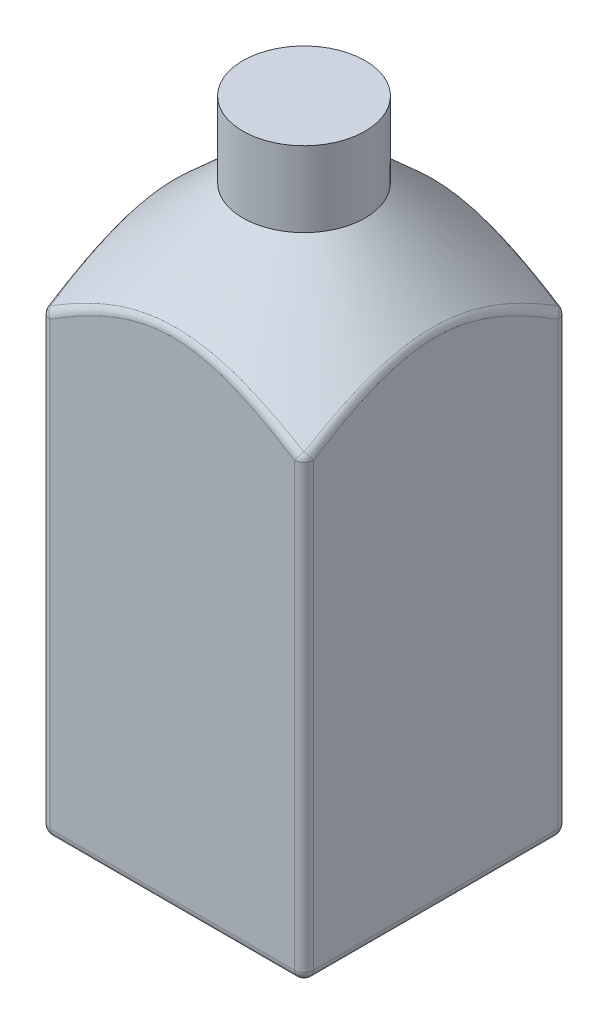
ISO-10303-21;
HEADER;
FILE_DESCRIPTION(('STEP AP214'),'2;1');
FILE_NAME('part.step','',(''),(''),'','','');
FILE_SCHEMA(('AUTOMOTIVE_DESIGN { 1 0 10303 214 1 1 1 1 }'));
ENDSEC;
DATA;
#1=APPLICATION_CONTEXT('core data for automotive mechanical design processes');
#2=APPLICATION_PROTOCOL_DEFINITION('international standard','automotive_design',2000,#1);
#3=PRODUCT_CONTEXT('',#1,'mechanical');
#4=PRODUCT('Part','Part','',(#3));
#5=PRODUCT_RELATED_PRODUCT_CATEGORY('part','',(#4));
#6=PRODUCT_DEFINITION_FORMATION('','',#4);
#7=PRODUCT_DEFINITION_CONTEXT('part definition',#1,'design');
#8=PRODUCT_DEFINITION('design','',#6,#7);
#9=PRODUCT_DEFINITION_SHAPE('','',#8);
#10=(LENGTH_UNIT() NAMED_UNIT(*) SI_UNIT(.MILLI.,.METRE.));
#11=(NAMED_UNIT(*) PLANE_ANGLE_UNIT() SI_UNIT($,.RADIAN.));
#12=(NAMED_UNIT(*) SI_UNIT($,.STERADIAN.) SOLID_ANGLE_UNIT());
#13=UNCERTAINTY_MEASURE_WITH_UNIT(LENGTH_MEASURE(1.E-05),#10,'distance_accuracy_value','');
#14=(GEOMETRIC_REPRESENTATION_CONTEXT(3) GLOBAL_UNCERTAINTY_ASSIGNED_CONTEXT((#13)) GLOBAL_UNIT_ASSIGNED_CONTEXT((#10,
#11,#12)) REPRESENTATION_CONTEXT('',''));
#15=CARTESIAN_POINT('',(0.,0.,0.));
#16=DIRECTION('',(0.,0.,1.));
#17=DIRECTION('',(1.,0.,0.));
#18=AXIS2_PLACEMENT_3D('',#15,#16,#17);
#19=CARTESIAN_POINT('',(0.,190.5,0.));
#20=DIRECTION('',(0.,-1.,0.));
#21=DIRECTION('',(0.,0.,-1.));
#22=AXIS2_PLACEMENT_3D('',#19,#20,#21);
#23=CONICAL_SURFACE('',#22,20.6375,0.83658680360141);
#24=CARTESIAN_POINT('',(42.6301170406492,149.026118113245,-51.1563872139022));
#25=CARTESIAN_POINT('',(44.4432875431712,148.318614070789,-50.6658450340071));
#26=CARTESIAN_POINT('',(44.4432875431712,146.669123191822,-49.5221839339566));
#27=CARTESIAN_POINT('',(42.6413221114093,149.504825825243,-50.4565960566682));
#28=CARTESIAN_POINT('',(44.4432875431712,148.792661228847,-49.9668941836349));
#29=CARTESIAN_POINT('',(44.4432875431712,147.147830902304,-48.8317316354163));
#30=CARTESIAN_POINT('',(42.6527396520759,149.980779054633,-49.7545270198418));
#31=CARTESIAN_POINT('',(44.4432875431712,149.264482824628,-49.2649657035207));
#32=CARTESIAN_POINT('',(44.4432875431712,147.623784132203,-48.1393708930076));
#33=CARTESIAN_POINT('',(42.6760060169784,150.926580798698,-48.3453875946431));
#34=CARTESIAN_POINT('',(44.4432875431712,150.201953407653,-47.8563311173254));
#35=CARTESIAN_POINT('',(44.4432875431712,148.569585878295,-46.7504684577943));
#36=CARTESIAN_POINT('',(42.6878548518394,151.39642916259,-47.6383170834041));
#37=CARTESIAN_POINT('',(44.4432875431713,150.667578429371,-47.1496963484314));
#38=CARTESIAN_POINT('',(44.4432875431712,149.039434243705,-46.0539266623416));
#39=CARTESIAN_POINT('',(42.7240653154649,152.796210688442,-45.5084959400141));
#40=CARTESIAN_POINT('',(44.4432875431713,152.052782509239,-45.0243681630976));
#41=CARTESIAN_POINT('',(44.4432875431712,150.439215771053,-43.957051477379));
#42=CARTESIAN_POINT('',(42.7490831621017,153.716048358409,-44.0776190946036));
#43=CARTESIAN_POINT('',(44.4432875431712,152.963866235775,-43.5956022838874));
#44=CARTESIAN_POINT('',(44.4432875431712,151.359053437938,-42.5499453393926));
#45=CARTESIAN_POINT('',(42.8011712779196,155.534029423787,-41.1719698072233));
#46=CARTESIAN_POINT('',(44.4432875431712,154.764017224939,-40.6955161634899));
#47=CARTESIAN_POINT('',(44.4432875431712,153.177034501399,-39.6965556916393));
#48=CARTESIAN_POINT('',(42.8282635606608,156.431749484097,-39.6968707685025));
#49=CARTESIAN_POINT('',(44.4432875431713,155.652615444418,-39.2243980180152));
#50=CARTESIAN_POINT('',(44.4432875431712,154.07475456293,-38.2500016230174));
#51=CARTESIAN_POINT('',(42.8840449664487,158.184621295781,-36.7157185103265));
#52=CARTESIAN_POINT('',(44.4432875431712,157.387104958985,-36.2530229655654));
#53=CARTESIAN_POINT('',(44.4432875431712,155.827626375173,-35.3314188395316));
#54=CARTESIAN_POINT('',(42.912733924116,159.039777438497,-35.2096685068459));
#55=CARTESIAN_POINT('',(44.4432875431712,158.233003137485,-34.7533602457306));
#56=CARTESIAN_POINT('',(44.4432875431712,156.68278251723,-33.8593927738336));
#57=CARTESIAN_POINT('',(42.9726310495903,160.733776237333,-32.0922698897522));
#58=CARTESIAN_POINT('',(44.4432875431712,159.907734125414,-31.6520787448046));
#59=CARTESIAN_POINT('',(44.4432875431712,158.376781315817,-30.8183484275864));
#60=CARTESIAN_POINT('',(43.003894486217,161.570152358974,-30.4792328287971));
#61=CARTESIAN_POINT('',(44.4432875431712,160.734508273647,-30.0490212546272));
#62=CARTESIAN_POINT('',(44.4432875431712,159.213157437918,-29.247946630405));
#63=CARTESIAN_POINT('',(43.0668584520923,163.167719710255,-27.2058603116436));
#64=CARTESIAN_POINT('',(44.4432875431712,162.312806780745,-26.7994982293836));
#65=CARTESIAN_POINT('',(44.4432875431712,160.810724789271,-26.0685210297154));
#66=CARTESIAN_POINT('',(43.0985590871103,163.928892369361,-25.5455133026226));
#67=CARTESIAN_POINT('',(44.4432875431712,163.064771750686,-25.1533327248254));
#68=CARTESIAN_POINT('',(44.4432875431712,161.57189744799,-24.4594878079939));
#69=CARTESIAN_POINT('',(43.1607051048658,165.349939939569,-22.1803783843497));
#70=CARTESIAN_POINT('',(44.4432875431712,164.467525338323,-21.8216060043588));
#71=CARTESIAN_POINT('',(44.4432875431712,162.992945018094,-21.2066986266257));
#72=CARTESIAN_POINT('',(43.191156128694,166.01031808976,-20.4758645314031));
#73=CARTESIAN_POINT('',(44.4432875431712,165.11957692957,-20.1361846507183));
#74=CARTESIAN_POINT('',(44.4432875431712,163.653323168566,-19.5631651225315));
#75=CARTESIAN_POINT('',(43.2486573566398,167.206457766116,-17.0120435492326));
#76=CARTESIAN_POINT('',(44.4432875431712,166.299352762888,-16.7168950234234));
#77=CARTESIAN_POINT('',(44.4432875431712,164.849462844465,-16.2319553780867));
#78=CARTESIAN_POINT('',(43.2757101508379,167.742314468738,-15.2527794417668));
#79=CARTESIAN_POINT('',(44.4432875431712,166.828273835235,-14.9821480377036));
#80=CARTESIAN_POINT('',(44.4432875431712,165.385319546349,-14.5443139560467));
#81=CARTESIAN_POINT('',(43.3185688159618,168.565434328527,-12.0438531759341));
#82=CARTESIAN_POINT('',(44.4432875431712,167.639917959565,-11.8223725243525));
#83=CARTESIAN_POINT('',(44.4432875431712,166.208439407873,-11.4732127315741));
#84=CARTESIAN_POINT('',(43.3355429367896,168.881073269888,-10.6037538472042));
#85=CARTESIAN_POINT('',(44.4432875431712,167.951250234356,-10.4059002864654));
#86=CARTESIAN_POINT('',(44.4432875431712,166.524078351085,-10.0974695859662));
#87=CARTESIAN_POINT('',(43.3567417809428,169.268767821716,-8.42367608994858));
#88=CARTESIAN_POINT('',(44.4432875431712,168.333462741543,-8.26308996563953));
#89=CARTESIAN_POINT('',(44.4432875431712,166.911772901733,-8.01780058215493));
#90=CARTESIAN_POINT('',(43.3630986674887,169.383722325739,-7.69348773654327));
#91=CARTESIAN_POINT('',(44.4432875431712,168.446736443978,-7.54607082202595));
#92=CARTESIAN_POINT('',(44.4432875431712,167.026727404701,-7.32173605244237));
#93=CARTESIAN_POINT('',(43.3742190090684,169.583446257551,-6.22769773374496));
#94=CARTESIAN_POINT('',(44.4432875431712,168.643469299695,-6.10743767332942));
#95=CARTESIAN_POINT('',(44.4432875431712,167.226451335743,-5.92523769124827));
#96=CARTESIAN_POINT('',(43.3789824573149,169.668215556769,-5.49209606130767));
#97=CARTESIAN_POINT('',(44.4432875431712,168.726989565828,-5.38561023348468));
#98=CARTESIAN_POINT('',(44.4432875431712,167.311220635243,-5.22480384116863));
#99=CARTESIAN_POINT('',(43.3867140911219,169.805214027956,-4.02823141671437));
#100=CARTESIAN_POINT('',(44.4432875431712,168.861920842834,-3.94973741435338));
#101=CARTESIAN_POINT('',(44.4432875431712,167.448219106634,-3.83148516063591));
#102=CARTESIAN_POINT('',(43.3897084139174,169.857917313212,-3.30002639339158));
#103=CARTESIAN_POINT('',(44.4432875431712,168.913842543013,-3.23552130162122));
#104=CARTESIAN_POINT('',(44.4432875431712,167.500922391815,-3.13864699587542));
#105=CARTESIAN_POINT('',(43.3939229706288,169.931969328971,-1.84153164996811));
#106=CARTESIAN_POINT('',(44.4432875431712,168.986770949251,-1.80547765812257));
#107=CARTESIAN_POINT('',(44.4432875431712,167.574974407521,-1.75129117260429));
#108=CARTESIAN_POINT('',(43.3951432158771,169.953318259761,-1.11124194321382));
#109=CARTESIAN_POINT('',(44.4432875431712,169.007802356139,-1.08941131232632));
#110=CARTESIAN_POINT('',(44.4432875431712,167.596323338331,-1.05677352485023));
#111=CARTESIAN_POINT('',(43.395771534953,169.964320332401,0.349620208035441));
#112=CARTESIAN_POINT('',(44.4432875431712,169.018637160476,0.342724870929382));
#113=CARTESIAN_POINT('',(44.4432875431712,167.607325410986,0.332485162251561));
#114=CARTESIAN_POINT('',(43.3951796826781,169.953974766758,1.08019263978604));
#115=CARTESIAN_POINT('',(44.4432875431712,169.008445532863,1.05903939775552));
#116=CARTESIAN_POINT('',(44.4432875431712,167.596979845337,1.02722619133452));
#117=CARTESIAN_POINT('',(43.3922025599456,169.901757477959,2.53985750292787));
#118=CARTESIAN_POINT('',(44.4432875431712,168.957021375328,2.49011296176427));
#119=CARTESIAN_POINT('',(44.4432875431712,167.544762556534,2.41551551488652));
#120=CARTESIAN_POINT('',(43.3898172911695,169.859885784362,3.26894993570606));
#121=CARTESIAN_POINT('',(44.4432875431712,168.915771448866,3.20511381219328));
#122=CARTESIAN_POINT('',(44.4432875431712,167.502890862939,3.10906381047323));
#123=CARTESIAN_POINT('',(43.3834024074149,169.746614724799,4.70685782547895));
#124=CARTESIAN_POINT('',(44.4432875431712,168.804214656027,4.61528277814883));
#125=CARTESIAN_POINT('',(44.4432875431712,167.389619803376,4.47733043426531));
#126=CARTESIAN_POINT('',(43.3794127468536,169.67593229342,5.41574718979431));
#127=CARTESIAN_POINT('',(44.4432875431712,168.734577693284,5.31074935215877));
#128=CARTESIAN_POINT('',(44.4432875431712,167.318937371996,5.1521082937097));
#129=CARTESIAN_POINT('',(43.3699056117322,169.50615312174,6.8291022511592));
#130=CARTESIAN_POINT('',(44.4432875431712,168.567349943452,6.69756463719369));
#131=CARTESIAN_POINT('',(44.4432875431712,167.14915820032,6.49810353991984));
#132=CARTESIAN_POINT('',(43.3643879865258,169.407053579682,7.53356750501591));
#133=CARTESIAN_POINT('',(44.4432875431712,168.469706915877,7.38911069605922));
#134=CARTESIAN_POINT('',(44.4432875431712,167.050058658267,7.1693205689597));
#135=CARTESIAN_POINT('',(43.3457557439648,169.069068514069,9.63834354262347));
#136=CARTESIAN_POINT('',(44.4432875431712,168.136552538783,9.4570029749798));
#137=CARTESIAN_POINT('',(44.4432875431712,166.712073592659,9.17601878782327));
#138=CARTESIAN_POINT('',(43.3305605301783,168.789475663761,11.0302896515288));
#139=CARTESIAN_POINT('',(44.4432875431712,167.860810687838,10.8254769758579));
#140=CARTESIAN_POINT('',(44.4432875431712,166.432480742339,10.5047896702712));
#141=CARTESIAN_POINT('',(43.2957356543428,168.129631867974,13.807024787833));
#142=CARTESIAN_POINT('',(44.4432875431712,167.210524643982,13.5570334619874));
#143=CARTESIAN_POINT('',(44.4432875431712,165.77263694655,13.1599282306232));
#144=CARTESIAN_POINT('',(43.2760370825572,167.747799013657,15.1913184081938));
#145=CARTESIAN_POINT('',(44.4432875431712,166.833848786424,14.9206336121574));
#146=CARTESIAN_POINT('',(44.4432875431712,165.390804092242,14.4858959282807));
#147=CARTESIAN_POINT('',(43.2443986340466,167.112693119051,17.2422806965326));
#148=CARTESIAN_POINT('',(44.4432875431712,166.208262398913,16.9406138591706));
#149=CARTESIAN_POINT('',(44.4432875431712,164.755698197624,16.4542096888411));
#150=CARTESIAN_POINT('',(43.2335046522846,166.890611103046,17.9216549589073));
#151=CARTESIAN_POINT('',(44.4432875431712,165.989225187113,17.6108225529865));
#152=CARTESIAN_POINT('',(44.4432875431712,164.53361618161,17.1068423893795));
#153=CARTESIAN_POINT('',(43.2111829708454,166.427430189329,19.2720282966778));
#154=CARTESIAN_POINT('',(44.4432875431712,165.532393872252,18.9436952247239));
#155=CARTESIAN_POINT('',(44.4432875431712,164.070435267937,18.4053367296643));
#156=CARTESIAN_POINT('',(43.1997552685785,166.186331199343,19.9430273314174));
#157=CARTESIAN_POINT('',(44.4432875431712,165.294533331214,19.6064169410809));
#158=CARTESIAN_POINT('',(44.4432875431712,163.829336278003,19.0511983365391));
#159=CARTESIAN_POINT('',(43.1693782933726,165.533327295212,21.6866491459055));
#160=CARTESIAN_POINT('',(44.4432875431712,164.649836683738,21.3306636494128));
#161=CARTESIAN_POINT('',(44.4432875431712,163.176332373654,20.7311634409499));
#162=CARTESIAN_POINT('',(43.1501235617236,165.107529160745,22.7526074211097));
#163=CARTESIAN_POINT('',(44.4432875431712,164.229534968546,22.385094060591));
#164=CARTESIAN_POINT('',(44.4432875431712,162.750534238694,21.7598750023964));
#165=CARTESIAN_POINT('',(43.1111597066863,164.217451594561,24.8639177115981));
#166=CARTESIAN_POINT('',(44.4432875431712,163.350943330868,24.4753326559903));
#167=CARTESIAN_POINT('',(44.4432875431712,161.860456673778,23.8005983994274));
#168=CARTESIAN_POINT('',(43.09145050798,163.753165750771,25.9092662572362));
#169=CARTESIAN_POINT('',(44.4432875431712,162.892450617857,25.5111817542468));
#170=CARTESIAN_POINT('',(44.4432875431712,161.396170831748,24.8126074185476));
#171=CARTESIAN_POINT('',(43.0519769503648,162.791551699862,27.981338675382));
#172=CARTESIAN_POINT('',(44.4432875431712,161.942749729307,27.5661135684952));
#173=CARTESIAN_POINT('',(44.4432875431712,160.434556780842,26.8215809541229));
#174=CARTESIAN_POINT('',(43.0322125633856,162.294201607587,29.0080496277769));
#175=CARTESIAN_POINT('',(44.4432875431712,161.451376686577,28.5851454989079));
#176=CARTESIAN_POINT('',(44.4432875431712,159.937206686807,27.8185349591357));
#177=CARTESIAN_POINT('',(42.9929445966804,161.271629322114,31.0436991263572));
#178=CARTESIAN_POINT('',(44.4432875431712,160.440942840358,30.6071319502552));
#179=CARTESIAN_POINT('',(44.4432875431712,158.914634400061,29.7979325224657));
#180=CARTESIAN_POINT('',(42.9734410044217,160.746408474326,32.0526385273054));
#181=CARTESIAN_POINT('',(44.4432875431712,159.921786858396,31.6099939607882));
#182=CARTESIAN_POINT('',(44.4432875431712,158.389413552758,30.7803767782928));
#183=CARTESIAN_POINT('',(42.9348226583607,159.669865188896,34.0587350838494));
#184=CARTESIAN_POINT('',(44.4432875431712,158.857460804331,33.6054426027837));
#185=CARTESIAN_POINT('',(44.4432875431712,157.312870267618,32.7362876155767));
#186=CARTESIAN_POINT('',(42.9157099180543,159.118440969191,35.0558236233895));
#187=CARTESIAN_POINT('',(44.4432875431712,158.312142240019,34.5978177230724));
#188=CARTESIAN_POINT('',(44.4432875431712,156.761446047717,33.7096980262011));
#189=CARTESIAN_POINT('',(42.8781016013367,157.995028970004,37.0354471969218));
#190=CARTESIAN_POINT('',(44.4432875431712,157.200922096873,36.5693572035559));
#191=CARTESIAN_POINT('',(44.4432875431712,155.638034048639,35.644565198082));
#192=CARTESIAN_POINT('',(42.8596060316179,157.423040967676,38.0179820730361));
#193=CARTESIAN_POINT('',(44.4432875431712,156.634998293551,37.5483650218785));
#194=CARTESIAN_POINT('',(44.4432875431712,155.066046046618,36.606021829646));
#195=CARTESIAN_POINT('',(42.8233262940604,156.261580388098,39.9696871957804));
#196=CARTESIAN_POINT('',(44.4432875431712,155.485576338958,39.4941862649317));
#197=CARTESIAN_POINT('',(44.4432875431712,153.904585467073,38.517867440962));
#198=CARTESIAN_POINT('',(42.8055418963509,155.672113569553,40.9388616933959));
#199=CARTESIAN_POINT('',(44.4432875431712,154.902088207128,40.4608356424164));
#200=CARTESIAN_POINT('',(44.4432875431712,153.315118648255,39.4682599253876));
#201=CARTESIAN_POINT('',(42.7707255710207,154.477916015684,42.8655320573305));
#202=CARTESIAN_POINT('',(44.4432875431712,153.719705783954,42.3834681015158));
#203=CARTESIAN_POINT('',(44.4432875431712,152.12092109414,41.3593788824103));
#204=CARTESIAN_POINT('',(42.7536936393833,153.873185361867,43.8230279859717));
#205=CARTESIAN_POINT('',(44.4432875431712,153.120837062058,43.3392768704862));
#206=CARTESIAN_POINT('',(44.4432875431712,151.51619044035,42.3001054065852));
#207=CARTESIAN_POINT('',(42.7061535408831,152.127118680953,46.5429127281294));
#208=CARTESIAN_POINT('',(44.4432875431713,151.388605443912,46.0597718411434));
#209=CARTESIAN_POINT('',(44.4432875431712,149.770123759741,44.9746095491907));
#210=CARTESIAN_POINT('',(42.6765914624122,150.969614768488,48.2926004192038));
#211=CARTESIAN_POINT('',(44.4432875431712,150.241725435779,47.8077950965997));
#212=CARTESIAN_POINT('',(44.4432875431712,148.61261984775,46.6978389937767));
#213=CARTESIAN_POINT('',(42.6200893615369,148.6191330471,51.7629652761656));
#214=CARTESIAN_POINT('',(44.4432875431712,147.911590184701,51.2776026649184));
#215=CARTESIAN_POINT('',(44.4432875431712,146.26213812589,50.1200398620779));
#216=CARTESIAN_POINT('',(42.5931495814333,147.426151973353,53.4836397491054));
#217=CARTESIAN_POINT('',(44.4432875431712,146.728713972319,52.9983133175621));
#218=CARTESIAN_POINT('',(44.4432875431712,145.069157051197,51.8190090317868));
#219=CARTESIAN_POINT('',(42.5419802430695,145.024086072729,56.8842102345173));
#220=CARTESIAN_POINT('',(44.4432875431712,144.3458238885,56.4010274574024));
#221=CARTESIAN_POINT('',(44.4432875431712,142.667091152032,55.1801152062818));
#222=CARTESIAN_POINT('',(42.5177264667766,143.815278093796,58.5643413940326));
#223=CARTESIAN_POINT('',(44.4432875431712,143.146451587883,58.0823817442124));
#224=CARTESIAN_POINT('',(44.4432875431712,141.458283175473,56.8424503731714));
#225=CARTESIAN_POINT('',(42.4829994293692,141.985578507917,61.0698531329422));
#226=CARTESIAN_POINT('',(44.4432875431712,141.332546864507,60.5876715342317));
#227=CARTESIAN_POINT('',(44.4432875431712,139.628583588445,59.3234643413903));
#228=CARTESIAN_POINT('',(42.4717005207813,141.372999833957,61.9024843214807));
#229=CARTESIAN_POINT('',(44.4432875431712,140.724394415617,61.4213717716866));
#230=CARTESIAN_POINT('',(44.4432875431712,139.016004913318,60.1482963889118));
#231=CARTESIAN_POINT('',(42.449625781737,140.142824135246,63.5633232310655));
#232=CARTESIAN_POINT('',(44.4432875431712,139.502878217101,63.0846057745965));
#233=CARTESIAN_POINT('',(44.4432875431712,137.785829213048,61.7941943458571));
#234=CARTESIAN_POINT('',(42.4388499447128,139.525227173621,64.3915310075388));
#235=CARTESIAN_POINT('',(44.4432875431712,138.889568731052,63.9140372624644));
#236=CARTESIAN_POINT('',(44.4432875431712,137.168232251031,62.615260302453));
#237=CARTESIAN_POINT('',(42.4283219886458,138.905373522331,65.2177412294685));
#238=CARTESIAN_POINT('',(44.4432875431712,138.274652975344,64.7405866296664));
#239=CARTESIAN_POINT('',(44.4432875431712,136.548378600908,63.4346203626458));
#240=(BOUNDED_SURFACE() B_SPLINE_SURFACE(3,2,((#24,#25,#26),(#27,#28,#29),(#30,#31,#32),(#33,
#34,#35),(#36,#37,#38),(#39,#40,#41),(#42,#43,#44),(#45,#46,#47),(#48,#49,#50),(#51,#52,#53),
(#54,#55,#56),(#57,#58,#59),(#60,#61,#62),(#63,#64,#65),(#66,#67,#68),(#69,#70,#71),(#72,#73,
#74),(#75,#76,#77),(#78,#79,#80),(#81,#82,#83),(#84,#85,#86),(#87,#88,#89),(#90,#91,#92),(#93,
#94,#95),(#96,#97,#98),(#99,#100,#101),(#102,#103,#104),(#105,#106,#107),(#108,#109,#110),(#111,
#112,#113),(#114,#115,#116),(#117,#118,#119),(#120,#121,#122),(#123,#124,#125),(#126,#127,#128),
(#129,#130,#131),(#132,#133,#134),(#135,#136,#137),(#138,#139,#140),(#141,#142,#143),(#144,#145,
#146),(#147,#148,#149),(#150,#151,#152),(#153,#154,#155),(#156,#157,#158),(#159,#160,#161),
(#162,#163,#164),(#165,#166,#167),(#168,#169,#170),(#171,#172,#173),(#174,#175,#176),(#177,#178,
#179),(#180,#181,#182),(#183,#184,#185),(#186,#187,#188),(#189,#190,#191),(#192,#193,#194),
(#195,#196,#197),(#198,#199,#200),(#201,#202,#203),(#204,#205,#206),(#207,#208,#209),(#210,#211,
#212),(#213,#214,#215),(#216,#217,#218),(#219,#220,#221),(#222,#223,#224),(#225,#226,#227),
(#228,#229,#230),(#231,#232,#233),(#234,#235,#236),(#237,#238,#239)),.UNSPECIFIED.,.F.,.F.,
.F.) B_SPLINE_SURFACE_WITH_KNOTS((4,2,2,2,2,2,2,2,2,2,2,2,2,2,2,2,2,2,2,2,2,2,2,2,2,2,2,2,2,2,2,
2,2,2,2,4),(3,3),(0.,2.52049743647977,5.04105700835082,10.0839193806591,15.1907653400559,
20.2970833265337,25.6332259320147,30.9706829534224,36.2805524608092,41.5863499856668,
45.8161925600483,47.9321106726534,50.0480377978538,52.131867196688,54.2156832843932,
56.2994143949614,58.3831435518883,60.4179109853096,62.4528791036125,66.52208723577,
70.6583113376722,72.7262157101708,74.7941301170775,78.1331990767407,81.4728254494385,
84.8146847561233,88.1563828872,91.5123353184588,94.8683241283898,98.2232192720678,
101.578096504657,107.805141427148,114.032761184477,120.198649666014,123.280907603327,
126.363126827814),(0.,1.),
.UNSPECIFIED.) GEOMETRIC_REPRESENTATION_ITEM() RATIONAL_B_SPLINE_SURFACE(((1.,0.845258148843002,
1.),(1.,0.846301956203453,1.),(1.,0.84736362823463,1.),(1.,0.849522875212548,1.),(1.,
0.850620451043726,1.),(1.,0.853967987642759,1.),(1.,0.856272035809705,1.),(1.,0.861048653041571,
1.),(1.,0.863522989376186,1.),(1.,0.868594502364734,1.),(1.,0.871191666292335,1.),(1.,
0.876588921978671,1.),(1.,0.879392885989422,1.),(1.,0.885012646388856,1.),(1.,0.887828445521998,
1.),(1.,0.893323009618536,1.),(1.,0.896002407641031,1.),(1.,0.901041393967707,1.),(1.,
0.903401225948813,1.),(1.,0.907128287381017,1.),(1.,0.908599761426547,1.),(1.,0.910434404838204,
1.),(1.,0.910983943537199,1.),(1.,0.911944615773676,1.),(1.,0.912355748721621,1.),(1.,
0.913022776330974,1.),(1.,0.913280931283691,1.),(1.,0.913644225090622,1.),(1.,0.913749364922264,
1.),(1.,0.913803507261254,1.),(1.,0.913752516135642,1.),(1.,0.913495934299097,1.),(1.,
0.913290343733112,1.),(1.,0.912737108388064,1.),(1.,0.912392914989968,1.),(1.,0.911572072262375,
1.),(1.,0.911095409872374,1.),(1.,0.909484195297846,1.),(1.,0.908168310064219,1.),(1.,
0.905143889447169,1.),(1.,0.903429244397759,1.),(1.,0.900666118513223,1.),(1.,0.899713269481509,
1.),(1.,0.897757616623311,1.),(1.,0.896754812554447,1.),(1.,0.894084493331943,1.),(1.,
0.892387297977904,1.),(1.,0.888942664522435,1.),(1.,0.887195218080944,1.),(1.,0.883684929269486,
1.),(1.,0.88192207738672,1.),(1.,0.878409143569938,1.),(1.,0.876659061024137,1.),(1.,
0.873183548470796,1.),(1.,0.871458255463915,1.),(1.,0.868053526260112,1.),(1.,0.866374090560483,
1.),(1.,0.863070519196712,1.),(1.,0.86144636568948,1.),(1.,0.858258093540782,1.),(1.,
0.856693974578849,1.),(1.,0.852316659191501,1.),(1.,0.849580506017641,1.),(1.,0.844327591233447,
1.),(1.,0.841810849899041,1.),(1.,0.837010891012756,1.),(1.,0.834725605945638,1.),(1.,
0.831441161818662,1.),(1.,0.830370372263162,1.),(1.,0.828274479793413,1.),(1.,0.827249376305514,
1.),(1.,0.826246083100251,1.))) REPRESENTATION_ITEM('') SURFACE());
#241=CARTESIAN_POINT('',(42.4283219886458,138.905373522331,65.2177412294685));
#242=CARTESIAN_POINT('',(42.4388499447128,139.525227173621,64.3915310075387));
#243=CARTESIAN_POINT('',(42.449625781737,140.142824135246,63.5633232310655));
#244=CARTESIAN_POINT('',(42.4717005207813,141.372999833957,61.9024843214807));
#245=CARTESIAN_POINT('',(42.4829994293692,141.985578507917,61.0698531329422));
#246=CARTESIAN_POINT('',(42.5177264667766,143.815278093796,58.5643413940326));
#247=CARTESIAN_POINT('',(42.5419802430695,145.024086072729,56.8842102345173));
#248=CARTESIAN_POINT('',(42.5931495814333,147.426151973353,53.4836397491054));
#249=CARTESIAN_POINT('',(42.6200893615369,148.6191330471,51.7629652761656));
#250=CARTESIAN_POINT('',(42.6765914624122,150.969614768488,48.2926004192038));
#251=CARTESIAN_POINT('',(42.7061535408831,152.127118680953,46.5429127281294));
#252=CARTESIAN_POINT('',(42.7536936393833,153.873185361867,43.8230279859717));
#253=CARTESIAN_POINT('',(42.7707255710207,154.477916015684,42.8655320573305));
#254=CARTESIAN_POINT('',(42.8055418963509,155.672113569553,40.9388616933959));
#255=CARTESIAN_POINT('',(42.8233262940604,156.261580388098,39.9696871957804));
#256=CARTESIAN_POINT('',(42.8596060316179,157.423040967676,38.0179820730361));
#257=CARTESIAN_POINT('',(42.8781016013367,157.995028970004,37.0354471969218));
#258=CARTESIAN_POINT('',(42.9157099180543,159.118440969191,35.0558236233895));
#259=CARTESIAN_POINT('',(42.9348226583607,159.669865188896,34.0587350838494));
#260=CARTESIAN_POINT('',(42.9734410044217,160.746408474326,32.0526385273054));
#261=CARTESIAN_POINT('',(42.9929445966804,161.271629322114,31.0436991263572));
#262=CARTESIAN_POINT('',(43.0322125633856,162.294201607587,29.0080496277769));
#263=CARTESIAN_POINT('',(43.0519769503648,162.791551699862,27.981338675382));
#264=CARTESIAN_POINT('',(43.09145050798,163.753165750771,25.9092662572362));
#265=CARTESIAN_POINT('',(43.1111597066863,164.217451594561,24.8639177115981));
#266=CARTESIAN_POINT('',(43.1501235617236,165.107529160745,22.7526074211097));
#267=CARTESIAN_POINT('',(43.1693782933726,165.533327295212,21.6866491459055));
#268=CARTESIAN_POINT('',(43.1997552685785,166.186331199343,19.9430273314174));
#269=CARTESIAN_POINT('',(43.2111829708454,166.427430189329,19.2720282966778));
#270=CARTESIAN_POINT('',(43.2335046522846,166.890611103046,17.9216549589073));
#271=CARTESIAN_POINT('',(43.2443986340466,167.112693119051,17.2422806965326));
#272=CARTESIAN_POINT('',(43.2760370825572,167.747799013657,15.1913184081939));
#273=CARTESIAN_POINT('',(43.2957356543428,168.129631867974,13.807024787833));
#274=CARTESIAN_POINT('',(43.3305605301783,168.789475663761,11.0302896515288));
#275=CARTESIAN_POINT('',(43.3457557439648,169.069068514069,9.63834354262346));
#276=CARTESIAN_POINT('',(43.3643879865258,169.407053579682,7.53356750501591));
#277=CARTESIAN_POINT('',(43.3699056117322,169.506153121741,6.8291022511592));
#278=CARTESIAN_POINT('',(43.3794127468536,169.67593229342,5.41574718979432));
#279=CARTESIAN_POINT('',(43.3834024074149,169.746614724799,4.70685782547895));
#280=CARTESIAN_POINT('',(43.3898172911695,169.859885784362,3.26894993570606));
#281=CARTESIAN_POINT('',(43.3922025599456,169.901757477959,2.53985750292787));
#282=CARTESIAN_POINT('',(43.3951796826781,169.953974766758,1.08019263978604));
#283=CARTESIAN_POINT('',(43.395771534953,169.964320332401,0.349620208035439));
#284=CARTESIAN_POINT('',(43.3951432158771,169.953318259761,-1.11124194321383));
#285=CARTESIAN_POINT('',(43.3939229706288,169.931969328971,-1.84153164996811));
#286=CARTESIAN_POINT('',(43.3897084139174,169.857917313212,-3.30002639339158));
#287=CARTESIAN_POINT('',(43.3867140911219,169.805214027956,-4.02823141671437));
#288=CARTESIAN_POINT('',(43.3789824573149,169.668215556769,-5.49209606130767));
#289=CARTESIAN_POINT('',(43.3742190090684,169.583446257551,-6.22769773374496));
#290=CARTESIAN_POINT('',(43.3630986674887,169.383722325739,-7.69348773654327));
#291=CARTESIAN_POINT('',(43.3567417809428,169.268767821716,-8.42367608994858));
#292=CARTESIAN_POINT('',(43.3355429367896,168.881073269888,-10.6037538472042));
#293=CARTESIAN_POINT('',(43.3185688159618,168.565434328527,-12.043853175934));
#294=CARTESIAN_POINT('',(43.2757101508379,167.742314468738,-15.2527794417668));
#295=CARTESIAN_POINT('',(43.2486573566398,167.206457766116,-17.0120435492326));
#296=CARTESIAN_POINT('',(43.191156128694,166.01031808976,-20.4758645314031));
#297=CARTESIAN_POINT('',(43.1607051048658,165.349939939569,-22.1803783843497));
#298=CARTESIAN_POINT('',(43.0985590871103,163.928892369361,-25.5455133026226));
#299=CARTESIAN_POINT('',(43.0668584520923,163.167719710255,-27.2058603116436));
#300=CARTESIAN_POINT('',(43.003894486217,161.570152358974,-30.4792328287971));
#301=CARTESIAN_POINT('',(42.9726310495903,160.733776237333,-32.0922698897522));
#302=CARTESIAN_POINT('',(42.912733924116,159.039777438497,-35.2096685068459));
#303=CARTESIAN_POINT('',(42.8840449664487,158.184621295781,-36.7157185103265));
#304=CARTESIAN_POINT('',(42.8282635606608,156.431749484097,-39.6968707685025));
#305=CARTESIAN_POINT('',(42.8011712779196,155.534029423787,-41.1719698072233));
#306=CARTESIAN_POINT('',(42.7490831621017,153.716048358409,-44.0776190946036));
#307=CARTESIAN_POINT('',(42.7240653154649,152.796210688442,-45.5084959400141));
#308=CARTESIAN_POINT('',(42.6878548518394,151.39642916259,-47.6383170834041));
#309=CARTESIAN_POINT('',(42.6760060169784,150.926580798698,-48.3453875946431));
#310=CARTESIAN_POINT('',(42.6527396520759,149.980779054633,-49.7545270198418));
#311=CARTESIAN_POINT('',(42.6413221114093,149.504825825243,-50.4565960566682));
#312=CARTESIAN_POINT('',(42.6301170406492,149.026118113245,-51.1563872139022));
#313=B_SPLINE_CURVE_WITH_KNOTS('',3,(#241,#242,#243,#244,#245,#246,#247,#248,#249,#250,#251,
#252,#253,#254,#255,#256,#257,#258,#259,#260,#261,#262,#263,#264,#265,#266,#267,#268,#269,#270,
#271,#272,#273,#274,#275,#276,#277,#278,#279,#280,#281,#282,#283,#284,#285,#286,#287,#288,#289,
#290,#291,#292,#293,#294,#295,#296,#297,#298,#299,#300,#301,#302,#303,#304,#305,#306,#307,#308,
#309,#310,#311,#312),.UNSPECIFIED.,.F.,.F.,(4,2,2,2,2,2,2,2,2,2,2,2,2,2,2,2,2,2,2,2,2,2,2,2,2,2,
2,2,2,2,2,2,2,2,2,4),(0.,3.08221922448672,6.16447716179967,12.3303656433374,18.5579854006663,
24.7850303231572,28.1399075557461,31.4948026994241,34.8507915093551,38.2067439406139,
41.5484420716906,44.8903013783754,48.2299277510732,51.5689967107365,53.6369111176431,
55.7048154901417,59.841039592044,63.9102477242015,65.9452158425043,67.9799832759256,
70.0637124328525,72.1474435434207,74.2312596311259,76.3150890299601,78.4310161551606,
80.5469342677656,84.7767768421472,90.0825743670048,95.3924438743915,100.729900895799,
106.06604350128,111.172361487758,116.279207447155,121.322069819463,123.842629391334,
126.363126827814),.UNSPECIFIED.);
#314=CARTESIAN_POINT('',(42.7724816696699,154.53255986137,42.7724816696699));
#315=VERTEX_POINT('',#314);
#316=CARTESIAN_POINT('',(42.7724816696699,154.53255986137,-42.7724816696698));
#317=VERTEX_POINT('',#316);
#318=EDGE_CURVE('E404',#315,#317,#313,.T.);
#319=ORIENTED_EDGE('',*,*,#318,.T.);
#320=CARTESIAN_POINT('',(-51.1563872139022,149.026118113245,-42.6301170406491));
#321=CARTESIAN_POINT('',(-50.6658450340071,148.318614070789,-44.4432875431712));
#322=CARTESIAN_POINT('',(-49.5221839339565,146.669123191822,-44.4432875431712));
#323=CARTESIAN_POINT('',(-50.4565960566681,149.504825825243,-42.6413221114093));
#324=CARTESIAN_POINT('',(-49.9668941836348,148.792661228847,-44.4432875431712));
#325=CARTESIAN_POINT('',(-48.8317316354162,147.147830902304,-44.4432875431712));
#326=CARTESIAN_POINT('',(-49.7545270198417,149.980779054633,-42.6527396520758));
#327=CARTESIAN_POINT('',(-49.2649657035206,149.264482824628,-44.4432875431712));
#328=CARTESIAN_POINT('',(-48.1393708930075,147.623784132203,-44.4432875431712));
#329=CARTESIAN_POINT('',(-48.345387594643,150.926580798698,-42.6760060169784));
#330=CARTESIAN_POINT('',(-47.8563311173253,150.201953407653,-44.4432875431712));
#331=CARTESIAN_POINT('',(-46.7504684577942,148.569585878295,-44.4432875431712));
#332=CARTESIAN_POINT('',(-47.638317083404,151.396429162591,-42.6878548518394));
#333=CARTESIAN_POINT('',(-47.1496963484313,150.667578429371,-44.4432875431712));
#334=CARTESIAN_POINT('',(-46.0539266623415,149.039434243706,-44.4432875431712));
#335=CARTESIAN_POINT('',(-45.508495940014,152.796210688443,-42.7240653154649));
#336=CARTESIAN_POINT('',(-45.0243681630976,152.052782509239,-44.4432875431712));
#337=CARTESIAN_POINT('',(-43.9570514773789,150.439215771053,-44.4432875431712));
#338=CARTESIAN_POINT('',(-44.0776190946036,153.716048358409,-42.7490831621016));
#339=CARTESIAN_POINT('',(-43.5956022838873,152.963866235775,-44.4432875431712));
#340=CARTESIAN_POINT('',(-42.5499453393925,151.359053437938,-44.4432875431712));
#341=CARTESIAN_POINT('',(-41.1719698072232,155.534029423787,-42.8011712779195));
#342=CARTESIAN_POINT('',(-40.6955161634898,154.764017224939,-44.4432875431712));
#343=CARTESIAN_POINT('',(-39.6965556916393,153.177034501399,-44.4432875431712));
#344=CARTESIAN_POINT('',(-39.6968707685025,156.431749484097,-42.8282635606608));
#345=CARTESIAN_POINT('',(-39.2243980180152,155.652615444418,-44.4432875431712));
#346=CARTESIAN_POINT('',(-38.2500016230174,154.07475456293,-44.4432875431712));
#347=CARTESIAN_POINT('',(-36.7157185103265,158.184621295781,-42.8840449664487));
#348=CARTESIAN_POINT('',(-36.2530229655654,157.387104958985,-44.4432875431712));
#349=CARTESIAN_POINT('',(-35.3314188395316,155.827626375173,-44.4432875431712));
#350=CARTESIAN_POINT('',(-35.209668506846,159.039777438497,-42.912733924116));
#351=CARTESIAN_POINT('',(-34.7533602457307,158.233003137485,-44.4432875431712));
#352=CARTESIAN_POINT('',(-33.8593927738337,156.68278251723,-44.4432875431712));
#353=CARTESIAN_POINT('',(-32.0922698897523,160.733776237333,-42.9726310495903));
#354=CARTESIAN_POINT('',(-31.6520787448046,159.907734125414,-44.4432875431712));
#355=CARTESIAN_POINT('',(-30.8183484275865,158.376781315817,-44.4432875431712));
#356=CARTESIAN_POINT('',(-30.4792328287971,161.570152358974,-43.0038944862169));
#357=CARTESIAN_POINT('',(-30.0490212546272,160.734508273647,-44.4432875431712));
#358=CARTESIAN_POINT('',(-29.2479466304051,159.213157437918,-44.4432875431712));
#359=CARTESIAN_POINT('',(-27.2058603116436,163.167719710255,-43.0668584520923));
#360=CARTESIAN_POINT('',(-26.7994982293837,162.312806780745,-44.4432875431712));
#361=CARTESIAN_POINT('',(-26.0685210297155,160.810724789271,-44.4432875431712));
#362=CARTESIAN_POINT('',(-25.5455133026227,163.928892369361,-43.0985590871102));
#363=CARTESIAN_POINT('',(-25.1533327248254,163.064771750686,-44.4432875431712));
#364=CARTESIAN_POINT('',(-24.459487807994,161.57189744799,-44.4432875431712));
#365=CARTESIAN_POINT('',(-22.1803783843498,165.349939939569,-43.1607051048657));
#366=CARTESIAN_POINT('',(-21.8216060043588,164.467525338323,-44.4432875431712));
#367=CARTESIAN_POINT('',(-21.2066986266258,162.992945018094,-44.4432875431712));
#368=CARTESIAN_POINT('',(-20.4758645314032,166.01031808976,-43.1911561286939));
#369=CARTESIAN_POINT('',(-20.1361846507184,165.11957692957,-44.4432875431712));
#370=CARTESIAN_POINT('',(-19.5631651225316,163.653323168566,-44.4432875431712));
#371=CARTESIAN_POINT('',(-17.0120435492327,167.206457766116,-43.2486573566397));
#372=CARTESIAN_POINT('',(-16.7168950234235,166.299352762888,-44.4432875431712));
#373=CARTESIAN_POINT('',(-16.2319553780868,164.849462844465,-44.4432875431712));
#374=CARTESIAN_POINT('',(-15.2527794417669,167.742314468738,-43.2757101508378));
#375=CARTESIAN_POINT('',(-14.9821480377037,166.828273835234,-44.4432875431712));
#376=CARTESIAN_POINT('',(-14.5443139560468,165.385319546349,-44.4432875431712));
#377=CARTESIAN_POINT('',(-12.0438531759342,168.565434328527,-43.3185688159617));
#378=CARTESIAN_POINT('',(-11.8223725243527,167.639917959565,-44.4432875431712));
#379=CARTESIAN_POINT('',(-11.4732127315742,166.208439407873,-44.4432875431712));
#380=CARTESIAN_POINT('',(-10.6037538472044,168.881073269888,-43.3355429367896));
#381=CARTESIAN_POINT('',(-10.4059002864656,167.951250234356,-44.4432875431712));
#382=CARTESIAN_POINT('',(-10.0974695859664,166.524078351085,-44.4432875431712));
#383=CARTESIAN_POINT('',(-8.42367608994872,169.268767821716,-43.3567417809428));
#384=CARTESIAN_POINT('',(-8.26308996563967,168.333462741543,-44.4432875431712));
#385=CARTESIAN_POINT('',(-8.01780058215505,166.911772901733,-44.4432875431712));
#386=CARTESIAN_POINT('',(-7.69348773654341,169.383722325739,-43.3630986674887));
#387=CARTESIAN_POINT('',(-7.54607082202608,168.446736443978,-44.4432875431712));
#388=CARTESIAN_POINT('',(-7.32173605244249,167.026727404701,-44.4432875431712));
#389=CARTESIAN_POINT('',(-6.22769773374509,169.583446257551,-43.3742190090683));
#390=CARTESIAN_POINT('',(-6.10743767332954,168.643469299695,-44.4432875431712));
#391=CARTESIAN_POINT('',(-5.92523769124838,167.226451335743,-44.4432875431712));
#392=CARTESIAN_POINT('',(-5.4920960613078,169.668215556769,-43.3789824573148));
#393=CARTESIAN_POINT('',(-5.38561023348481,168.726989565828,-44.4432875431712));
#394=CARTESIAN_POINT('',(-5.22480384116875,167.311220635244,-44.4432875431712));
#395=CARTESIAN_POINT('',(-4.0282314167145,169.805214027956,-43.3867140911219));
#396=CARTESIAN_POINT('',(-3.94973741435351,168.861920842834,-44.4432875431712));
#397=CARTESIAN_POINT('',(-3.83148516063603,167.448219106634,-44.4432875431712));
#398=CARTESIAN_POINT('',(-3.3000263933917,169.857917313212,-43.3897084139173));
#399=CARTESIAN_POINT('',(-3.23552130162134,168.913842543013,-44.4432875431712));
#400=CARTESIAN_POINT('',(-3.13864699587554,167.500922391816,-44.4432875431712));
#401=CARTESIAN_POINT('',(-1.84153164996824,169.931969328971,-43.3939229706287));
#402=CARTESIAN_POINT('',(-1.80547765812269,168.986770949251,-44.4432875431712));
#403=CARTESIAN_POINT('',(-1.75129117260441,167.574974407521,-44.4432875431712));
#404=CARTESIAN_POINT('',(-1.11124194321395,169.953318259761,-43.3951432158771));
#405=CARTESIAN_POINT('',(-1.08941131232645,169.007802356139,-44.4432875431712));
#406=CARTESIAN_POINT('',(-1.05677352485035,167.596323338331,-44.4432875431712));
#407=CARTESIAN_POINT('',(0.349620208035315,169.964320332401,-43.3957715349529));
#408=CARTESIAN_POINT('',(0.342724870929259,169.018637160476,-44.4432875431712));
#409=CARTESIAN_POINT('',(0.332485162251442,167.607325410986,-44.4432875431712));
#410=CARTESIAN_POINT('',(1.08019263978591,169.953974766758,-43.395179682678));
#411=CARTESIAN_POINT('',(1.0590393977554,169.008445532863,-44.4432875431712));
#412=CARTESIAN_POINT('',(1.0272261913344,167.596979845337,-44.4432875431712));
#413=CARTESIAN_POINT('',(2.53985750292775,169.901757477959,-43.3922025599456));
#414=CARTESIAN_POINT('',(2.49011296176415,168.957021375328,-44.4432875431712));
#415=CARTESIAN_POINT('',(2.4155155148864,167.544762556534,-44.4432875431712));
#416=CARTESIAN_POINT('',(3.26894993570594,169.859885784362,-43.3898172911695));
#417=CARTESIAN_POINT('',(3.20511381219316,168.915771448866,-44.4432875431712));
#418=CARTESIAN_POINT('',(3.10906381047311,167.502890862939,-44.4432875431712));
#419=CARTESIAN_POINT('',(4.70685782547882,169.746614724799,-43.3834024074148));
#420=CARTESIAN_POINT('',(4.6152827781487,168.804214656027,-44.4432875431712));
#421=CARTESIAN_POINT('',(4.4773304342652,167.389619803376,-44.4432875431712));
#422=CARTESIAN_POINT('',(5.41574718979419,169.675932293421,-43.3794127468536));
#423=CARTESIAN_POINT('',(5.31074935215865,168.734577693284,-44.4432875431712));
#424=CARTESIAN_POINT('',(5.15210829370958,167.318937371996,-44.4432875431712));
#425=CARTESIAN_POINT('',(6.82910225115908,169.506153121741,-43.3699056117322));
#426=CARTESIAN_POINT('',(6.69756463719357,168.567349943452,-44.4432875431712));
#427=CARTESIAN_POINT('',(6.49810353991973,167.14915820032,-44.4432875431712));
#428=CARTESIAN_POINT('',(7.53356750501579,169.407053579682,-43.3643879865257));
#429=CARTESIAN_POINT('',(7.38911069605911,168.469706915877,-44.4432875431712));
#430=CARTESIAN_POINT('',(7.16932056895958,167.050058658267,-44.4432875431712));
#431=CARTESIAN_POINT('',(9.63834354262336,169.069068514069,-43.3457557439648));
#432=CARTESIAN_POINT('',(9.45700297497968,168.136552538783,-44.4432875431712));
#433=CARTESIAN_POINT('',(9.17601878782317,166.712073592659,-44.4432875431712));
#434=CARTESIAN_POINT('',(11.0302896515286,168.789475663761,-43.3305605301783));
#435=CARTESIAN_POINT('',(10.8254769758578,167.860810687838,-44.4432875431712));
#436=CARTESIAN_POINT('',(10.5047896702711,166.432480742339,-44.4432875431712));
#437=CARTESIAN_POINT('',(13.8070247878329,168.129631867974,-43.2957356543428));
#438=CARTESIAN_POINT('',(13.5570334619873,167.210524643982,-44.4432875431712));
#439=CARTESIAN_POINT('',(13.1599282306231,165.77263694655,-44.4432875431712));
#440=CARTESIAN_POINT('',(15.1913184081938,167.747799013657,-43.2760370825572));
#441=CARTESIAN_POINT('',(14.9206336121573,166.833848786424,-44.4432875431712));
#442=CARTESIAN_POINT('',(14.4858959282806,165.390804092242,-44.4432875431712));
#443=CARTESIAN_POINT('',(17.2422806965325,167.112693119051,-43.2443986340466));
#444=CARTESIAN_POINT('',(16.9406138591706,166.208262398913,-44.4432875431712));
#445=CARTESIAN_POINT('',(16.4542096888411,164.755698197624,-44.4432875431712));
#446=CARTESIAN_POINT('',(17.9216549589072,166.890611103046,-43.2335046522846));
#447=CARTESIAN_POINT('',(17.6108225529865,165.989225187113,-44.4432875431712));
#448=CARTESIAN_POINT('',(17.1068423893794,164.53361618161,-44.4432875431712));
#449=CARTESIAN_POINT('',(19.2720282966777,166.427430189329,-43.2111829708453));
#450=CARTESIAN_POINT('',(18.9436952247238,165.532393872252,-44.4432875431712));
#451=CARTESIAN_POINT('',(18.4053367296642,164.070435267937,-44.4432875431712));
#452=CARTESIAN_POINT('',(19.9430273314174,166.186331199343,-43.1997552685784));
#453=CARTESIAN_POINT('',(19.6064169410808,165.294533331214,-44.4432875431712));
#454=CARTESIAN_POINT('',(19.051198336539,163.829336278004,-44.4432875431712));
#455=CARTESIAN_POINT('',(21.6866491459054,165.533327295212,-43.1693782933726));
#456=CARTESIAN_POINT('',(21.3306636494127,164.649836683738,-44.4432875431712));
#457=CARTESIAN_POINT('',(20.7311634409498,163.176332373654,-44.4432875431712));
#458=CARTESIAN_POINT('',(22.7526074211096,165.107529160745,-43.1501235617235));
#459=CARTESIAN_POINT('',(22.3850940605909,164.229534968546,-44.4432875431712));
#460=CARTESIAN_POINT('',(21.7598750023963,162.750534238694,-44.4432875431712));
#461=CARTESIAN_POINT('',(24.863917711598,164.217451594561,-43.1111597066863));
#462=CARTESIAN_POINT('',(24.4753326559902,163.350943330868,-44.4432875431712));
#463=CARTESIAN_POINT('',(23.8005983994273,161.860456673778,-44.4432875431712));
#464=CARTESIAN_POINT('',(25.9092662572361,163.753165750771,-43.09145050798));
#465=CARTESIAN_POINT('',(25.5111817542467,162.892450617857,-44.4432875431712));
#466=CARTESIAN_POINT('',(24.8126074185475,161.396170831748,-44.4432875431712));
#467=CARTESIAN_POINT('',(27.9813386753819,162.791551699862,-43.0519769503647));
#468=CARTESIAN_POINT('',(27.5661135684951,161.942749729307,-44.4432875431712));
#469=CARTESIAN_POINT('',(26.8215809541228,160.434556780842,-44.4432875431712));
#470=CARTESIAN_POINT('',(29.0080496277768,162.294201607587,-43.0322125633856));
#471=CARTESIAN_POINT('',(28.5851454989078,161.451376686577,-44.4432875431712));
#472=CARTESIAN_POINT('',(27.8185349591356,159.937206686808,-44.4432875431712));
#473=CARTESIAN_POINT('',(31.043699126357,161.271629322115,-42.9929445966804));
#474=CARTESIAN_POINT('',(30.607131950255,160.440942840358,-44.4432875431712));
#475=CARTESIAN_POINT('',(29.7979325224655,158.914634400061,-44.4432875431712));
#476=CARTESIAN_POINT('',(32.0526385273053,160.746408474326,-42.9734410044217));
#477=CARTESIAN_POINT('',(31.6099939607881,159.921786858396,-44.4432875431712));
#478=CARTESIAN_POINT('',(30.7803767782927,158.389413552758,-44.4432875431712));
#479=CARTESIAN_POINT('',(34.0587350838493,159.669865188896,-42.9348226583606));
#480=CARTESIAN_POINT('',(33.6054426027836,158.857460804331,-44.4432875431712));
#481=CARTESIAN_POINT('',(32.7362876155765,157.312870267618,-44.4432875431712));
#482=CARTESIAN_POINT('',(35.0558236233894,159.118440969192,-42.9157099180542));
#483=CARTESIAN_POINT('',(34.5978177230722,158.31214224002,-44.4432875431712));
#484=CARTESIAN_POINT('',(33.709698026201,156.761446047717,-44.4432875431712));
#485=CARTESIAN_POINT('',(37.0354471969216,157.995028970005,-42.8781016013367));
#486=CARTESIAN_POINT('',(36.5693572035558,157.200922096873,-44.4432875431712));
#487=CARTESIAN_POINT('',(35.6445651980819,155.638034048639,-44.4432875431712));
#488=CARTESIAN_POINT('',(38.0179820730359,157.423040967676,-42.8596060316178));
#489=CARTESIAN_POINT('',(37.5483650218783,156.634998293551,-44.4432875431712));
#490=CARTESIAN_POINT('',(36.6060218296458,155.066046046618,-44.4432875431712));
#491=CARTESIAN_POINT('',(39.9696871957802,156.261580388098,-42.8233262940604));
#492=CARTESIAN_POINT('',(39.4941862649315,155.485576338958,-44.4432875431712));
#493=CARTESIAN_POINT('',(38.5178674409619,153.904585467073,-44.4432875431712));
#494=CARTESIAN_POINT('',(40.9388616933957,155.672113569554,-42.8055418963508));
#495=CARTESIAN_POINT('',(40.4608356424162,154.902088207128,-44.4432875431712));
#496=CARTESIAN_POINT('',(39.4682599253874,153.315118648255,-44.4432875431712));
#497=CARTESIAN_POINT('',(42.8655320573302,154.477916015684,-42.7707255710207));
#498=CARTESIAN_POINT('',(42.3834681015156,153.719705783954,-44.4432875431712));
#499=CARTESIAN_POINT('',(41.3593788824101,152.12092109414,-44.4432875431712));
#500=CARTESIAN_POINT('',(43.8230279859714,153.873185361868,-42.7536936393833));
#501=CARTESIAN_POINT('',(43.339276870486,153.120837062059,-44.4432875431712));
#502=CARTESIAN_POINT('',(42.300105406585,151.51619044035,-44.4432875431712));
#503=CARTESIAN_POINT('',(46.5429127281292,152.127118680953,-42.706153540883));
#504=CARTESIAN_POINT('',(46.0597718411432,151.388605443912,-44.4432875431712));
#505=CARTESIAN_POINT('',(44.9746095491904,149.770123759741,-44.4432875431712));
#506=CARTESIAN_POINT('',(48.2926004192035,150.969614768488,-42.6765914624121));
#507=CARTESIAN_POINT('',(47.8077950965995,150.241725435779,-44.4432875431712));
#508=CARTESIAN_POINT('',(46.6978389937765,148.61261984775,-44.4432875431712));
#509=CARTESIAN_POINT('',(51.7629652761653,148.619133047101,-42.6200893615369));
#510=CARTESIAN_POINT('',(51.2776026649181,147.911590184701,-44.4432875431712));
#511=CARTESIAN_POINT('',(50.1200398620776,146.262138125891,-44.4432875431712));
#512=CARTESIAN_POINT('',(53.4836397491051,147.426151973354,-42.5931495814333));
#513=CARTESIAN_POINT('',(52.9983133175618,146.72871397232,-44.4432875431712));
#514=CARTESIAN_POINT('',(51.8190090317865,145.069157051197,-44.4432875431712));
#515=CARTESIAN_POINT('',(56.884210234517,145.024086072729,-42.5419802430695));
#516=CARTESIAN_POINT('',(56.401027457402,144.3458238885,-44.4432875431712));
#517=CARTESIAN_POINT('',(55.1801152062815,142.667091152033,-44.4432875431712));
#518=CARTESIAN_POINT('',(58.5643413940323,143.815278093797,-42.5177264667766));
#519=CARTESIAN_POINT('',(58.0823817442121,143.146451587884,-44.4432875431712));
#520=CARTESIAN_POINT('',(56.8424503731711,141.458283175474,-44.4432875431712));
#521=CARTESIAN_POINT('',(61.0698531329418,141.985578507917,-42.4829994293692));
#522=CARTESIAN_POINT('',(60.5876715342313,141.332546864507,-44.4432875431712));
#523=CARTESIAN_POINT('',(59.3234643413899,139.628583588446,-44.4432875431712));
#524=CARTESIAN_POINT('',(61.9024843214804,141.372999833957,-42.4717005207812));
#525=CARTESIAN_POINT('',(61.4213717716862,140.724394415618,-44.4432875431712));
#526=CARTESIAN_POINT('',(60.1482963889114,139.016004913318,-44.4432875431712));
#527=CARTESIAN_POINT('',(63.5633232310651,140.142824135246,-42.449625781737));
#528=CARTESIAN_POINT('',(63.0846057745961,139.502878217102,-44.4432875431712));
#529=CARTESIAN_POINT('',(61.7941943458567,137.785829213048,-44.4432875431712));
#530=CARTESIAN_POINT('',(64.3915310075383,139.525227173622,-42.4388499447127));
#531=CARTESIAN_POINT('',(63.914037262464,138.889568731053,-44.4432875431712));
#532=CARTESIAN_POINT('',(62.6152603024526,137.168232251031,-44.4432875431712));
#533=CARTESIAN_POINT('',(65.2177412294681,138.905373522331,-42.4283219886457));
#534=CARTESIAN_POINT('',(64.740586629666,138.274652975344,-44.4432875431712));
#535=CARTESIAN_POINT('',(63.4346203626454,136.548378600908,-44.4432875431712));
#536=(BOUNDED_SURFACE() B_SPLINE_SURFACE(3,2,((#320,#321,#322),(#323,#324,#325),(#326,#327,
#328),(#329,#330,#331),(#332,#333,#334),(#335,#336,#337),(#338,#339,#340),(#341,#342,#343),
(#344,#345,#346),(#347,#348,#349),(#350,#351,#352),(#353,#354,#355),(#356,#357,#358),(#359,#360,
#361),(#362,#363,#364),(#365,#366,#367),(#368,#369,#370),(#371,#372,#373),(#374,#375,#376),
(#377,#378,#379),(#380,#381,#382),(#383,#384,#385),(#386,#387,#388),(#389,#390,#391),(#392,#393,
#394),(#395,#396,#397),(#398,#399,#400),(#401,#402,#403),(#404,#405,#406),(#407,#408,#409),
(#410,#411,#412),(#413,#414,#415),(#416,#417,#418),(#419,#420,#421),(#422,#423,#424),(#425,#426,
#427),(#428,#429,#430),(#431,#432,#433),(#434,#435,#436),(#437,#438,#439),(#440,#441,#442),
(#443,#444,#445),(#446,#447,#448),(#449,#450,#451),(#452,#453,#454),(#455,#456,#457),(#458,#459,
#460),(#461,#462,#463),(#464,#465,#466),(#467,#468,#469),(#470,#471,#472),(#473,#474,#475),
(#476,#477,#478),(#479,#480,#481),(#482,#483,#484),(#485,#486,#487),(#488,#489,#490),(#491,#492,
#493),(#494,#495,#496),(#497,#498,#499),(#500,#501,#502),(#503,#504,#505),(#506,#507,#508),
(#509,#510,#511),(#512,#513,#514),(#515,#516,#517),(#518,#519,#520),(#521,#522,#523),(#524,#525,
#526),(#527,#528,#529),(#530,#531,#532),(#533,#534,#535)),.UNSPECIFIED.,.F.,.F.,
.F.) B_SPLINE_SURFACE_WITH_KNOTS((4,2,2,2,2,2,2,2,2,2,2,2,2,2,2,2,2,2,2,2,2,2,2,2,2,2,2,2,2,2,2,
2,2,2,2,4),(3,3),(0.,2.52049743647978,5.04105700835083,10.0839193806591,15.1907653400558,
20.2970833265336,25.6332259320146,30.9706829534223,36.280552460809,41.5863499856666,
45.8161925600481,47.9321106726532,50.0480377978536,52.1318671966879,54.2156832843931,
56.2994143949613,58.3831435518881,60.4179109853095,62.4528791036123,66.5220872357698,
70.658311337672,72.7262157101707,74.7941301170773,78.1331990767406,81.4728254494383,
84.8146847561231,88.1563828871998,91.5123353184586,94.8683241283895,98.2232192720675,
101.578096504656,107.805141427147,114.032761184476,120.198649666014,123.280907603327,
126.363126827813),(0.,1.),
.UNSPECIFIED.) GEOMETRIC_REPRESENTATION_ITEM() RATIONAL_B_SPLINE_SURFACE(((1.,0.845258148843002,
1.),(1.,0.846301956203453,1.),(1.,0.84736362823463,1.),(1.,0.849522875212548,1.),(1.,
0.850620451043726,1.),(1.,0.853967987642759,1.),(1.,0.856272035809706,1.),(1.,0.861048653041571,
1.),(1.,0.863522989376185,1.),(1.,0.868594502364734,1.),(1.,0.871191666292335,1.),(1.,
0.876588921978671,1.),(1.,0.879392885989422,1.),(1.,0.885012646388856,1.),(1.,0.887828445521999,
1.),(1.,0.893323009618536,1.),(1.,0.89600240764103,1.),(1.,0.901041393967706,1.),(1.,
0.903401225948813,1.),(1.,0.907128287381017,1.),(1.,0.908599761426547,1.),(1.,0.910434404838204,
1.),(1.,0.910983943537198,1.),(1.,0.911944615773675,1.),(1.,0.91235574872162,1.),(1.,
0.913022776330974,1.),(1.,0.913280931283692,1.),(1.,0.913644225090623,1.),(1.,0.913749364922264,
1.),(1.,0.913803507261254,1.),(1.,0.913752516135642,1.),(1.,0.913495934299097,1.),(1.,
0.913290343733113,1.),(1.,0.912737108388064,1.),(1.,0.912392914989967,1.),(1.,0.911572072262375,
1.),(1.,0.911095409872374,1.),(1.,0.909484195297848,1.),(1.,0.90816831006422,1.),(1.,
0.905143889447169,1.),(1.,0.903429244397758,1.),(1.,0.900666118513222,1.),(1.,0.899713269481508,
1.),(1.,0.89775761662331,1.),(1.,0.896754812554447,1.),(1.,0.894084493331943,1.),(1.,
0.892387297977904,1.),(1.,0.888942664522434,1.),(1.,0.887195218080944,1.),(1.,0.883684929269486,
1.),(1.,0.88192207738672,1.),(1.,0.878409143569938,1.),(1.,0.876659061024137,1.),(1.,
0.873183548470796,1.),(1.,0.871458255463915,1.),(1.,0.868053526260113,1.),(1.,0.866374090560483,
1.),(1.,0.863070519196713,1.),(1.,0.86144636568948,1.),(1.,0.858258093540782,1.),(1.,
0.856693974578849,1.),(1.,0.852316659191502,1.),(1.,0.849580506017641,1.),(1.,0.844327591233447,
1.),(1.,0.841810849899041,1.),(1.,0.837010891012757,1.),(1.,0.834725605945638,1.),(1.,
0.831441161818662,1.),(1.,0.830370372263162,1.),(1.,0.828274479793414,1.),(1.,0.827249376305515,
1.),(1.,0.826246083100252,1.))) REPRESENTATION_ITEM('') SURFACE());
#537=CARTESIAN_POINT('',(65.2177412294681,138.905373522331,-42.4283219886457));
#538=CARTESIAN_POINT('',(64.3915310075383,139.525227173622,-42.4388499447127));
#539=CARTESIAN_POINT('',(63.5633232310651,140.142824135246,-42.449625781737));
#540=CARTESIAN_POINT('',(61.9024843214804,141.372999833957,-42.4717005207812));
#541=CARTESIAN_POINT('',(61.0698531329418,141.985578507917,-42.4829994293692));
#542=CARTESIAN_POINT('',(58.5643413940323,143.815278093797,-42.5177264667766));
#543=CARTESIAN_POINT('',(56.884210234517,145.024086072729,-42.5419802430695));
#544=CARTESIAN_POINT('',(53.4836397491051,147.426151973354,-42.5931495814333));
#545=CARTESIAN_POINT('',(51.7629652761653,148.6191330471,-42.6200893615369));
#546=CARTESIAN_POINT('',(48.2926004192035,150.969614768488,-42.6765914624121));
#547=CARTESIAN_POINT('',(46.5429127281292,152.127118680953,-42.706153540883));
#548=CARTESIAN_POINT('',(43.8230279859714,153.873185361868,-42.7536936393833));
#549=CARTESIAN_POINT('',(42.8655320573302,154.477916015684,-42.7707255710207));
#550=CARTESIAN_POINT('',(40.9388616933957,155.672113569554,-42.8055418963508));
#551=CARTESIAN_POINT('',(39.9696871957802,156.261580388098,-42.8233262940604));
#552=CARTESIAN_POINT('',(38.0179820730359,157.423040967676,-42.8596060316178));
#553=CARTESIAN_POINT('',(37.0354471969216,157.995028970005,-42.8781016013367));
#554=CARTESIAN_POINT('',(35.0558236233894,159.118440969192,-42.9157099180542));
#555=CARTESIAN_POINT('',(34.0587350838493,159.669865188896,-42.9348226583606));
#556=CARTESIAN_POINT('',(32.0526385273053,160.746408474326,-42.9734410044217));
#557=CARTESIAN_POINT('',(31.043699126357,161.271629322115,-42.9929445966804));
#558=CARTESIAN_POINT('',(29.0080496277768,162.294201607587,-43.0322125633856));
#559=CARTESIAN_POINT('',(27.9813386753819,162.791551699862,-43.0519769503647));
#560=CARTESIAN_POINT('',(25.9092662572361,163.753165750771,-43.09145050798));
#561=CARTESIAN_POINT('',(24.863917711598,164.217451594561,-43.1111597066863));
#562=CARTESIAN_POINT('',(22.7526074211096,165.107529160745,-43.1501235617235));
#563=CARTESIAN_POINT('',(21.6866491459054,165.533327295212,-43.1693782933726));
#564=CARTESIAN_POINT('',(19.9430273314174,166.186331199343,-43.1997552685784));
#565=CARTESIAN_POINT('',(19.2720282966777,166.427430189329,-43.2111829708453));
#566=CARTESIAN_POINT('',(17.9216549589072,166.890611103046,-43.2335046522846));
#567=CARTESIAN_POINT('',(17.2422806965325,167.112693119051,-43.2443986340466));
#568=CARTESIAN_POINT('',(15.1913184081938,167.747799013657,-43.2760370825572));
#569=CARTESIAN_POINT('',(13.8070247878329,168.129631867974,-43.2957356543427));
#570=CARTESIAN_POINT('',(11.0302896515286,168.789475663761,-43.3305605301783));
#571=CARTESIAN_POINT('',(9.63834354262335,169.069068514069,-43.3457557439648));
#572=CARTESIAN_POINT('',(7.53356750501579,169.407053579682,-43.3643879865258));
#573=CARTESIAN_POINT('',(6.82910225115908,169.506153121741,-43.3699056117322));
#574=CARTESIAN_POINT('',(5.41574718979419,169.675932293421,-43.3794127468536));
#575=CARTESIAN_POINT('',(4.70685782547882,169.746614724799,-43.3834024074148));
#576=CARTESIAN_POINT('',(3.26894993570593,169.859885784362,-43.3898172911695));
#577=CARTESIAN_POINT('',(2.53985750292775,169.901757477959,-43.3922025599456));
#578=CARTESIAN_POINT('',(1.08019263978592,169.953974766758,-43.395179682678));
#579=CARTESIAN_POINT('',(0.349620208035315,169.964320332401,-43.3957715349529));
#580=CARTESIAN_POINT('',(-1.11124194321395,169.953318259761,-43.3951432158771));
#581=CARTESIAN_POINT('',(-1.84153164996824,169.931969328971,-43.3939229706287));
#582=CARTESIAN_POINT('',(-3.3000263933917,169.857917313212,-43.3897084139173));
#583=CARTESIAN_POINT('',(-4.0282314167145,169.805214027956,-43.3867140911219));
#584=CARTESIAN_POINT('',(-5.4920960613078,169.668215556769,-43.3789824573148));
#585=CARTESIAN_POINT('',(-6.22769773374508,169.583446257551,-43.3742190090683));
#586=CARTESIAN_POINT('',(-7.6934877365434,169.383722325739,-43.3630986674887));
#587=CARTESIAN_POINT('',(-8.42367608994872,169.268767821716,-43.3567417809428));
#588=CARTESIAN_POINT('',(-10.6037538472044,168.881073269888,-43.3355429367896));
#589=CARTESIAN_POINT('',(-12.0438531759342,168.565434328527,-43.3185688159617));
#590=CARTESIAN_POINT('',(-15.2527794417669,167.742314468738,-43.2757101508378));
#591=CARTESIAN_POINT('',(-17.0120435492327,167.206457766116,-43.2486573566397));
#592=CARTESIAN_POINT('',(-20.4758645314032,166.01031808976,-43.1911561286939));
#593=CARTESIAN_POINT('',(-22.1803783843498,165.349939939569,-43.1607051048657));
#594=CARTESIAN_POINT('',(-25.5455133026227,163.928892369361,-43.0985590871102));
#595=CARTESIAN_POINT('',(-27.2058603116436,163.167719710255,-43.0668584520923));
#596=CARTESIAN_POINT('',(-30.4792328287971,161.570152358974,-43.0038944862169));
#597=CARTESIAN_POINT('',(-32.0922698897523,160.733776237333,-42.9726310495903));
#598=CARTESIAN_POINT('',(-35.209668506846,159.039777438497,-42.912733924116));
#599=CARTESIAN_POINT('',(-36.7157185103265,158.184621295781,-42.8840449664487));
#600=CARTESIAN_POINT('',(-39.6968707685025,156.431749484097,-42.8282635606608));
#601=CARTESIAN_POINT('',(-41.1719698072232,155.534029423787,-42.8011712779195));
#602=CARTESIAN_POINT('',(-44.0776190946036,153.716048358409,-42.7490831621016));
#603=CARTESIAN_POINT('',(-45.508495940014,152.796210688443,-42.7240653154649));
#604=CARTESIAN_POINT('',(-47.638317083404,151.396429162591,-42.6878548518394));
#605=CARTESIAN_POINT('',(-48.345387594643,150.926580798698,-42.6760060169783));
#606=CARTESIAN_POINT('',(-49.7545270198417,149.980779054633,-42.6527396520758));
#607=CARTESIAN_POINT('',(-50.4565960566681,149.504825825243,-42.6413221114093));
#608=CARTESIAN_POINT('',(-51.1563872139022,149.026118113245,-42.6301170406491));
#609=B_SPLINE_CURVE_WITH_KNOTS('',3,(#537,#538,#539,#540,#541,#542,#543,#544,#545,#546,#547,
#548,#549,#550,#551,#552,#553,#554,#555,#556,#557,#558,#559,#560,#561,#562,#563,#564,#565,#566,
#567,#568,#569,#570,#571,#572,#573,#574,#575,#576,#577,#578,#579,#580,#581,#582,#583,#584,#585,
#586,#587,#588,#589,#590,#591,#592,#593,#594,#595,#596,#597,#598,#599,#600,#601,#602,#603,#604,
#605,#606,#607,#608),.UNSPECIFIED.,.F.,.F.,(4,2,2,2,2,2,2,2,2,2,2,2,2,2,2,2,2,2,2,2,2,2,2,2,2,2,
2,2,2,2,2,2,2,2,2,4),(0.,3.08221922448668,6.16447716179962,12.3303656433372,18.5579854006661,
24.785030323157,28.1399075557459,31.4948026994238,34.8507915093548,38.2067439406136,
41.5484420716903,44.8903013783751,48.2299277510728,51.5689967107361,53.6369111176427,
55.7048154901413,59.8410395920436,63.9102477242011,65.9452158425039,67.9799832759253,
70.0637124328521,72.1474435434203,74.2312596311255,76.3150890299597,78.4310161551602,
80.5469342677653,84.7767768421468,90.0825743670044,95.3924438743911,100.729900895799,
106.06604350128,111.172361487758,116.279207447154,121.322069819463,123.842629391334,
126.363126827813),.UNSPECIFIED.);
#610=CARTESIAN_POINT('',(-42.7724816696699,154.53255986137,-42.7724816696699));
#611=VERTEX_POINT('',#610);
#612=EDGE_CURVE('E406',#317,#611,#609,.T.);
#613=ORIENTED_EDGE('',*,*,#612,.T.);
#614=CARTESIAN_POINT('',(-42.6301170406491,149.026118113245,51.1563872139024));
#615=CARTESIAN_POINT('',(-44.4432875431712,148.318614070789,50.6658450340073));
#616=CARTESIAN_POINT('',(-44.4432875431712,146.669123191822,49.5221839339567));
#617=CARTESIAN_POINT('',(-42.6413221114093,149.504825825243,50.4565960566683));
#618=CARTESIAN_POINT('',(-44.4432875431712,148.792661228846,49.966894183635));
#619=CARTESIAN_POINT('',(-44.4432875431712,147.147830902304,48.8317316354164));
#620=CARTESIAN_POINT('',(-42.6527396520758,149.980779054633,49.7545270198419));
#621=CARTESIAN_POINT('',(-44.4432875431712,149.264482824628,49.2649657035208));
#622=CARTESIAN_POINT('',(-44.4432875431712,147.623784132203,48.1393708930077));
#623=CARTESIAN_POINT('',(-42.6760060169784,150.926580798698,48.3453875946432));
#624=CARTESIAN_POINT('',(-44.4432875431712,150.201953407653,47.8563311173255));
#625=CARTESIAN_POINT('',(-44.4432875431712,148.569585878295,46.7504684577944));
#626=CARTESIAN_POINT('',(-42.6878548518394,151.39642916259,47.6383170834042));
#627=CARTESIAN_POINT('',(-44.4432875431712,150.667578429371,47.1496963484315));
#628=CARTESIAN_POINT('',(-44.4432875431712,149.039434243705,46.0539266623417));
#629=CARTESIAN_POINT('',(-42.7240653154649,152.796210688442,45.5084959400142));
#630=CARTESIAN_POINT('',(-44.4432875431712,152.052782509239,45.0243681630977));
#631=CARTESIAN_POINT('',(-44.4432875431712,150.439215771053,43.9570514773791));
#632=CARTESIAN_POINT('',(-42.7490831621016,153.716048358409,44.0776190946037));
#633=CARTESIAN_POINT('',(-44.4432875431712,152.963866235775,43.5956022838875));
#634=CARTESIAN_POINT('',(-44.4432875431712,151.359053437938,42.5499453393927));
#635=CARTESIAN_POINT('',(-42.8011712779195,155.534029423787,41.1719698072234));
#636=CARTESIAN_POINT('',(-44.4432875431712,154.764017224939,40.69551616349));
#637=CARTESIAN_POINT('',(-44.4432875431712,153.177034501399,39.6965556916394));
#638=CARTESIAN_POINT('',(-42.8282635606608,156.431749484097,39.6968707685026));
#639=CARTESIAN_POINT('',(-44.4432875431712,155.652615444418,39.2243980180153));
#640=CARTESIAN_POINT('',(-44.4432875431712,154.07475456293,38.2500016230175));
#641=CARTESIAN_POINT('',(-42.8840449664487,158.184621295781,36.7157185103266));
#642=CARTESIAN_POINT('',(-44.4432875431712,157.387104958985,36.2530229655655));
#643=CARTESIAN_POINT('',(-44.4432875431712,155.827626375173,35.3314188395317));
#644=CARTESIAN_POINT('',(-42.912733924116,159.039777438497,35.2096685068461));
#645=CARTESIAN_POINT('',(-44.4432875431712,158.233003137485,34.7533602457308));
#646=CARTESIAN_POINT('',(-44.4432875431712,156.68278251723,33.8593927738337));
#647=CARTESIAN_POINT('',(-42.9726310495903,160.733776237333,32.0922698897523));
#648=CARTESIAN_POINT('',(-44.4432875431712,159.907734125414,31.6520787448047));
#649=CARTESIAN_POINT('',(-44.4432875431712,158.376781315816,30.8183484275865));
#650=CARTESIAN_POINT('',(-43.0038944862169,161.570152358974,30.4792328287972));
#651=CARTESIAN_POINT('',(-44.4432875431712,160.734508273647,30.0490212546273));
#652=CARTESIAN_POINT('',(-44.4432875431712,159.213157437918,29.2479466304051));
#653=CARTESIAN_POINT('',(-43.0668584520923,163.167719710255,27.2058603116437));
#654=CARTESIAN_POINT('',(-44.4432875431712,162.312806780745,26.7994982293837));
#655=CARTESIAN_POINT('',(-44.4432875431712,160.810724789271,26.0685210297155));
#656=CARTESIAN_POINT('',(-43.0985590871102,163.928892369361,25.5455133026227));
#657=CARTESIAN_POINT('',(-44.4432875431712,163.064771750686,25.1533327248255));
#658=CARTESIAN_POINT('',(-44.4432875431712,161.57189744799,24.459487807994));
#659=CARTESIAN_POINT('',(-43.1607051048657,165.349939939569,22.1803783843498));
#660=CARTESIAN_POINT('',(-44.4432875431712,164.467525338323,21.8216060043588));
#661=CARTESIAN_POINT('',(-44.4432875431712,162.992945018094,21.2066986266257));
#662=CARTESIAN_POINT('',(-43.191156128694,166.01031808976,20.4758645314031));
#663=CARTESIAN_POINT('',(-44.4432875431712,165.11957692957,20.1361846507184));
#664=CARTESIAN_POINT('',(-44.4432875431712,163.653323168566,19.5631651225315));
#665=CARTESIAN_POINT('',(-43.2486573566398,167.206457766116,17.0120435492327));
#666=CARTESIAN_POINT('',(-44.4432875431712,166.299352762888,16.7168950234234));
#667=CARTESIAN_POINT('',(-44.4432875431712,164.849462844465,16.2319553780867));
#668=CARTESIAN_POINT('',(-43.2757101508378,167.742314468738,15.2527794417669));
#669=CARTESIAN_POINT('',(-44.4432875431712,166.828273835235,14.9821480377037));
#670=CARTESIAN_POINT('',(-44.4432875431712,165.38531954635,14.5443139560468));
#671=CARTESIAN_POINT('',(-43.3185688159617,168.565434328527,12.0438531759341));
#672=CARTESIAN_POINT('',(-44.4432875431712,167.639917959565,11.8223725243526));
#673=CARTESIAN_POINT('',(-44.4432875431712,166.208439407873,11.4732127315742));
#674=CARTESIAN_POINT('',(-43.3355429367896,168.881073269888,10.6037538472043));
#675=CARTESIAN_POINT('',(-44.4432875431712,167.951250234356,10.4059002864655));
#676=CARTESIAN_POINT('',(-44.4432875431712,166.524078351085,10.0974695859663));
#677=CARTESIAN_POINT('',(-43.3567417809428,169.268767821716,8.42367608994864));
#678=CARTESIAN_POINT('',(-44.4432875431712,168.333462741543,8.26308996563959));
#679=CARTESIAN_POINT('',(-44.4432875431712,166.911772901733,8.01780058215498));
#680=CARTESIAN_POINT('',(-43.3630986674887,169.383722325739,7.69348773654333));
#681=CARTESIAN_POINT('',(-44.4432875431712,168.446736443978,7.54607082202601));
#682=CARTESIAN_POINT('',(-44.4432875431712,167.026727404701,7.32173605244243));
#683=CARTESIAN_POINT('',(-43.3742190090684,169.583446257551,6.22769773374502));
#684=CARTESIAN_POINT('',(-44.4432875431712,168.643469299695,6.10743767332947));
#685=CARTESIAN_POINT('',(-44.4432875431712,167.226451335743,5.92523769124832));
#686=CARTESIAN_POINT('',(-43.3789824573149,169.668215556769,5.49209606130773));
#687=CARTESIAN_POINT('',(-44.4432875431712,168.726989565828,5.38561023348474));
#688=CARTESIAN_POINT('',(-44.4432875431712,167.311220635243,5.22480384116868));
#689=CARTESIAN_POINT('',(-43.3867140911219,169.805214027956,4.02823141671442));
#690=CARTESIAN_POINT('',(-44.4432875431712,168.861920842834,3.94973741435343));
#691=CARTESIAN_POINT('',(-44.4432875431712,167.448219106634,3.83148516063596));
#692=CARTESIAN_POINT('',(-43.3897084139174,169.857917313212,3.30002639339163));
#693=CARTESIAN_POINT('',(-44.4432875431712,168.913842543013,3.23552130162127));
#694=CARTESIAN_POINT('',(-44.4432875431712,167.500922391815,3.13864699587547));
#695=CARTESIAN_POINT('',(-43.3939229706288,169.931969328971,1.84153164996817));
#696=CARTESIAN_POINT('',(-44.4432875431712,168.986770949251,1.80547765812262));
#697=CARTESIAN_POINT('',(-44.4432875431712,167.574974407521,1.75129117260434));
#698=CARTESIAN_POINT('',(-43.3951432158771,169.953318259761,1.11124194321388));
#699=CARTESIAN_POINT('',(-44.4432875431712,169.007802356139,1.08941131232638));
#700=CARTESIAN_POINT('',(-44.4432875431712,167.596323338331,1.05677352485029));
#701=CARTESIAN_POINT('',(-43.395771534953,169.964320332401,-0.349620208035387));
#702=CARTESIAN_POINT('',(-44.4432875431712,169.018637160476,-0.342724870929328));
#703=CARTESIAN_POINT('',(-44.4432875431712,167.607325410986,-0.332485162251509));
#704=CARTESIAN_POINT('',(-43.3951796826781,169.953974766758,-1.08019263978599));
#705=CARTESIAN_POINT('',(-44.4432875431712,169.008445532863,-1.05903939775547));
#706=CARTESIAN_POINT('',(-44.4432875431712,167.596979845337,-1.02722619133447));
#707=CARTESIAN_POINT('',(-43.3922025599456,169.901757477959,-2.53985750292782));
#708=CARTESIAN_POINT('',(-44.4432875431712,168.957021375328,-2.49011296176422));
#709=CARTESIAN_POINT('',(-44.4432875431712,167.544762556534,-2.41551551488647));
#710=CARTESIAN_POINT('',(-43.3898172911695,169.859885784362,-3.26894993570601));
#711=CARTESIAN_POINT('',(-44.4432875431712,168.915771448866,-3.20511381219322));
#712=CARTESIAN_POINT('',(-44.4432875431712,167.502890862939,-3.10906381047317));
#713=CARTESIAN_POINT('',(-43.3834024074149,169.746614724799,-4.70685782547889));
#714=CARTESIAN_POINT('',(-44.4432875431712,168.804214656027,-4.61528277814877));
#715=CARTESIAN_POINT('',(-44.4432875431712,167.389619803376,-4.47733043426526));
#716=CARTESIAN_POINT('',(-43.3794127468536,169.675932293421,-5.41574718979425));
#717=CARTESIAN_POINT('',(-44.4432875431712,168.734577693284,-5.31074935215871));
#718=CARTESIAN_POINT('',(-44.4432875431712,167.318937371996,-5.15210829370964));
#719=CARTESIAN_POINT('',(-43.3699056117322,169.506153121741,-6.82910225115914));
#720=CARTESIAN_POINT('',(-44.4432875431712,168.567349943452,-6.69756463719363));
#721=CARTESIAN_POINT('',(-44.4432875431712,167.14915820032,-6.49810353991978));
#722=CARTESIAN_POINT('',(-43.3643879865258,169.407053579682,-7.53356750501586));
#723=CARTESIAN_POINT('',(-44.4432875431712,168.469706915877,-7.38911069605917));
#724=CARTESIAN_POINT('',(-44.4432875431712,167.050058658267,-7.16932056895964));
#725=CARTESIAN_POINT('',(-43.3457557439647,169.069068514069,-9.63834354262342));
#726=CARTESIAN_POINT('',(-44.4432875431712,168.136552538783,-9.45700297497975));
#727=CARTESIAN_POINT('',(-44.4432875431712,166.712073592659,-9.17601878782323));
#728=CARTESIAN_POINT('',(-43.3305605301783,168.789475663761,-11.0302896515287));
#729=CARTESIAN_POINT('',(-44.4432875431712,167.860810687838,-10.8254769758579));
#730=CARTESIAN_POINT('',(-44.4432875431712,166.432480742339,-10.5047896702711));
#731=CARTESIAN_POINT('',(-43.2957356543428,168.129631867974,-13.807024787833));
#732=CARTESIAN_POINT('',(-44.4432875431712,167.210524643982,-13.5570334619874));
#733=CARTESIAN_POINT('',(-44.4432875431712,165.77263694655,-13.1599282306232));
#734=CARTESIAN_POINT('',(-43.2760370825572,167.747799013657,-15.1913184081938));
#735=CARTESIAN_POINT('',(-44.4432875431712,166.833848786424,-14.9206336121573));
#736=CARTESIAN_POINT('',(-44.4432875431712,165.390804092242,-14.4858959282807));
#737=CARTESIAN_POINT('',(-43.2443986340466,167.112693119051,-17.2422806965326));
#738=CARTESIAN_POINT('',(-44.4432875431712,166.208262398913,-16.9406138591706));
#739=CARTESIAN_POINT('',(-44.4432875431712,164.755698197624,-16.4542096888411));
#740=CARTESIAN_POINT('',(-43.2335046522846,166.890611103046,-17.9216549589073));
#741=CARTESIAN_POINT('',(-44.4432875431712,165.989225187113,-17.6108225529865));
#742=CARTESIAN_POINT('',(-44.4432875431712,164.53361618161,-17.1068423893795));
#743=CARTESIAN_POINT('',(-43.2111829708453,166.427430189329,-19.2720282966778));
#744=CARTESIAN_POINT('',(-44.4432875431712,165.532393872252,-18.9436952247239));
#745=CARTESIAN_POINT('',(-44.4432875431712,164.070435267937,-18.4053367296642));
#746=CARTESIAN_POINT('',(-43.1997552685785,166.186331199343,-19.9430273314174));
#747=CARTESIAN_POINT('',(-44.4432875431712,165.294533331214,-19.6064169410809));
#748=CARTESIAN_POINT('',(-44.4432875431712,163.829336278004,-19.051198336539));
#749=CARTESIAN_POINT('',(-43.1693782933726,165.533327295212,-21.6866491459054));
#750=CARTESIAN_POINT('',(-44.4432875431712,164.649836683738,-21.3306636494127));
#751=CARTESIAN_POINT('',(-44.4432875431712,163.176332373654,-20.7311634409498));
#752=CARTESIAN_POINT('',(-43.1501235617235,165.107529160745,-22.7526074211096));
#753=CARTESIAN_POINT('',(-44.4432875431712,164.229534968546,-22.3850940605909));
#754=CARTESIAN_POINT('',(-44.4432875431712,162.750534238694,-21.7598750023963));
#755=CARTESIAN_POINT('',(-43.1111597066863,164.217451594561,-24.8639177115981));
#756=CARTESIAN_POINT('',(-44.4432875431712,163.350943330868,-24.4753326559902));
#757=CARTESIAN_POINT('',(-44.4432875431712,161.860456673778,-23.8005983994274));
#758=CARTESIAN_POINT('',(-43.09145050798,163.753165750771,-25.9092662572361));
#759=CARTESIAN_POINT('',(-44.4432875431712,162.892450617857,-25.5111817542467));
#760=CARTESIAN_POINT('',(-44.4432875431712,161.396170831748,-24.8126074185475));
#761=CARTESIAN_POINT('',(-43.0519769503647,162.791551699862,-27.9813386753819));
#762=CARTESIAN_POINT('',(-44.4432875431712,161.942749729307,-27.5661135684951));
#763=CARTESIAN_POINT('',(-44.4432875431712,160.434556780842,-26.8215809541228));
#764=CARTESIAN_POINT('',(-43.0322125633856,162.294201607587,-29.0080496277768));
#765=CARTESIAN_POINT('',(-44.4432875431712,161.451376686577,-28.5851454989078));
#766=CARTESIAN_POINT('',(-44.4432875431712,159.937206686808,-27.8185349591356));
#767=CARTESIAN_POINT('',(-42.9929445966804,161.271629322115,-31.0436991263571));
#768=CARTESIAN_POINT('',(-44.4432875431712,160.440942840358,-30.6071319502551));
#769=CARTESIAN_POINT('',(-44.4432875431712,158.914634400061,-29.7979325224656));
#770=CARTESIAN_POINT('',(-42.9734410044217,160.746408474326,-32.0526385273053));
#771=CARTESIAN_POINT('',(-44.4432875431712,159.921786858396,-31.6099939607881));
#772=CARTESIAN_POINT('',(-44.4432875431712,158.389413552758,-30.7803767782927));
#773=CARTESIAN_POINT('',(-42.9348226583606,159.669865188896,-34.0587350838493));
#774=CARTESIAN_POINT('',(-44.4432875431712,158.857460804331,-33.6054426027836));
#775=CARTESIAN_POINT('',(-44.4432875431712,157.312870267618,-32.7362876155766));
#776=CARTESIAN_POINT('',(-42.9157099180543,159.118440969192,-35.0558236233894));
#777=CARTESIAN_POINT('',(-44.4432875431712,158.31214224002,-34.5978177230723));
#778=CARTESIAN_POINT('',(-44.4432875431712,156.761446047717,-33.709698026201));
#779=CARTESIAN_POINT('',(-42.8781016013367,157.995028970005,-37.0354471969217));
#780=CARTESIAN_POINT('',(-44.4432875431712,157.200922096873,-36.5693572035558));
#781=CARTESIAN_POINT('',(-44.4432875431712,155.638034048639,-35.6445651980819));
#782=CARTESIAN_POINT('',(-42.8596060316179,157.423040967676,-38.017982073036));
#783=CARTESIAN_POINT('',(-44.4432875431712,156.634998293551,-37.5483650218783));
#784=CARTESIAN_POINT('',(-44.4432875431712,155.066046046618,-36.6060218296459));
#785=CARTESIAN_POINT('',(-42.8233262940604,156.261580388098,-39.9696871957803));
#786=CARTESIAN_POINT('',(-44.4432875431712,155.485576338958,-39.4941862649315));
#787=CARTESIAN_POINT('',(-44.4432875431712,153.904585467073,-38.5178674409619));
#788=CARTESIAN_POINT('',(-42.8055418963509,155.672113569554,-40.9388616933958));
#789=CARTESIAN_POINT('',(-44.4432875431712,154.902088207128,-40.4608356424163));
#790=CARTESIAN_POINT('',(-44.4432875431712,153.315118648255,-39.4682599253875));
#791=CARTESIAN_POINT('',(-42.7707255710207,154.477916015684,-42.8655320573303));
#792=CARTESIAN_POINT('',(-44.4432875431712,153.719705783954,-42.3834681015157));
#793=CARTESIAN_POINT('',(-44.4432875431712,152.12092109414,-41.3593788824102));
#794=CARTESIAN_POINT('',(-42.7536936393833,153.873185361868,-43.8230279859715));
#795=CARTESIAN_POINT('',(-44.4432875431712,153.120837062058,-43.3392768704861));
#796=CARTESIAN_POINT('',(-44.4432875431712,151.51619044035,-42.3001054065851));
#797=CARTESIAN_POINT('',(-42.7061535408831,152.127118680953,-46.5429127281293));
#798=CARTESIAN_POINT('',(-44.4432875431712,151.388605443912,-46.0597718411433));
#799=CARTESIAN_POINT('',(-44.4432875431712,149.770123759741,-44.9746095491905));
#800=CARTESIAN_POINT('',(-42.6765914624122,150.969614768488,-48.2926004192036));
#801=CARTESIAN_POINT('',(-44.4432875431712,150.241725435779,-47.8077950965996));
#802=CARTESIAN_POINT('',(-44.4432875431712,148.61261984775,-46.6978389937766));
#803=CARTESIAN_POINT('',(-42.6200893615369,148.6191330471,-51.7629652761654));
#804=CARTESIAN_POINT('',(-44.4432875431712,147.911590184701,-51.2776026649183));
#805=CARTESIAN_POINT('',(-44.4432875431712,146.262138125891,-50.1200398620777));
#806=CARTESIAN_POINT('',(-42.5931495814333,147.426151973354,-53.4836397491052));
#807=CARTESIAN_POINT('',(-44.4432875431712,146.728713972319,-52.998313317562));
#808=CARTESIAN_POINT('',(-44.4432875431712,145.069157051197,-51.8190090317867));
#809=CARTESIAN_POINT('',(-42.5419802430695,145.024086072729,-56.8842102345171));
#810=CARTESIAN_POINT('',(-44.4432875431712,144.3458238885,-56.4010274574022));
#811=CARTESIAN_POINT('',(-44.4432875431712,142.667091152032,-55.1801152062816));
#812=CARTESIAN_POINT('',(-42.5177264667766,143.815278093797,-58.5643413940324));
#813=CARTESIAN_POINT('',(-44.4432875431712,143.146451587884,-58.0823817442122));
#814=CARTESIAN_POINT('',(-44.4432875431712,141.458283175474,-56.8424503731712));
#815=CARTESIAN_POINT('',(-42.4829994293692,141.985578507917,-61.069853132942));
#816=CARTESIAN_POINT('',(-44.4432875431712,141.332546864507,-60.5876715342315));
#817=CARTESIAN_POINT('',(-44.4432875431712,139.628583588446,-59.3234643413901));
#818=CARTESIAN_POINT('',(-42.4717005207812,141.372999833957,-61.9024843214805));
#819=CARTESIAN_POINT('',(-44.4432875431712,140.724394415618,-61.4213717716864));
#820=CARTESIAN_POINT('',(-44.4432875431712,139.016004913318,-60.1482963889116));
#821=CARTESIAN_POINT('',(-42.449625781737,140.142824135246,-63.5633232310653));
#822=CARTESIAN_POINT('',(-44.4432875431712,139.502878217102,-63.0846057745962));
#823=CARTESIAN_POINT('',(-44.4432875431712,137.785829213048,-61.7941943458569));
#824=CARTESIAN_POINT('',(-42.4388499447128,139.525227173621,-64.3915310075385));
#825=CARTESIAN_POINT('',(-44.4432875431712,138.889568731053,-63.9140372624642));
#826=CARTESIAN_POINT('',(-44.4432875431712,137.168232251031,-62.6152603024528));
#827=CARTESIAN_POINT('',(-42.4283219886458,138.905373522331,-65.2177412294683));
#828=CARTESIAN_POINT('',(-44.4432875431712,138.274652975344,-64.7405866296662));
#829=CARTESIAN_POINT('',(-44.4432875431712,136.548378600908,-63.4346203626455));
#830=(BOUNDED_SURFACE() B_SPLINE_SURFACE(3,2,((#614,#615,#616),(#617,#618,#619),(#620,#621,
#622),(#623,#624,#625),(#626,#627,#628),(#629,#630,#631),(#632,#633,#634),(#635,#636,#637),
(#638,#639,#640),(#641,#642,#643),(#644,#645,#646),(#647,#648,#649),(#650,#651,#652),(#653,#654,
#655),(#656,#657,#658),(#659,#660,#661),(#662,#663,#664),(#665,#666,#667),(#668,#669,#670),
(#671,#672,#673),(#674,#675,#676),(#677,#678,#679),(#680,#681,#682),(#683,#684,#685),(#686,#687,
#688),(#689,#690,#691),(#692,#693,#694),(#695,#696,#697),(#698,#699,#700),(#701,#702,#703),
(#704,#705,#706),(#707,#708,#709),(#710,#711,#712),(#713,#714,#715),(#716,#717,#718),(#719,#720,
#721),(#722,#723,#724),(#725,#726,#727),(#728,#729,#730),(#731,#732,#733),(#734,#735,#736),
(#737,#738,#739),(#740,#741,#742),(#743,#744,#745),(#746,#747,#748),(#749,#750,#751),(#752,#753,
#754),(#755,#756,#757),(#758,#759,#760),(#761,#762,#763),(#764,#765,#766),(#767,#768,#769),
(#770,#771,#772),(#773,#774,#775),(#776,#777,#778),(#779,#780,#781),(#782,#783,#784),(#785,#786,
#787),(#788,#789,#790),(#791,#792,#793),(#794,#795,#796),(#797,#798,#799),(#800,#801,#802),
(#803,#804,#805),(#806,#807,#808),(#809,#810,#811),(#812,#813,#814),(#815,#816,#817),(#818,#819,
#820),(#821,#822,#823),(#824,#825,#826),(#827,#828,#829)),.UNSPECIFIED.,.F.,.F.,
.F.) B_SPLINE_SURFACE_WITH_KNOTS((4,2,2,2,2,2,2,2,2,2,2,2,2,2,2,2,2,2,2,2,2,2,2,2,2,2,2,2,2,2,2,
2,2,2,2,4),(3,3),(0.,2.52049743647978,5.04105700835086,10.0839193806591,15.1907653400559,
20.2970833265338,25.6332259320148,30.9706829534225,36.2805524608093,41.5863499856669,
45.8161925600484,47.9321106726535,50.0480377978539,52.1318671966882,54.2156832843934,
56.2994143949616,58.3831435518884,60.4179109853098,62.4528791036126,66.5220872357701,
70.6583113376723,72.7262157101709,74.7941301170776,78.1331990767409,81.4728254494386,
84.8146847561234,88.1563828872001,91.5123353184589,94.8683241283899,98.2232192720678,
101.578096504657,107.805141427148,114.032761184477,120.198649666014,123.280907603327,
126.363126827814),(0.,1.),
.UNSPECIFIED.) GEOMETRIC_REPRESENTATION_ITEM() RATIONAL_B_SPLINE_SURFACE(((1.,0.845258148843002,
1.),(1.,0.846301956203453,1.),(1.,0.847363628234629,1.),(1.,0.849522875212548,1.),(1.,
0.850620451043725,1.),(1.,0.853967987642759,1.),(1.,0.856272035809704,1.),(1.,0.86104865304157,
1.),(1.,0.863522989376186,1.),(1.,0.868594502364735,1.),(1.,0.871191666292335,1.),(1.,
0.876588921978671,1.),(1.,0.879392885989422,1.),(1.,0.885012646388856,1.),(1.,0.887828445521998,
1.),(1.,0.893323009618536,1.),(1.,0.89600240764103,1.),(1.,0.901041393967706,1.),(1.,
0.903401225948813,1.),(1.,0.907128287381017,1.),(1.,0.908599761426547,1.),(1.,0.910434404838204,
1.),(1.,0.910983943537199,1.),(1.,0.911944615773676,1.),(1.,0.912355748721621,1.),(1.,
0.913022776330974,1.),(1.,0.913280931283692,1.),(1.,0.913644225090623,1.),(1.,0.913749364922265,
1.),(1.,0.913803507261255,1.),(1.,0.913752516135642,1.),(1.,0.913495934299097,1.),(1.,
0.913290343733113,1.),(1.,0.912737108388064,1.),(1.,0.912392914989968,1.),(1.,0.911572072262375,
1.),(1.,0.911095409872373,1.),(1.,0.909484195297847,1.),(1.,0.908168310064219,1.),(1.,
0.905143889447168,1.),(1.,0.903429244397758,1.),(1.,0.900666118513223,1.),(1.,0.899713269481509,
1.),(1.,0.897757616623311,1.),(1.,0.896754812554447,1.),(1.,0.894084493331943,1.),(1.,
0.892387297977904,1.),(1.,0.888942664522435,1.),(1.,0.887195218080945,1.),(1.,0.883684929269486,
1.),(1.,0.881922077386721,1.),(1.,0.878409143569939,1.),(1.,0.876659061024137,1.),(1.,
0.873183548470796,1.),(1.,0.871458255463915,1.),(1.,0.868053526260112,1.),(1.,0.866374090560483,
1.),(1.,0.863070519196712,1.),(1.,0.861446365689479,1.),(1.,0.858258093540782,1.),(1.,
0.856693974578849,1.),(1.,0.852316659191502,1.),(1.,0.849580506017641,1.),(1.,0.844327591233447,
1.),(1.,0.841810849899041,1.),(1.,0.837010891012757,1.),(1.,0.834725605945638,1.),(1.,
0.831441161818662,1.),(1.,0.830370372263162,1.),(1.,0.828274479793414,1.),(1.,0.827249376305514,
1.),(1.,0.826246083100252,1.))) REPRESENTATION_ITEM('') SURFACE());
#831=CARTESIAN_POINT('',(-42.4283219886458,138.905373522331,-65.2177412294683));
#832=CARTESIAN_POINT('',(-42.4388499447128,139.525227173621,-64.3915310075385));
#833=CARTESIAN_POINT('',(-42.449625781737,140.142824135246,-63.5633232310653));
#834=CARTESIAN_POINT('',(-42.4717005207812,141.372999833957,-61.9024843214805));
#835=CARTESIAN_POINT('',(-42.4829994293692,141.985578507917,-61.069853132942));
#836=CARTESIAN_POINT('',(-42.5177264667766,143.815278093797,-58.5643413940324));
#837=CARTESIAN_POINT('',(-42.5419802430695,145.024086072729,-56.8842102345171));
#838=CARTESIAN_POINT('',(-42.5931495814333,147.426151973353,-53.4836397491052));
#839=CARTESIAN_POINT('',(-42.6200893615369,148.6191330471,-51.7629652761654));
#840=CARTESIAN_POINT('',(-42.6765914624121,150.969614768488,-48.2926004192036));
#841=CARTESIAN_POINT('',(-42.7061535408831,152.127118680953,-46.5429127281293));
#842=CARTESIAN_POINT('',(-42.7536936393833,153.873185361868,-43.8230279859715));
#843=CARTESIAN_POINT('',(-42.7707255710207,154.477916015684,-42.8655320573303));
#844=CARTESIAN_POINT('',(-42.8055418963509,155.672113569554,-40.9388616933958));
#845=CARTESIAN_POINT('',(-42.8233262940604,156.261580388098,-39.9696871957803));
#846=CARTESIAN_POINT('',(-42.8596060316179,157.423040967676,-38.017982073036));
#847=CARTESIAN_POINT('',(-42.8781016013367,157.995028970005,-37.0354471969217));
#848=CARTESIAN_POINT('',(-42.9157099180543,159.118440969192,-35.0558236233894));
#849=CARTESIAN_POINT('',(-42.9348226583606,159.669865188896,-34.0587350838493));
#850=CARTESIAN_POINT('',(-42.9734410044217,160.746408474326,-32.0526385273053));
#851=CARTESIAN_POINT('',(-42.9929445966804,161.271629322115,-31.0436991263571));
#852=CARTESIAN_POINT('',(-43.0322125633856,162.294201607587,-29.0080496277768));
#853=CARTESIAN_POINT('',(-43.0519769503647,162.791551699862,-27.9813386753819));
#854=CARTESIAN_POINT('',(-43.09145050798,163.753165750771,-25.9092662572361));
#855=CARTESIAN_POINT('',(-43.1111597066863,164.217451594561,-24.8639177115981));
#856=CARTESIAN_POINT('',(-43.1501235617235,165.107529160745,-22.7526074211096));
#857=CARTESIAN_POINT('',(-43.1693782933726,165.533327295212,-21.6866491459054));
#858=CARTESIAN_POINT('',(-43.1997552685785,166.186331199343,-19.9430273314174));
#859=CARTESIAN_POINT('',(-43.2111829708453,166.427430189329,-19.2720282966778));
#860=CARTESIAN_POINT('',(-43.2335046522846,166.890611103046,-17.9216549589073));
#861=CARTESIAN_POINT('',(-43.2443986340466,167.112693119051,-17.2422806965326));
#862=CARTESIAN_POINT('',(-43.2760370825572,167.747799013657,-15.1913184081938));
#863=CARTESIAN_POINT('',(-43.2957356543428,168.129631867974,-13.807024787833));
#864=CARTESIAN_POINT('',(-43.3305605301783,168.789475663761,-11.0302896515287));
#865=CARTESIAN_POINT('',(-43.3457557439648,169.069068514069,-9.63834354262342));
#866=CARTESIAN_POINT('',(-43.3643879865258,169.407053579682,-7.53356750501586));
#867=CARTESIAN_POINT('',(-43.3699056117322,169.506153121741,-6.82910225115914));
#868=CARTESIAN_POINT('',(-43.3794127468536,169.675932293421,-5.41574718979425));
#869=CARTESIAN_POINT('',(-43.3834024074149,169.746614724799,-4.70685782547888));
#870=CARTESIAN_POINT('',(-43.3898172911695,169.859885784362,-3.26894993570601));
#871=CARTESIAN_POINT('',(-43.3922025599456,169.901757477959,-2.53985750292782));
#872=CARTESIAN_POINT('',(-43.3951796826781,169.953974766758,-1.08019263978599));
#873=CARTESIAN_POINT('',(-43.395771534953,169.964320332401,-0.349620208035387));
#874=CARTESIAN_POINT('',(-43.3951432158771,169.953318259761,1.11124194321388));
#875=CARTESIAN_POINT('',(-43.3939229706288,169.931969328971,1.84153164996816));
#876=CARTESIAN_POINT('',(-43.3897084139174,169.857917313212,3.30002639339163));
#877=CARTESIAN_POINT('',(-43.3867140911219,169.805214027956,4.02823141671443));
#878=CARTESIAN_POINT('',(-43.3789824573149,169.668215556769,5.49209606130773));
#879=CARTESIAN_POINT('',(-43.3742190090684,169.583446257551,6.22769773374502));
#880=CARTESIAN_POINT('',(-43.3630986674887,169.383722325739,7.69348773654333));
#881=CARTESIAN_POINT('',(-43.3567417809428,169.268767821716,8.42367608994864));
#882=CARTESIAN_POINT('',(-43.3355429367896,168.881073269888,10.6037538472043));
#883=CARTESIAN_POINT('',(-43.3185688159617,168.565434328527,12.0438531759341));
#884=CARTESIAN_POINT('',(-43.2757101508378,167.742314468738,15.2527794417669));
#885=CARTESIAN_POINT('',(-43.2486573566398,167.206457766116,17.0120435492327));
#886=CARTESIAN_POINT('',(-43.191156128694,166.01031808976,20.4758645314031));
#887=CARTESIAN_POINT('',(-43.1607051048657,165.349939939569,22.1803783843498));
#888=CARTESIAN_POINT('',(-43.0985590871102,163.928892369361,25.5455133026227));
#889=CARTESIAN_POINT('',(-43.0668584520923,163.167719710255,27.2058603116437));
#890=CARTESIAN_POINT('',(-43.0038944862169,161.570152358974,30.4792328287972));
#891=CARTESIAN_POINT('',(-42.9726310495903,160.733776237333,32.0922698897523));
#892=CARTESIAN_POINT('',(-42.912733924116,159.039777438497,35.209668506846));
#893=CARTESIAN_POINT('',(-42.8840449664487,158.184621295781,36.7157185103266));
#894=CARTESIAN_POINT('',(-42.8282635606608,156.431749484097,39.6968707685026));
#895=CARTESIAN_POINT('',(-42.8011712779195,155.534029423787,41.1719698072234));
#896=CARTESIAN_POINT('',(-42.7490831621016,153.716048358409,44.0776190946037));
#897=CARTESIAN_POINT('',(-42.7240653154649,152.796210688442,45.5084959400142));
#898=CARTESIAN_POINT('',(-42.6878548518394,151.39642916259,47.6383170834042));
#899=CARTESIAN_POINT('',(-42.6760060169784,150.926580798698,48.3453875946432));
#900=CARTESIAN_POINT('',(-42.6527396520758,149.980779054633,49.7545270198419));
#901=CARTESIAN_POINT('',(-42.6413221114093,149.504825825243,50.4565960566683));
#902=CARTESIAN_POINT('',(-42.6301170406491,149.026118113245,51.1563872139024));
#903=B_SPLINE_CURVE_WITH_KNOTS('',3,(#831,#832,#833,#834,#835,#836,#837,#838,#839,#840,#841,
#842,#843,#844,#845,#846,#847,#848,#849,#850,#851,#852,#853,#854,#855,#856,#857,#858,#859,#860,
#861,#862,#863,#864,#865,#866,#867,#868,#869,#870,#871,#872,#873,#874,#875,#876,#877,#878,#879,
#880,#881,#882,#883,#884,#885,#886,#887,#888,#889,#890,#891,#892,#893,#894,#895,#896,#897,#898,
#899,#900,#901,#902),.UNSPECIFIED.,.F.,.F.,(4,2,2,2,2,2,2,2,2,2,2,2,2,2,2,2,2,2,2,2,2,2,2,2,2,2,
2,2,2,2,2,2,2,2,2,4),(0.,3.0822192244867,6.16447716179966,12.3303656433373,18.5579854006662,
24.7850303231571,28.139907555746,31.4948026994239,34.8507915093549,38.2067439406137,
41.5484420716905,44.8903013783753,48.229927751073,51.5689967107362,53.6369111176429,
55.7048154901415,59.8410395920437,63.9102477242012,65.9452158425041,67.9799832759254,
70.0637124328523,72.1474435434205,74.2312596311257,76.3150890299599,78.4310161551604,
80.5469342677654,84.776776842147,90.0825743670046,95.3924438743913,100.729900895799,
106.06604350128,111.172361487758,116.279207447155,121.322069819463,123.842629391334,
126.363126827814),.UNSPECIFIED.);
#904=CARTESIAN_POINT('',(-42.7724816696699,154.53255986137,42.7724816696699));
#905=VERTEX_POINT('',#904);
#906=EDGE_CURVE('E428',#611,#905,#903,.T.);
#907=ORIENTED_EDGE('',*,*,#906,.T.);
#908=CARTESIAN_POINT('',(51.1563872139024,149.026118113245,42.6301170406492));
#909=CARTESIAN_POINT('',(50.6658450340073,148.318614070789,44.4432875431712));
#910=CARTESIAN_POINT('',(49.5221839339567,146.669123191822,44.4432875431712));
#911=CARTESIAN_POINT('',(50.4565960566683,149.504825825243,42.6413221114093));
#912=CARTESIAN_POINT('',(49.9668941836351,148.792661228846,44.4432875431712));
#913=CARTESIAN_POINT('',(48.8317316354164,147.147830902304,44.4432875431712));
#914=CARTESIAN_POINT('',(49.7545270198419,149.980779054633,42.6527396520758));
#915=CARTESIAN_POINT('',(49.2649657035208,149.264482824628,44.4432875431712));
#916=CARTESIAN_POINT('',(48.1393708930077,147.623784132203,44.4432875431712));
#917=CARTESIAN_POINT('',(48.3453875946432,150.926580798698,42.6760060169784));
#918=CARTESIAN_POINT('',(47.8563311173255,150.201953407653,44.4432875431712));
#919=CARTESIAN_POINT('',(46.7504684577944,148.569585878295,44.4432875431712));
#920=CARTESIAN_POINT('',(47.6383170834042,151.39642916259,42.6878548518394));
#921=CARTESIAN_POINT('',(47.1496963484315,150.667578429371,44.4432875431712));
#922=CARTESIAN_POINT('',(46.0539266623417,149.039434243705,44.4432875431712));
#923=CARTESIAN_POINT('',(45.5084959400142,152.796210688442,42.7240653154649));
#924=CARTESIAN_POINT('',(45.0243681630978,152.052782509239,44.4432875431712));
#925=CARTESIAN_POINT('',(43.9570514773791,150.439215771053,44.4432875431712));
#926=CARTESIAN_POINT('',(44.0776190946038,153.716048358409,42.7490831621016));
#927=CARTESIAN_POINT('',(43.5956022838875,152.963866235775,44.4432875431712));
#928=CARTESIAN_POINT('',(42.5499453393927,151.359053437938,44.4432875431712));
#929=CARTESIAN_POINT('',(41.1719698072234,155.534029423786,42.8011712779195));
#930=CARTESIAN_POINT('',(40.69551616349,154.764017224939,44.4432875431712));
#931=CARTESIAN_POINT('',(39.6965556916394,153.177034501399,44.4432875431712));
#932=CARTESIAN_POINT('',(39.6968707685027,156.431749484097,42.8282635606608));
#933=CARTESIAN_POINT('',(39.2243980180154,155.652615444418,44.4432875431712));
#934=CARTESIAN_POINT('',(38.2500016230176,154.07475456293,44.4432875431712));
#935=CARTESIAN_POINT('',(36.7157185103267,158.184621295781,42.8840449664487));
#936=CARTESIAN_POINT('',(36.2530229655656,157.387104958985,44.4432875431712));
#937=CARTESIAN_POINT('',(35.3314188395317,155.827626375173,44.4432875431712));
#938=CARTESIAN_POINT('',(35.2096685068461,159.039777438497,42.912733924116));
#939=CARTESIAN_POINT('',(34.7533602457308,158.233003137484,44.4432875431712));
#940=CARTESIAN_POINT('',(33.8593927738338,156.68278251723,44.4432875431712));
#941=CARTESIAN_POINT('',(32.0922698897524,160.733776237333,42.9726310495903));
#942=CARTESIAN_POINT('',(31.6520787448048,159.907734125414,44.4432875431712));
#943=CARTESIAN_POINT('',(30.8183484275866,158.376781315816,44.4432875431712));
#944=CARTESIAN_POINT('',(30.4792328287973,161.570152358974,43.003894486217));
#945=CARTESIAN_POINT('',(30.0490212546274,160.734508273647,44.4432875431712));
#946=CARTESIAN_POINT('',(29.2479466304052,159.213157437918,44.4432875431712));
#947=CARTESIAN_POINT('',(27.2058603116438,163.167719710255,43.0668584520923));
#948=CARTESIAN_POINT('',(26.7994982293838,162.312806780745,44.4432875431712));
#949=CARTESIAN_POINT('',(26.0685210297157,160.810724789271,44.4432875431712));
#950=CARTESIAN_POINT('',(25.5455133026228,163.928892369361,43.0985590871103));
#951=CARTESIAN_POINT('',(25.1533327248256,163.064771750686,44.4432875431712));
#952=CARTESIAN_POINT('',(24.4594878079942,161.57189744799,44.4432875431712));
#953=CARTESIAN_POINT('',(22.18037838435,165.349939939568,43.1607051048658));
#954=CARTESIAN_POINT('',(21.821606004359,164.467525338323,44.4432875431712));
#955=CARTESIAN_POINT('',(21.2066986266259,162.992945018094,44.4432875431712));
#956=CARTESIAN_POINT('',(20.4758645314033,166.01031808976,43.191156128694));
#957=CARTESIAN_POINT('',(20.1361846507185,165.11957692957,44.4432875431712));
#958=CARTESIAN_POINT('',(19.5631651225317,163.653323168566,44.4432875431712));
#959=CARTESIAN_POINT('',(17.0120435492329,167.206457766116,43.2486573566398));
#960=CARTESIAN_POINT('',(16.7168950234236,166.299352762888,44.4432875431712));
#961=CARTESIAN_POINT('',(16.2319553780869,164.849462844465,44.4432875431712));
#962=CARTESIAN_POINT('',(15.2527794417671,167.742314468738,43.2757101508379));
#963=CARTESIAN_POINT('',(14.9821480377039,166.828273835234,44.4432875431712));
#964=CARTESIAN_POINT('',(14.544313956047,165.385319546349,44.4432875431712));
#965=CARTESIAN_POINT('',(12.0438531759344,168.565434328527,43.3185688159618));
#966=CARTESIAN_POINT('',(11.8223725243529,167.639917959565,44.4432875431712));
#967=CARTESIAN_POINT('',(11.4732127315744,166.208439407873,44.4432875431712));
#968=CARTESIAN_POINT('',(10.6037538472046,168.881073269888,43.3355429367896));
#969=CARTESIAN_POINT('',(10.4059002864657,167.951250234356,44.4432875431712));
#970=CARTESIAN_POINT('',(10.0974695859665,166.524078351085,44.4432875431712));
#971=CARTESIAN_POINT('',(8.42367608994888,169.268767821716,43.3567417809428));
#972=CARTESIAN_POINT('',(8.26308996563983,168.333462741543,44.4432875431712));
#973=CARTESIAN_POINT('',(8.01780058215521,166.911772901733,44.4432875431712));
#974=CARTESIAN_POINT('',(7.69348773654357,169.383722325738,43.3630986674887));
#975=CARTESIAN_POINT('',(7.54607082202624,168.446736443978,44.4432875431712));
#976=CARTESIAN_POINT('',(7.32173605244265,167.026727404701,44.4432875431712));
#977=CARTESIAN_POINT('',(6.22769773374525,169.583446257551,43.3742190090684));
#978=CARTESIAN_POINT('',(6.1074376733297,168.643469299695,44.4432875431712));
#979=CARTESIAN_POINT('',(5.92523769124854,167.226451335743,44.4432875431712));
#980=CARTESIAN_POINT('',(5.49209606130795,169.668215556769,43.3789824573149));
#981=CARTESIAN_POINT('',(5.38561023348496,168.726989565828,44.4432875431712));
#982=CARTESIAN_POINT('',(5.2248038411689,167.311220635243,44.4432875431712));
#983=CARTESIAN_POINT('',(4.02823141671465,169.805214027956,43.3867140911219));
#984=CARTESIAN_POINT('',(3.94973741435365,168.861920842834,44.4432875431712));
#985=CARTESIAN_POINT('',(3.83148516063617,167.448219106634,44.4432875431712));
#986=CARTESIAN_POINT('',(3.30002639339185,169.857917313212,43.3897084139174));
#987=CARTESIAN_POINT('',(3.23552130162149,168.913842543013,44.4432875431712));
#988=CARTESIAN_POINT('',(3.13864699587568,167.500922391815,44.4432875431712));
#989=CARTESIAN_POINT('',(1.84153164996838,169.931969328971,43.3939229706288));
#990=CARTESIAN_POINT('',(1.80547765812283,168.986770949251,44.4432875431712));
#991=CARTESIAN_POINT('',(1.75129117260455,167.574974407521,44.4432875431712));
#992=CARTESIAN_POINT('',(1.11124194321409,169.953318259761,43.3951432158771));
#993=CARTESIAN_POINT('',(1.08941131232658,169.007802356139,44.4432875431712));
#994=CARTESIAN_POINT('',(1.05677352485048,167.596323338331,44.4432875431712));
#995=CARTESIAN_POINT('',(-0.349620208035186,169.964320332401,43.395771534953));
#996=CARTESIAN_POINT('',(-0.342724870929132,169.018637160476,44.4432875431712));
#997=CARTESIAN_POINT('',(-0.332485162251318,167.607325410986,44.4432875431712));
#998=CARTESIAN_POINT('',(-1.08019263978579,169.953974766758,43.3951796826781));
#999=CARTESIAN_POINT('',(-1.05903939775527,169.008445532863,44.4432875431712));
#1000=CARTESIAN_POINT('',(-1.02722619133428,167.596979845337,44.4432875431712));
#1001=CARTESIAN_POINT('',(-2.53985750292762,169.901757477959,43.3922025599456));
#1002=CARTESIAN_POINT('',(-2.49011296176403,168.957021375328,44.4432875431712));
#1003=CARTESIAN_POINT('',(-2.41551551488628,167.544762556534,44.4432875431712));
#1004=CARTESIAN_POINT('',(-3.26894993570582,169.859885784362,43.3898172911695));
#1005=CARTESIAN_POINT('',(-3.20511381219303,168.915771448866,44.4432875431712));
#1006=CARTESIAN_POINT('',(-3.10906381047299,167.502890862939,44.4432875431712));
#1007=CARTESIAN_POINT('',(-4.70685782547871,169.746614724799,43.3834024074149));
#1008=CARTESIAN_POINT('',(-4.61528277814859,168.804214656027,44.4432875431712));
#1009=CARTESIAN_POINT('',(-4.47733043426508,167.389619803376,44.4432875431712));
#1010=CARTESIAN_POINT('',(-5.41574718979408,169.67593229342,43.3794127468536));
#1011=CARTESIAN_POINT('',(-5.31074935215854,168.734577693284,44.4432875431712));
#1012=CARTESIAN_POINT('',(-5.15210829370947,167.318937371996,44.4432875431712));
#1013=CARTESIAN_POINT('',(-6.82910225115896,169.506153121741,43.3699056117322));
#1014=CARTESIAN_POINT('',(-6.69756463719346,168.567349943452,44.4432875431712));
#1015=CARTESIAN_POINT('',(-6.49810353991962,167.14915820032,44.4432875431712));
#1016=CARTESIAN_POINT('',(-7.53356750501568,169.407053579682,43.3643879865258));
#1017=CARTESIAN_POINT('',(-7.38911069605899,168.469706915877,44.4432875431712));
#1018=CARTESIAN_POINT('',(-7.16932056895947,167.050058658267,44.4432875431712));
#1019=CARTESIAN_POINT('',(-9.63834354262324,169.069068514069,43.3457557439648));
#1020=CARTESIAN_POINT('',(-9.45700297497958,168.136552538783,44.4432875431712));
#1021=CARTESIAN_POINT('',(-9.17601878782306,166.712073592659,44.4432875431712));
#1022=CARTESIAN_POINT('',(-11.0302896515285,168.789475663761,43.3305605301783));
#1023=CARTESIAN_POINT('',(-10.8254769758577,167.860810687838,44.4432875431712));
#1024=CARTESIAN_POINT('',(-10.504789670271,166.432480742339,44.4432875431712));
#1025=CARTESIAN_POINT('',(-13.8070247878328,168.129631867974,43.2957356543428));
#1026=CARTESIAN_POINT('',(-13.5570334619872,167.210524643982,44.4432875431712));
#1027=CARTESIAN_POINT('',(-13.159928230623,165.77263694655,44.4432875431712));
#1028=CARTESIAN_POINT('',(-15.1913184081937,167.747799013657,43.2760370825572));
#1029=CARTESIAN_POINT('',(-14.9206336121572,166.833848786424,44.4432875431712));
#1030=CARTESIAN_POINT('',(-14.4858959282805,165.390804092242,44.4432875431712));
#1031=CARTESIAN_POINT('',(-17.2422806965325,167.112693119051,43.2443986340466));
#1032=CARTESIAN_POINT('',(-16.9406138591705,166.208262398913,44.4432875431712));
#1033=CARTESIAN_POINT('',(-16.454209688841,164.755698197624,44.4432875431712));
#1034=CARTESIAN_POINT('',(-17.9216549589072,166.890611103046,43.2335046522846));
#1035=CARTESIAN_POINT('',(-17.6108225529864,165.989225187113,44.4432875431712));
#1036=CARTESIAN_POINT('',(-17.1068423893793,164.53361618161,44.4432875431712));
#1037=CARTESIAN_POINT('',(-19.2720282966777,166.427430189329,43.2111829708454));
#1038=CARTESIAN_POINT('',(-18.9436952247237,165.532393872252,44.4432875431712));
#1039=CARTESIAN_POINT('',(-18.4053367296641,164.070435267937,44.4432875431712));
#1040=CARTESIAN_POINT('',(-19.9430273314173,166.186331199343,43.1997552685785));
#1041=CARTESIAN_POINT('',(-19.6064169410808,165.294533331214,44.4432875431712));
#1042=CARTESIAN_POINT('',(-19.0511983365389,163.829336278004,44.4432875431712));
#1043=CARTESIAN_POINT('',(-21.6866491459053,165.533327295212,43.1693782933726));
#1044=CARTESIAN_POINT('',(-21.3306636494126,164.649836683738,44.4432875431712));
#1045=CARTESIAN_POINT('',(-20.7311634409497,163.176332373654,44.4432875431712));
#1046=CARTESIAN_POINT('',(-22.7526074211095,165.107529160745,43.1501235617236));
#1047=CARTESIAN_POINT('',(-22.3850940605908,164.229534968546,44.4432875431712));
#1048=CARTESIAN_POINT('',(-21.7598750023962,162.750534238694,44.4432875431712));
#1049=CARTESIAN_POINT('',(-24.8639177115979,164.217451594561,43.1111597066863));
#1050=CARTESIAN_POINT('',(-24.4753326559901,163.350943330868,44.4432875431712));
#1051=CARTESIAN_POINT('',(-23.8005983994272,161.860456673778,44.4432875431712));
#1052=CARTESIAN_POINT('',(-25.909266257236,163.753165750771,43.09145050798));
#1053=CARTESIAN_POINT('',(-25.5111817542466,162.892450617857,44.4432875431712));
#1054=CARTESIAN_POINT('',(-24.8126074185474,161.396170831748,44.4432875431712));
#1055=CARTESIAN_POINT('',(-27.9813386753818,162.791551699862,43.0519769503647));
#1056=CARTESIAN_POINT('',(-27.566113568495,161.942749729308,44.4432875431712));
#1057=CARTESIAN_POINT('',(-26.8215809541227,160.434556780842,44.4432875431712));
#1058=CARTESIAN_POINT('',(-29.0080496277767,162.294201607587,43.0322125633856));
#1059=CARTESIAN_POINT('',(-28.5851454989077,161.451376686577,44.4432875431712));
#1060=CARTESIAN_POINT('',(-27.8185349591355,159.937206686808,44.4432875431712));
#1061=CARTESIAN_POINT('',(-31.0436991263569,161.271629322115,42.9929445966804));
#1062=CARTESIAN_POINT('',(-30.6071319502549,160.440942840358,44.4432875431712));
#1063=CARTESIAN_POINT('',(-29.7979325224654,158.914634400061,44.4432875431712));
#1064=CARTESIAN_POINT('',(-32.0526385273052,160.746408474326,42.9734410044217));
#1065=CARTESIAN_POINT('',(-31.6099939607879,159.921786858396,44.4432875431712));
#1066=CARTESIAN_POINT('',(-30.7803767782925,158.389413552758,44.4432875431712));
#1067=CARTESIAN_POINT('',(-34.0587350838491,159.669865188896,42.9348226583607));
#1068=CARTESIAN_POINT('',(-33.6054426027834,158.857460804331,44.4432875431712));
#1069=CARTESIAN_POINT('',(-32.7362876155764,157.312870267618,44.4432875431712));
#1070=CARTESIAN_POINT('',(-35.0558236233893,159.118440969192,42.9157099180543));
#1071=CARTESIAN_POINT('',(-34.5978177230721,158.31214224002,44.4432875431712));
#1072=CARTESIAN_POINT('',(-33.7096980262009,156.761446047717,44.4432875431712));
#1073=CARTESIAN_POINT('',(-37.0354471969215,157.995028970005,42.8781016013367));
#1074=CARTESIAN_POINT('',(-36.5693572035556,157.200922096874,44.4432875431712));
#1075=CARTESIAN_POINT('',(-35.6445651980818,155.638034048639,44.4432875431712));
#1076=CARTESIAN_POINT('',(-38.0179820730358,157.423040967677,42.8596060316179));
#1077=CARTESIAN_POINT('',(-37.5483650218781,156.634998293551,44.4432875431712));
#1078=CARTESIAN_POINT('',(-36.6060218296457,155.066046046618,44.4432875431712));
#1079=CARTESIAN_POINT('',(-39.9696871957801,156.261580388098,42.8233262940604));
#1080=CARTESIAN_POINT('',(-39.4941862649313,155.485576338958,44.4432875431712));
#1081=CARTESIAN_POINT('',(-38.5178674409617,153.904585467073,44.4432875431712));
#1082=CARTESIAN_POINT('',(-40.9388616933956,155.672113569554,42.8055418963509));
#1083=CARTESIAN_POINT('',(-40.4608356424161,154.902088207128,44.4432875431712));
#1084=CARTESIAN_POINT('',(-39.4682599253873,153.315118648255,44.4432875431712));
#1085=CARTESIAN_POINT('',(-42.8655320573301,154.477916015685,42.7707255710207));
#1086=CARTESIAN_POINT('',(-42.3834681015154,153.719705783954,44.4432875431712));
#1087=CARTESIAN_POINT('',(-41.35937888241,152.12092109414,44.4432875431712));
#1088=CARTESIAN_POINT('',(-43.8230279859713,153.873185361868,42.7536936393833));
#1089=CARTESIAN_POINT('',(-43.3392768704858,153.120837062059,44.4432875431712));
#1090=CARTESIAN_POINT('',(-42.3001054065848,151.51619044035,44.4432875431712));
#1091=CARTESIAN_POINT('',(-46.542912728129,152.127118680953,42.7061535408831));
#1092=CARTESIAN_POINT('',(-46.059771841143,151.388605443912,44.4432875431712));
#1093=CARTESIAN_POINT('',(-44.9746095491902,149.770123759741,44.4432875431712));
#1094=CARTESIAN_POINT('',(-48.2926004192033,150.969614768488,42.6765914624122));
#1095=CARTESIAN_POINT('',(-47.8077950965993,150.24172543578,44.4432875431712));
#1096=CARTESIAN_POINT('',(-46.6978389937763,148.612619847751,44.4432875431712));
#1097=CARTESIAN_POINT('',(-51.7629652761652,148.619133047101,42.6200893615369));
#1098=CARTESIAN_POINT('',(-51.277602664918,147.911590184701,44.4432875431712));
#1099=CARTESIAN_POINT('',(-50.1200398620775,146.262138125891,44.4432875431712));
#1100=CARTESIAN_POINT('',(-53.4836397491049,147.426151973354,42.5931495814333));
#1101=CARTESIAN_POINT('',(-52.9983133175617,146.72871397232,44.4432875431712));
#1102=CARTESIAN_POINT('',(-51.8190090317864,145.069157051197,44.4432875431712));
#1103=CARTESIAN_POINT('',(-56.8842102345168,145.024086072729,42.5419802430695));
#1104=CARTESIAN_POINT('',(-56.4010274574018,144.3458238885,44.4432875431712));
#1105=CARTESIAN_POINT('',(-55.1801152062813,142.667091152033,44.4432875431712));
#1106=CARTESIAN_POINT('',(-58.5643413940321,143.815278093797,42.5177264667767));
#1107=CARTESIAN_POINT('',(-58.0823817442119,143.146451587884,44.4432875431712));
#1108=CARTESIAN_POINT('',(-56.8424503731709,141.458283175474,44.4432875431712));
#1109=CARTESIAN_POINT('',(-61.0698531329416,141.985578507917,42.4829994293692));
#1110=CARTESIAN_POINT('',(-60.5876715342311,141.332546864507,44.4432875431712));
#1111=CARTESIAN_POINT('',(-59.3234643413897,139.628583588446,44.4432875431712));
#1112=CARTESIAN_POINT('',(-61.9024843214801,141.372999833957,42.4717005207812));
#1113=CARTESIAN_POINT('',(-61.4213717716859,140.724394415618,44.4432875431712));
#1114=CARTESIAN_POINT('',(-60.1482963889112,139.016004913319,44.4432875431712));
#1115=CARTESIAN_POINT('',(-63.5633232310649,140.142824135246,42.449625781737));
#1116=CARTESIAN_POINT('',(-63.0846057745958,139.502878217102,44.4432875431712));
#1117=CARTESIAN_POINT('',(-61.7941943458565,137.785829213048,44.4432875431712));
#1118=CARTESIAN_POINT('',(-64.3915310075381,139.525227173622,42.4388499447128));
#1119=CARTESIAN_POINT('',(-63.9140372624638,138.889568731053,44.4432875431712));
#1120=CARTESIAN_POINT('',(-62.6152603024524,137.168232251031,44.4432875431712));
#1121=CARTESIAN_POINT('',(-65.2177412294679,138.905373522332,42.4283219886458));
#1122=CARTESIAN_POINT('',(-64.7405866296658,138.274652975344,44.4432875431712));
#1123=CARTESIAN_POINT('',(-63.4346203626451,136.548378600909,44.4432875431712));
#1124=(BOUNDED_SURFACE() B_SPLINE_SURFACE(3,2,((#908,#909,#910),(#911,#912,#913),(#914,#915,
#916),(#917,#918,#919),(#920,#921,#922),(#923,#924,#925),(#926,#927,#928),(#929,#930,#931),
(#932,#933,#934),(#935,#936,#937),(#938,#939,#940),(#941,#942,#943),(#944,#945,#946),(#947,#948,
#949),(#950,#951,#952),(#953,#954,#955),(#956,#957,#958),(#959,#960,#961),(#962,#963,#964),
(#965,#966,#967),(#968,#969,#970),(#971,#972,#973),(#974,#975,#976),(#977,#978,#979),(#980,#981,
#982),(#983,#984,#985),(#986,#987,#988),(#989,#990,#991),(#992,#993,#994),(#995,#996,#997),
(#998,#999,#1000),(#1001,#1002,#1003),(#1004,#1005,#1006),(#1007,#1008,#1009),(#1010,#1011,
#1012),(#1013,#1014,#1015),(#1016,#1017,#1018),(#1019,#1020,#1021),(#1022,#1023,#1024),(#1025,
#1026,#1027),(#1028,#1029,#1030),(#1031,#1032,#1033),(#1034,#1035,#1036),(#1037,#1038,#1039),
(#1040,#1041,#1042),(#1043,#1044,#1045),(#1046,#1047,#1048),(#1049,#1050,#1051),(#1052,#1053,
#1054),(#1055,#1056,#1057),(#1058,#1059,#1060),(#1061,#1062,#1063),(#1064,#1065,#1066),(#1067,
#1068,#1069),(#1070,#1071,#1072),(#1073,#1074,#1075),(#1076,#1077,#1078),(#1079,#1080,#1081),
(#1082,#1083,#1084),(#1085,#1086,#1087),(#1088,#1089,#1090),(#1091,#1092,#1093),(#1094,#1095,
#1096),(#1097,#1098,#1099),(#1100,#1101,#1102),(#1103,#1104,#1105),(#1106,#1107,#1108),(#1109,
#1110,#1111),(#1112,#1113,#1114),(#1115,#1116,#1117),(#1118,#1119,#1120),(#1121,#1122,#1123)),
.UNSPECIFIED.,.F.,.F.,.F.) B_SPLINE_SURFACE_WITH_KNOTS((4,2,2,2,2,2,2,2,2,2,2,2,2,2,2,2,2,2,2,2,
2,2,2,2,2,2,2,2,2,2,2,2,2,2,2,4),(3,3),(0.,2.52049743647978,5.04105700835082,10.0839193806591,
15.1907653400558,20.2970833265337,25.6332259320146,30.9706829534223,36.2805524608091,
41.5863499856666,45.8161925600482,47.9321106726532,50.0480377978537,52.131867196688,
54.2156832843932,56.2994143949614,58.3831435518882,60.4179109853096,62.4528791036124,
66.5220872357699,70.6583113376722,72.7262157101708,74.7941301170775,78.1331990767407,
81.4728254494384,84.8146847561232,88.1563828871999,91.5123353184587,94.8683241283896,
98.2232192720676,101.578096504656,107.805141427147,114.032761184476,120.198649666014,
123.280907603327,126.363126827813),(0.,1.),
.UNSPECIFIED.) GEOMETRIC_REPRESENTATION_ITEM() RATIONAL_B_SPLINE_SURFACE(((1.,0.845258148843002,
1.),(1.,0.846301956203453,1.),(1.,0.847363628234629,1.),(1.,0.849522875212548,1.),(1.,
0.850620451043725,1.),(1.,0.853967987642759,1.),(1.,0.856272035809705,1.),(1.,0.86104865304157,
1.),(1.,0.863522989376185,1.),(1.,0.868594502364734,1.),(1.,0.871191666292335,1.),(1.,
0.876588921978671,1.),(1.,0.879392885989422,1.),(1.,0.885012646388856,1.),(1.,0.887828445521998,
1.),(1.,0.893323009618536,1.),(1.,0.89600240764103,1.),(1.,0.901041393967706,1.),(1.,
0.903401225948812,1.),(1.,0.907128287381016,1.),(1.,0.908599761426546,1.),(1.,0.910434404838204,
1.),(1.,0.910983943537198,1.),(1.,0.911944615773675,1.),(1.,0.912355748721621,1.),(1.,
0.913022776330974,1.),(1.,0.913280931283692,1.),(1.,0.913644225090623,1.),(1.,0.913749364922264,
1.),(1.,0.913803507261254,1.),(1.,0.913752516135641,1.),(1.,0.913495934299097,1.),(1.,
0.913290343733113,1.),(1.,0.912737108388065,1.),(1.,0.912392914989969,1.),(1.,0.911572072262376,
1.),(1.,0.911095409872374,1.),(1.,0.909484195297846,1.),(1.,0.908168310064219,1.),(1.,
0.905143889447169,1.),(1.,0.903429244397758,1.),(1.,0.900666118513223,1.),(1.,0.899713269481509,
1.),(1.,0.897757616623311,1.),(1.,0.896754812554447,1.),(1.,0.894084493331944,1.),(1.,
0.892387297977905,1.),(1.,0.888942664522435,1.),(1.,0.887195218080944,1.),(1.,0.883684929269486,
1.),(1.,0.881922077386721,1.),(1.,0.878409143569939,1.),(1.,0.876659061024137,1.),(1.,
0.873183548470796,1.),(1.,0.871458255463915,1.),(1.,0.868053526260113,1.),(1.,0.866374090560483,
1.),(1.,0.863070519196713,1.),(1.,0.86144636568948,1.),(1.,0.858258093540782,1.),(1.,
0.856693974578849,1.),(1.,0.852316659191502,1.),(1.,0.849580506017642,1.),(1.,0.844327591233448,
1.),(1.,0.841810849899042,1.),(1.,0.837010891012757,1.),(1.,0.834725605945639,1.),(1.,
0.831441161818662,1.),(1.,0.830370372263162,1.),(1.,0.828274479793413,1.),(1.,0.827249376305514,
1.),(1.,0.826246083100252,1.))) REPRESENTATION_ITEM('') SURFACE());
#1125=CARTESIAN_POINT('',(-65.2177412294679,138.905373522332,42.4283219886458));
#1126=CARTESIAN_POINT('',(-64.3915310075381,139.525227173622,42.4388499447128));
#1127=CARTESIAN_POINT('',(-63.5633232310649,140.142824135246,42.449625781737));
#1128=CARTESIAN_POINT('',(-61.9024843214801,141.372999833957,42.4717005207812));
#1129=CARTESIAN_POINT('',(-61.0698531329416,141.985578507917,42.4829994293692));
#1130=CARTESIAN_POINT('',(-58.5643413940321,143.815278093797,42.5177264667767));
#1131=CARTESIAN_POINT('',(-56.8842102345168,145.024086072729,42.5419802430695));
#1132=CARTESIAN_POINT('',(-53.4836397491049,147.426151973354,42.5931495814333));
#1133=CARTESIAN_POINT('',(-51.7629652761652,148.619133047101,42.6200893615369));
#1134=CARTESIAN_POINT('',(-48.2926004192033,150.969614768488,42.6765914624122));
#1135=CARTESIAN_POINT('',(-46.542912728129,152.127118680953,42.7061535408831));
#1136=CARTESIAN_POINT('',(-43.8230279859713,153.873185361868,42.7536936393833));
#1137=CARTESIAN_POINT('',(-42.8655320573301,154.477916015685,42.7707255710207));
#1138=CARTESIAN_POINT('',(-40.9388616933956,155.672113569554,42.8055418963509));
#1139=CARTESIAN_POINT('',(-39.9696871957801,156.261580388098,42.8233262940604));
#1140=CARTESIAN_POINT('',(-38.0179820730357,157.423040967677,42.8596060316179));
#1141=CARTESIAN_POINT('',(-37.0354471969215,157.995028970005,42.8781016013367));
#1142=CARTESIAN_POINT('',(-35.0558236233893,159.118440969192,42.9157099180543));
#1143=CARTESIAN_POINT('',(-34.0587350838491,159.669865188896,42.9348226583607));
#1144=CARTESIAN_POINT('',(-32.0526385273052,160.746408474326,42.9734410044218));
#1145=CARTESIAN_POINT('',(-31.0436991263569,161.271629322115,42.9929445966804));
#1146=CARTESIAN_POINT('',(-29.0080496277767,162.294201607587,43.0322125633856));
#1147=CARTESIAN_POINT('',(-27.9813386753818,162.791551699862,43.0519769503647));
#1148=CARTESIAN_POINT('',(-25.909266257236,163.753165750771,43.09145050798));
#1149=CARTESIAN_POINT('',(-24.8639177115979,164.217451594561,43.1111597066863));
#1150=CARTESIAN_POINT('',(-22.7526074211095,165.107529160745,43.1501235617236));
#1151=CARTESIAN_POINT('',(-21.6866491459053,165.533327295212,43.1693782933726));
#1152=CARTESIAN_POINT('',(-19.9430273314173,166.186331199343,43.1997552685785));
#1153=CARTESIAN_POINT('',(-19.2720282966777,166.427430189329,43.2111829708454));
#1154=CARTESIAN_POINT('',(-17.9216549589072,166.890611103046,43.2335046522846));
#1155=CARTESIAN_POINT('',(-17.2422806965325,167.112693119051,43.2443986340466));
#1156=CARTESIAN_POINT('',(-15.1913184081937,167.747799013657,43.2760370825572));
#1157=CARTESIAN_POINT('',(-13.8070247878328,168.129631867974,43.2957356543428));
#1158=CARTESIAN_POINT('',(-11.0302896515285,168.789475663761,43.3305605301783));
#1159=CARTESIAN_POINT('',(-9.63834354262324,169.069068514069,43.3457557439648));
#1160=CARTESIAN_POINT('',(-7.53356750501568,169.407053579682,43.3643879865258));
#1161=CARTESIAN_POINT('',(-6.82910225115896,169.506153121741,43.3699056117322));
#1162=CARTESIAN_POINT('',(-5.41574718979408,169.675932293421,43.3794127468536));
#1163=CARTESIAN_POINT('',(-4.70685782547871,169.746614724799,43.3834024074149));
#1164=CARTESIAN_POINT('',(-3.26894993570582,169.859885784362,43.3898172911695));
#1165=CARTESIAN_POINT('',(-2.53985750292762,169.901757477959,43.3922025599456));
#1166=CARTESIAN_POINT('',(-1.08019263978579,169.953974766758,43.3951796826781));
#1167=CARTESIAN_POINT('',(-0.349620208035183,169.964320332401,43.395771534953));
#1168=CARTESIAN_POINT('',(1.11124194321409,169.953318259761,43.3951432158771));
#1169=CARTESIAN_POINT('',(1.84153164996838,169.931969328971,43.3939229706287));
#1170=CARTESIAN_POINT('',(3.30002639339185,169.857917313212,43.3897084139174));
#1171=CARTESIAN_POINT('',(4.02823141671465,169.805214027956,43.3867140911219));
#1172=CARTESIAN_POINT('',(5.49209606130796,169.668215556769,43.3789824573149));
#1173=CARTESIAN_POINT('',(6.22769773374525,169.583446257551,43.3742190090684));
#1174=CARTESIAN_POINT('',(7.69348773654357,169.383722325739,43.3630986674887));
#1175=CARTESIAN_POINT('',(8.42367608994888,169.268767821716,43.3567417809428));
#1176=CARTESIAN_POINT('',(10.6037538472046,168.881073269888,43.3355429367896));
#1177=CARTESIAN_POINT('',(12.0438531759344,168.565434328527,43.3185688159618));
#1178=CARTESIAN_POINT('',(15.2527794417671,167.742314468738,43.2757101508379));
#1179=CARTESIAN_POINT('',(17.0120435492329,167.206457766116,43.2486573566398));
#1180=CARTESIAN_POINT('',(20.4758645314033,166.01031808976,43.191156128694));
#1181=CARTESIAN_POINT('',(22.18037838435,165.349939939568,43.1607051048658));
#1182=CARTESIAN_POINT('',(25.5455133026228,163.928892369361,43.0985590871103));
#1183=CARTESIAN_POINT('',(27.2058603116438,163.167719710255,43.0668584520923));
#1184=CARTESIAN_POINT('',(30.4792328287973,161.570152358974,43.003894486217));
#1185=CARTESIAN_POINT('',(32.0922698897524,160.733776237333,42.9726310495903));
#1186=CARTESIAN_POINT('',(35.2096685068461,159.039777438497,42.912733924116));
#1187=CARTESIAN_POINT('',(36.7157185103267,158.184621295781,42.8840449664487));
#1188=CARTESIAN_POINT('',(39.6968707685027,156.431749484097,42.8282635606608));
#1189=CARTESIAN_POINT('',(41.1719698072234,155.534029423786,42.8011712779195));
#1190=CARTESIAN_POINT('',(44.0776190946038,153.716048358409,42.7490831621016));
#1191=CARTESIAN_POINT('',(45.5084959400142,152.796210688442,42.7240653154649));
#1192=CARTESIAN_POINT('',(47.6383170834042,151.39642916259,42.6878548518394));
#1193=CARTESIAN_POINT('',(48.3453875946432,150.926580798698,42.6760060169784));
#1194=CARTESIAN_POINT('',(49.7545270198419,149.980779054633,42.6527396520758));
#1195=CARTESIAN_POINT('',(50.4565960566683,149.504825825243,42.6413221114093));
#1196=CARTESIAN_POINT('',(51.1563872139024,149.026118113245,42.6301170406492));
#1197=B_SPLINE_CURVE_WITH_KNOTS('',3,(#1125,#1126,#1127,#1128,#1129,#1130,#1131,#1132,#1133,
#1134,#1135,#1136,#1137,#1138,#1139,#1140,#1141,#1142,#1143,#1144,#1145,#1146,#1147,#1148,#1149,
#1150,#1151,#1152,#1153,#1154,#1155,#1156,#1157,#1158,#1159,#1160,#1161,#1162,#1163,#1164,#1165,
#1166,#1167,#1168,#1169,#1170,#1171,#1172,#1173,#1174,#1175,#1176,#1177,#1178,#1179,#1180,#1181,
#1182,#1183,#1184,#1185,#1186,#1187,#1188,#1189,#1190,#1191,#1192,#1193,#1194,#1195,#1196),
.UNSPECIFIED.,.F.,.F.,(4,2,2,2,2,2,2,2,2,2,2,2,2,2,2,2,2,2,2,2,2,2,2,2,2,2,2,2,2,2,2,2,2,2,2,4),
(0.,3.08221922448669,6.16447716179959,12.3303656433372,18.557985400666,24.7850303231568,
28.1399075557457,31.4948026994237,34.8507915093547,38.2067439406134,41.5484420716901,
44.8903013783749,48.2299277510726,51.5689967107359,53.6369111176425,55.7048154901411,
59.8410395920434,63.9102477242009,65.9452158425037,67.9799832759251,70.0637124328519,
72.1474435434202,74.2312596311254,76.3150890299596,78.4310161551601,80.5469342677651,
84.7767768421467,90.0825743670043,95.392443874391,100.729900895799,106.06604350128,
111.172361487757,116.279207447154,121.322069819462,123.842629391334,126.363126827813),.UNSPECIFIED.);
#1198=EDGE_CURVE('E408',#905,#315,#1197,.T.);
#1199=ORIENTED_EDGE('',*,*,#1198,.T.);
#1200=EDGE_LOOP('',(#319,#613,#907,#1199));
#1201=FACE_BOUND('',#1200,.T.);
#1202=CARTESIAN_POINT('',(0.,190.5,0.));
#1203=DIRECTION('',(0.,-1.,0.));
#1204=DIRECTION('',(0.,0.,-1.));
#1205=AXIS2_PLACEMENT_3D('',#1202,#1203,#1204);
#1206=CIRCLE('',#1205,20.6375);
#1207=CARTESIAN_POINT('',(0.,190.5,-20.6375));
#1208=VERTEX_POINT('',#1207);
#1209=EDGE_CURVE('E166',#1208,#1208,#1206,.T.);
#1210=ORIENTED_EDGE('',*,*,#1209,.T.);
#1211=EDGE_LOOP('',(#1210));
#1212=FACE_BOUND('',#1211,.T.);
#1213=ADVANCED_FACE('F36',(#1201,#1212),#23,.T.);
#1214=CARTESIAN_POINT('',(0.,215.9,0.));
#1215=DIRECTION('',(0.,-1.,0.));
#1216=DIRECTION('',(0.,0.,-1.));
#1217=AXIS2_PLACEMENT_3D('',#1214,#1215,#1216);
#1218=PLANE('',#1217);
#1219=CARTESIAN_POINT('',(0.,215.9,0.));
#1220=DIRECTION('',(0.,-1.,0.));
#1221=DIRECTION('',(0.,0.,-1.));
#1222=AXIS2_PLACEMENT_3D('',#1219,#1220,#1221);
#1223=CIRCLE('',#1222,20.6375);
#1224=CARTESIAN_POINT('',(0.,215.9,-20.6375));
#1225=VERTEX_POINT('',#1224);
#1226=EDGE_CURVE('E163',#1225,#1225,#1223,.T.);
#1227=ORIENTED_EDGE('',*,*,#1226,.F.);
#1228=EDGE_LOOP('',(#1227));
#1229=FACE_BOUND('',#1228,.T.);
#1230=ADVANCED_FACE('F393',(#1229),#1218,.F.);
#1231=CARTESIAN_POINT('',(0.,0.,0.));
#1232=DIRECTION('',(0.,-1.,0.));
#1233=DIRECTION('',(0.,0.,-1.));
#1234=AXIS2_PLACEMENT_3D('',#1231,#1232,#1233);
#1235=CYLINDRICAL_SURFACE('',#1234,20.6375);
#1236=ORIENTED_EDGE('',*,*,#1209,.F.);
#1237=EDGE_LOOP('',(#1236));
#1238=FACE_BOUND('',#1237,.T.);
#1239=ORIENTED_EDGE('',*,*,#1226,.T.);
#1240=EDGE_LOOP('',(#1239));
#1241=FACE_BOUND('',#1240,.T.);
#1242=ADVANCED_FACE('F390',(#1238,#1241),#1235,.T.);
#1243=CARTESIAN_POINT('',(44.4432875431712,215.9,-44.4432875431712));
#1244=DIRECTION('',(1.,0.,0.));
#1245=DIRECTION('',(0.,0.,-1.));
#1246=AXIS2_PLACEMENT_3D('',#1243,#1244,#1245);
#1247=PLANE('',#1246);
#1248=DIRECTION('',(0.,0.,1.));
#1249=VECTOR('',#1248,1.);
#1250=CARTESIAN_POINT('',(44.4432875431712,3.175,-44.4432875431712));
#1251=LINE('',#1250,#1249);
#1252=CARTESIAN_POINT('',(44.4432875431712,3.175,41.2682875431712));
#1253=VERTEX_POINT('',#1252);
#1254=CARTESIAN_POINT('',(44.4432875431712,3.175,-41.2682875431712));
#1255=VERTEX_POINT('',#1254);
#1256=EDGE_CURVE('E458',#1253,#1255,#1251,.F.);
#1257=ORIENTED_EDGE('',*,*,#1256,.T.);
#1258=DIRECTION('',(0.,-1.,0.));
#1259=VECTOR('',#1258,1.);
#1260=CARTESIAN_POINT('',(44.4432875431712,215.9,-41.2682875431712));
#1261=LINE('',#1260,#1259);
#1262=CARTESIAN_POINT('',(44.4432875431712,152.175564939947,-41.2682875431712));
#1263=VERTEX_POINT('',#1262);
#1264=EDGE_CURVE('E459',#1255,#1263,#1261,.F.);
#1265=ORIENTED_EDGE('',*,*,#1264,.T.);
#1266=CARTESIAN_POINT('',(44.4432875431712,146.669123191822,-49.5221839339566));
#1267=CARTESIAN_POINT('',(44.4432875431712,147.147830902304,-48.8317316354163));
#1268=CARTESIAN_POINT('',(44.4432875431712,147.623784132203,-48.1393708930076));
#1269=CARTESIAN_POINT('',(44.4432875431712,148.569585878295,-46.7504684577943));
#1270=CARTESIAN_POINT('',(44.4432875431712,149.039434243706,-46.0539266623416));
#1271=CARTESIAN_POINT('',(44.4432875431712,150.439215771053,-43.957051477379));
#1272=CARTESIAN_POINT('',(44.4432875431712,151.359053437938,-42.5499453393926));
#1273=CARTESIAN_POINT('',(44.4432875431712,153.177034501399,-39.6965556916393));
#1274=CARTESIAN_POINT('',(44.4432875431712,154.07475456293,-38.2500016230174));
#1275=CARTESIAN_POINT('',(44.4432875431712,155.827626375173,-35.3314188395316));
#1276=CARTESIAN_POINT('',(44.4432875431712,156.68278251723,-33.8593927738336));
#1277=CARTESIAN_POINT('',(44.4432875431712,158.376781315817,-30.8183484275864));
#1278=CARTESIAN_POINT('',(44.4432875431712,159.213157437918,-29.247946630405));
#1279=CARTESIAN_POINT('',(44.4432875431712,160.810724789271,-26.0685210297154));
#1280=CARTESIAN_POINT('',(44.4432875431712,161.57189744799,-24.4594878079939));
#1281=CARTESIAN_POINT('',(44.4432875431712,162.992945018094,-21.2066986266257));
#1282=CARTESIAN_POINT('',(44.4432875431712,163.653323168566,-19.5631651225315));
#1283=CARTESIAN_POINT('',(44.4432875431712,164.849462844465,-16.2319553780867));
#1284=CARTESIAN_POINT('',(44.4432875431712,165.385319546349,-14.5443139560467));
#1285=CARTESIAN_POINT('',(44.4432875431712,166.208439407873,-11.4732127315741));
#1286=CARTESIAN_POINT('',(44.4432875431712,166.524078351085,-10.0974695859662));
#1287=CARTESIAN_POINT('',(44.4432875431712,166.911772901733,-8.01780058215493));
#1288=CARTESIAN_POINT('',(44.4432875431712,167.026727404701,-7.32173605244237));
#1289=CARTESIAN_POINT('',(44.4432875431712,167.226451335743,-5.92523769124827));
#1290=CARTESIAN_POINT('',(44.4432875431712,167.311220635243,-5.22480384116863));
#1291=CARTESIAN_POINT('',(44.4432875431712,167.448219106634,-3.83148516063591));
#1292=CARTESIAN_POINT('',(44.4432875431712,167.500922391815,-3.13864699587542));
#1293=CARTESIAN_POINT('',(44.4432875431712,167.574974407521,-1.75129117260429));
#1294=CARTESIAN_POINT('',(44.4432875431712,167.596323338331,-1.05677352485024));
#1295=CARTESIAN_POINT('',(44.4432875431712,167.607325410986,0.33248516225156));
#1296=CARTESIAN_POINT('',(44.4432875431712,167.596979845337,1.02722619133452));
#1297=CARTESIAN_POINT('',(44.4432875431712,167.544762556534,2.41551551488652));
#1298=CARTESIAN_POINT('',(44.4432875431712,167.502890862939,3.10906381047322));
#1299=CARTESIAN_POINT('',(44.4432875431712,167.389619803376,4.47733043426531));
#1300=CARTESIAN_POINT('',(44.4432875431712,167.318937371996,5.1521082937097));
#1301=CARTESIAN_POINT('',(44.4432875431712,167.14915820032,6.49810353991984));
#1302=CARTESIAN_POINT('',(44.4432875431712,167.050058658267,7.1693205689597));
#1303=CARTESIAN_POINT('',(44.4432875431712,166.712073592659,9.17601878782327));
#1304=CARTESIAN_POINT('',(44.4432875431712,166.432480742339,10.5047896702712));
#1305=CARTESIAN_POINT('',(44.4432875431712,165.77263694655,13.1599282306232));
#1306=CARTESIAN_POINT('',(44.4432875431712,165.390804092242,14.4858959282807));
#1307=CARTESIAN_POINT('',(44.4432875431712,164.755698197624,16.4542096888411));
#1308=CARTESIAN_POINT('',(44.4432875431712,164.53361618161,17.1068423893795));
#1309=CARTESIAN_POINT('',(44.4432875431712,164.070435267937,18.4053367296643));
#1310=CARTESIAN_POINT('',(44.4432875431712,163.829336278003,19.0511983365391));
#1311=CARTESIAN_POINT('',(44.4432875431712,163.176332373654,20.7311634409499));
#1312=CARTESIAN_POINT('',(44.4432875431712,162.750534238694,21.7598750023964));
#1313=CARTESIAN_POINT('',(44.4432875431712,161.860456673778,23.8005983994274));
#1314=CARTESIAN_POINT('',(44.4432875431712,161.396170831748,24.8126074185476));
#1315=CARTESIAN_POINT('',(44.4432875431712,160.434556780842,26.8215809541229));
#1316=CARTESIAN_POINT('',(44.4432875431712,159.937206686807,27.8185349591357));
#1317=CARTESIAN_POINT('',(44.4432875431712,158.914634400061,29.7979325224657));
#1318=CARTESIAN_POINT('',(44.4432875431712,158.389413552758,30.7803767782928));
#1319=CARTESIAN_POINT('',(44.4432875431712,157.312870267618,32.7362876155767));
#1320=CARTESIAN_POINT('',(44.4432875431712,156.761446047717,33.7096980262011));
#1321=CARTESIAN_POINT('',(44.4432875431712,155.638034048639,35.644565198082));
#1322=CARTESIAN_POINT('',(44.4432875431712,155.066046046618,36.606021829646));
#1323=CARTESIAN_POINT('',(44.4432875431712,153.904585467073,38.517867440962));
#1324=CARTESIAN_POINT('',(44.4432875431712,153.315118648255,39.4682599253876));
#1325=CARTESIAN_POINT('',(44.4432875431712,152.12092109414,41.3593788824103));
#1326=CARTESIAN_POINT('',(44.4432875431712,151.51619044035,42.3001054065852));
#1327=CARTESIAN_POINT('',(44.4432875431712,149.770123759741,44.9746095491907));
#1328=CARTESIAN_POINT('',(44.4432875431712,148.61261984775,46.6978389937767));
#1329=CARTESIAN_POINT('',(44.4432875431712,146.26213812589,50.1200398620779));
#1330=CARTESIAN_POINT('',(44.4432875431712,145.069157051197,51.8190090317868));
#1331=CARTESIAN_POINT('',(44.4432875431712,142.667091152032,55.1801152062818));
#1332=CARTESIAN_POINT('',(44.4432875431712,141.458283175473,56.8424503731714));
#1333=CARTESIAN_POINT('',(44.4432875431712,139.628583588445,59.3234643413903));
#1334=CARTESIAN_POINT('',(44.4432875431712,139.016004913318,60.1482963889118));
#1335=CARTESIAN_POINT('',(44.4432875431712,137.785829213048,61.7941943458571));
#1336=CARTESIAN_POINT('',(44.4432875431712,137.168232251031,62.615260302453));
#1337=CARTESIAN_POINT('',(44.4432875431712,136.548378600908,63.4346203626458));
#1338=B_SPLINE_CURVE_WITH_KNOTS('',3,(#1266,#1267,#1268,#1269,#1270,#1271,#1272,#1273,#1274,
#1275,#1276,#1277,#1278,#1279,#1280,#1281,#1282,#1283,#1284,#1285,#1286,#1287,#1288,#1289,#1290,
#1291,#1292,#1293,#1294,#1295,#1296,#1297,#1298,#1299,#1300,#1301,#1302,#1303,#1304,#1305,#1306,
#1307,#1308,#1309,#1310,#1311,#1312,#1313,#1314,#1315,#1316,#1317,#1318,#1319,#1320,#1321,#1322,
#1323,#1324,#1325,#1326,#1327,#1328,#1329,#1330,#1331,#1332,#1333,#1334,#1335,#1336,#1337),
.UNSPECIFIED.,.F.,.F.,(4,2,2,2,2,2,2,2,2,2,2,2,2,2,2,2,2,2,2,2,2,2,2,2,2,2,2,2,2,2,2,2,2,2,2,4),
(0.,2.52049743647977,5.04105700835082,10.0839193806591,15.1907653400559,20.2970833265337,
25.6332259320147,30.9706829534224,36.2805524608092,41.5863499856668,45.8161925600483,
47.9321106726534,50.0480377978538,52.131867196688,54.2156832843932,56.2994143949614,
58.3831435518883,60.4179109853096,62.4528791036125,66.52208723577,70.6583113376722,
72.7262157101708,74.7941301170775,78.1331990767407,81.4728254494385,84.8146847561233,
88.1563828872,91.5123353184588,94.8683241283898,98.2232192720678,101.578096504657,
107.805141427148,114.032761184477,120.198649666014,123.280907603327,126.363126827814),.UNSPECIFIED.);
#1339=CARTESIAN_POINT('',(44.4432875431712,152.175564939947,41.2682875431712));
#1340=VERTEX_POINT('',#1339);
#1341=EDGE_CURVE('E416',#1263,#1340,#1338,.T.);
#1342=ORIENTED_EDGE('',*,*,#1341,.T.);
#1343=DIRECTION('',(0.,-1.,0.));
#1344=VECTOR('',#1343,1.);
#1345=CARTESIAN_POINT('',(44.4432875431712,215.9,41.2682875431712));
#1346=LINE('',#1345,#1344);
#1347=EDGE_CURVE('E414',#1340,#1253,#1346,.T.);
#1348=ORIENTED_EDGE('',*,*,#1347,.T.);
#1349=EDGE_LOOP('',(#1257,#1265,#1342,#1348));
#1350=FACE_BOUND('',#1349,.T.);
#1351=ADVANCED_FACE('F194',(#1350),#1247,.T.);
#1352=CARTESIAN_POINT('',(-44.4432875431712,215.9,-44.4432875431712));
#1353=DIRECTION('',(0.,0.,-1.));
#1354=DIRECTION('',(-1.,0.,0.));
#1355=AXIS2_PLACEMENT_3D('',#1352,#1353,#1354);
#1356=PLANE('',#1355);
#1357=CARTESIAN_POINT('',(-49.5221839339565,146.669123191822,-44.4432875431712));
#1358=CARTESIAN_POINT('',(-48.8317316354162,147.147830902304,-44.4432875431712));
#1359=CARTESIAN_POINT('',(-48.1393708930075,147.623784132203,-44.4432875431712));
#1360=CARTESIAN_POINT('',(-46.7504684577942,148.569585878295,-44.4432875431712));
#1361=CARTESIAN_POINT('',(-46.0539266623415,149.039434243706,-44.4432875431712));
#1362=CARTESIAN_POINT('',(-43.9570514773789,150.439215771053,-44.4432875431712));
#1363=CARTESIAN_POINT('',(-42.5499453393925,151.359053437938,-44.4432875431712));
#1364=CARTESIAN_POINT('',(-39.6965556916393,153.177034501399,-44.4432875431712));
#1365=CARTESIAN_POINT('',(-38.2500016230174,154.07475456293,-44.4432875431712));
#1366=CARTESIAN_POINT('',(-35.3314188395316,155.827626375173,-44.4432875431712));
#1367=CARTESIAN_POINT('',(-33.8593927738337,156.68278251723,-44.4432875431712));
#1368=CARTESIAN_POINT('',(-30.8183484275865,158.376781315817,-44.4432875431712));
#1369=CARTESIAN_POINT('',(-29.2479466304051,159.213157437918,-44.4432875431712));
#1370=CARTESIAN_POINT('',(-26.0685210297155,160.810724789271,-44.4432875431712));
#1371=CARTESIAN_POINT('',(-24.459487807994,161.57189744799,-44.4432875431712));
#1372=CARTESIAN_POINT('',(-21.2066986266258,162.992945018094,-44.4432875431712));
#1373=CARTESIAN_POINT('',(-19.5631651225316,163.653323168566,-44.4432875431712));
#1374=CARTESIAN_POINT('',(-16.2319553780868,164.849462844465,-44.4432875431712));
#1375=CARTESIAN_POINT('',(-14.5443139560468,165.385319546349,-44.4432875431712));
#1376=CARTESIAN_POINT('',(-11.4732127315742,166.208439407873,-44.4432875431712));
#1377=CARTESIAN_POINT('',(-10.0974695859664,166.524078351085,-44.4432875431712));
#1378=CARTESIAN_POINT('',(-8.01780058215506,166.911772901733,-44.4432875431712));
#1379=CARTESIAN_POINT('',(-7.32173605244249,167.026727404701,-44.4432875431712));
#1380=CARTESIAN_POINT('',(-5.92523769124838,167.226451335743,-44.4432875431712));
#1381=CARTESIAN_POINT('',(-5.22480384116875,167.311220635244,-44.4432875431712));
#1382=CARTESIAN_POINT('',(-3.83148516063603,167.448219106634,-44.4432875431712));
#1383=CARTESIAN_POINT('',(-3.13864699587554,167.500922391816,-44.4432875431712));
#1384=CARTESIAN_POINT('',(-1.75129117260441,167.574974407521,-44.4432875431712));
#1385=CARTESIAN_POINT('',(-1.05677352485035,167.596323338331,-44.4432875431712));
#1386=CARTESIAN_POINT('',(0.332485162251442,167.607325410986,-44.4432875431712));
#1387=CARTESIAN_POINT('',(1.0272261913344,167.596979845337,-44.4432875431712));
#1388=CARTESIAN_POINT('',(2.4155155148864,167.544762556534,-44.4432875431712));
#1389=CARTESIAN_POINT('',(3.10906381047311,167.502890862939,-44.4432875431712));
#1390=CARTESIAN_POINT('',(4.4773304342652,167.389619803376,-44.4432875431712));
#1391=CARTESIAN_POINT('',(5.15210829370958,167.318937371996,-44.4432875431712));
#1392=CARTESIAN_POINT('',(6.49810353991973,167.14915820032,-44.4432875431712));
#1393=CARTESIAN_POINT('',(7.16932056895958,167.050058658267,-44.4432875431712));
#1394=CARTESIAN_POINT('',(9.17601878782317,166.712073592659,-44.4432875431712));
#1395=CARTESIAN_POINT('',(10.5047896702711,166.432480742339,-44.4432875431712));
#1396=CARTESIAN_POINT('',(13.1599282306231,165.77263694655,-44.4432875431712));
#1397=CARTESIAN_POINT('',(14.4858959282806,165.390804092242,-44.4432875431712));
#1398=CARTESIAN_POINT('',(16.4542096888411,164.755698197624,-44.4432875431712));
#1399=CARTESIAN_POINT('',(17.1068423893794,164.53361618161,-44.4432875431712));
#1400=CARTESIAN_POINT('',(18.4053367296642,164.070435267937,-44.4432875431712));
#1401=CARTESIAN_POINT('',(19.051198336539,163.829336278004,-44.4432875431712));
#1402=CARTESIAN_POINT('',(20.7311634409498,163.176332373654,-44.4432875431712));
#1403=CARTESIAN_POINT('',(21.7598750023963,162.750534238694,-44.4432875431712));
#1404=CARTESIAN_POINT('',(23.8005983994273,161.860456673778,-44.4432875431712));
#1405=CARTESIAN_POINT('',(24.8126074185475,161.396170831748,-44.4432875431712));
#1406=CARTESIAN_POINT('',(26.8215809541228,160.434556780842,-44.4432875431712));
#1407=CARTESIAN_POINT('',(27.8185349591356,159.937206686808,-44.4432875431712));
#1408=CARTESIAN_POINT('',(29.7979325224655,158.914634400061,-44.4432875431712));
#1409=CARTESIAN_POINT('',(30.7803767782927,158.389413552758,-44.4432875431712));
#1410=CARTESIAN_POINT('',(32.7362876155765,157.312870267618,-44.4432875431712));
#1411=CARTESIAN_POINT('',(33.709698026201,156.761446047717,-44.4432875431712));
#1412=CARTESIAN_POINT('',(35.6445651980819,155.638034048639,-44.4432875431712));
#1413=CARTESIAN_POINT('',(36.6060218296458,155.066046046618,-44.4432875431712));
#1414=CARTESIAN_POINT('',(38.5178674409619,153.904585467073,-44.4432875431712));
#1415=CARTESIAN_POINT('',(39.4682599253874,153.315118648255,-44.4432875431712));
#1416=CARTESIAN_POINT('',(41.3593788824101,152.12092109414,-44.4432875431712));
#1417=CARTESIAN_POINT('',(42.300105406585,151.51619044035,-44.4432875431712));
#1418=CARTESIAN_POINT('',(44.9746095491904,149.770123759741,-44.4432875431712));
#1419=CARTESIAN_POINT('',(46.6978389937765,148.612619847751,-44.4432875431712));
#1420=CARTESIAN_POINT('',(50.1200398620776,146.262138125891,-44.4432875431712));
#1421=CARTESIAN_POINT('',(51.8190090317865,145.069157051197,-44.4432875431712));
#1422=CARTESIAN_POINT('',(55.1801152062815,142.667091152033,-44.4432875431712));
#1423=CARTESIAN_POINT('',(56.8424503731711,141.458283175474,-44.4432875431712));
#1424=CARTESIAN_POINT('',(59.3234643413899,139.628583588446,-44.4432875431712));
#1425=CARTESIAN_POINT('',(60.1482963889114,139.016004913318,-44.4432875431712));
#1426=CARTESIAN_POINT('',(61.7941943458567,137.785829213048,-44.4432875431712));
#1427=CARTESIAN_POINT('',(62.6152603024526,137.168232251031,-44.4432875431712));
#1428=CARTESIAN_POINT('',(63.4346203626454,136.548378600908,-44.4432875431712));
#1429=B_SPLINE_CURVE_WITH_KNOTS('',3,(#1357,#1358,#1359,#1360,#1361,#1362,#1363,#1364,#1365,
#1366,#1367,#1368,#1369,#1370,#1371,#1372,#1373,#1374,#1375,#1376,#1377,#1378,#1379,#1380,#1381,
#1382,#1383,#1384,#1385,#1386,#1387,#1388,#1389,#1390,#1391,#1392,#1393,#1394,#1395,#1396,#1397,
#1398,#1399,#1400,#1401,#1402,#1403,#1404,#1405,#1406,#1407,#1408,#1409,#1410,#1411,#1412,#1413,
#1414,#1415,#1416,#1417,#1418,#1419,#1420,#1421,#1422,#1423,#1424,#1425,#1426,#1427,#1428),
.UNSPECIFIED.,.F.,.F.,(4,2,2,2,2,2,2,2,2,2,2,2,2,2,2,2,2,2,2,2,2,2,2,2,2,2,2,2,2,2,2,2,2,2,2,4),
(0.,2.52049743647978,5.04105700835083,10.0839193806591,15.1907653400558,20.2970833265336,
25.6332259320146,30.9706829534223,36.280552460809,41.5863499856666,45.8161925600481,
47.9321106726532,50.0480377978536,52.1318671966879,54.2156832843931,56.2994143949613,
58.3831435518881,60.4179109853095,62.4528791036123,66.5220872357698,70.658311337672,
72.7262157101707,74.7941301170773,78.1331990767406,81.4728254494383,84.8146847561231,
88.1563828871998,91.5123353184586,94.8683241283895,98.2232192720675,101.578096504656,
107.805141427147,114.032761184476,120.198649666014,123.280907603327,126.363126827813),.UNSPECIFIED.);
#1430=CARTESIAN_POINT('',(-41.2682875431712,152.175564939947,-44.4432875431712));
#1431=VERTEX_POINT('',#1430);
#1432=CARTESIAN_POINT('',(41.2682875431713,152.175564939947,-44.4432875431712));
#1433=VERTEX_POINT('',#1432);
#1434=EDGE_CURVE('E175',#1431,#1433,#1429,.T.);
#1435=ORIENTED_EDGE('',*,*,#1434,.T.);
#1436=DIRECTION('',(0.,-1.,0.));
#1437=VECTOR('',#1436,1.);
#1438=CARTESIAN_POINT('',(41.2682875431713,215.9,-44.4432875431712));
#1439=LINE('',#1438,#1437);
#1440=CARTESIAN_POINT('',(41.2682875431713,3.175,-44.4432875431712));
#1441=VERTEX_POINT('',#1440);
#1442=EDGE_CURVE('E424',#1433,#1441,#1439,.T.);
#1443=ORIENTED_EDGE('',*,*,#1442,.T.);
#1444=DIRECTION('',(1.,0.,0.));
#1445=VECTOR('',#1444,1.);
#1446=CARTESIAN_POINT('',(-44.4432875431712,3.175,-44.4432875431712));
#1447=LINE('',#1446,#1445);
#1448=CARTESIAN_POINT('',(-41.2682875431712,3.175,-44.4432875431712));
#1449=VERTEX_POINT('',#1448);
#1450=EDGE_CURVE('E183',#1441,#1449,#1447,.F.);
#1451=ORIENTED_EDGE('',*,*,#1450,.T.);
#1452=DIRECTION('',(0.,-1.,0.));
#1453=VECTOR('',#1452,1.);
#1454=CARTESIAN_POINT('',(-41.2682875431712,215.9,-44.4432875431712));
#1455=LINE('',#1454,#1453);
#1456=EDGE_CURVE('E173',#1449,#1431,#1455,.F.);
#1457=ORIENTED_EDGE('',*,*,#1456,.T.);
#1458=EDGE_LOOP('',(#1435,#1443,#1451,#1457));
#1459=FACE_BOUND('',#1458,.T.);
#1460=ADVANCED_FACE('F189',(#1459),#1356,.T.);
#1461=CARTESIAN_POINT('',(-44.4432875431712,215.9,44.4432875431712));
#1462=DIRECTION('',(-1.,0.,0.));
#1463=DIRECTION('',(0.,0.,1.));
#1464=AXIS2_PLACEMENT_3D('',#1461,#1462,#1463);
#1465=PLANE('',#1464);
#1466=DIRECTION('',(0.,0.,-1.));
#1467=VECTOR('',#1466,1.);
#1468=CARTESIAN_POINT('',(-44.4432875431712,3.175,44.4432875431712));
#1469=LINE('',#1468,#1467);
#1470=CARTESIAN_POINT('',(-44.4432875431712,3.175,-41.2682875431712));
#1471=VERTEX_POINT('',#1470);
#1472=CARTESIAN_POINT('',(-44.4432875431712,3.175,41.2682875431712));
#1473=VERTEX_POINT('',#1472);
#1474=EDGE_CURVE('E49',#1471,#1473,#1469,.F.);
#1475=ORIENTED_EDGE('',*,*,#1474,.T.);
#1476=DIRECTION('',(0.,-1.,0.));
#1477=VECTOR('',#1476,1.);
#1478=CARTESIAN_POINT('',(-44.4432875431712,215.9,41.2682875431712));
#1479=LINE('',#1478,#1477);
#1480=CARTESIAN_POINT('',(-44.4432875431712,152.175564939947,41.2682875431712));
#1481=VERTEX_POINT('',#1480);
#1482=EDGE_CURVE('E12',#1473,#1481,#1479,.F.);
#1483=ORIENTED_EDGE('',*,*,#1482,.T.);
#1484=CARTESIAN_POINT('',(-44.4432875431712,146.669123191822,49.5221839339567));
#1485=CARTESIAN_POINT('',(-44.4432875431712,147.147830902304,48.8317316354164));
#1486=CARTESIAN_POINT('',(-44.4432875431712,147.623784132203,48.1393708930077));
#1487=CARTESIAN_POINT('',(-44.4432875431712,148.569585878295,46.7504684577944));
#1488=CARTESIAN_POINT('',(-44.4432875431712,149.039434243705,46.0539266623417));
#1489=CARTESIAN_POINT('',(-44.4432875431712,150.439215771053,43.9570514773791));
#1490=CARTESIAN_POINT('',(-44.4432875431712,151.359053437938,42.5499453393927));
#1491=CARTESIAN_POINT('',(-44.4432875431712,153.177034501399,39.6965556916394));
#1492=CARTESIAN_POINT('',(-44.4432875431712,154.07475456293,38.2500016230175));
#1493=CARTESIAN_POINT('',(-44.4432875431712,155.827626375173,35.3314188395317));
#1494=CARTESIAN_POINT('',(-44.4432875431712,156.68278251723,33.8593927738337));
#1495=CARTESIAN_POINT('',(-44.4432875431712,158.376781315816,30.8183484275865));
#1496=CARTESIAN_POINT('',(-44.4432875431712,159.213157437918,29.2479466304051));
#1497=CARTESIAN_POINT('',(-44.4432875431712,160.810724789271,26.0685210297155));
#1498=CARTESIAN_POINT('',(-44.4432875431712,161.57189744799,24.459487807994));
#1499=CARTESIAN_POINT('',(-44.4432875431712,162.992945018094,21.2066986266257));
#1500=CARTESIAN_POINT('',(-44.4432875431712,163.653323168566,19.5631651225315));
#1501=CARTESIAN_POINT('',(-44.4432875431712,164.849462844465,16.2319553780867));
#1502=CARTESIAN_POINT('',(-44.4432875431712,165.38531954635,14.5443139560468));
#1503=CARTESIAN_POINT('',(-44.4432875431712,166.208439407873,11.4732127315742));
#1504=CARTESIAN_POINT('',(-44.4432875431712,166.524078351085,10.0974695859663));
#1505=CARTESIAN_POINT('',(-44.4432875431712,166.911772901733,8.01780058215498));
#1506=CARTESIAN_POINT('',(-44.4432875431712,167.026727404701,7.32173605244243));
#1507=CARTESIAN_POINT('',(-44.4432875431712,167.226451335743,5.92523769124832));
#1508=CARTESIAN_POINT('',(-44.4432875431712,167.311220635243,5.22480384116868));
#1509=CARTESIAN_POINT('',(-44.4432875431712,167.448219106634,3.83148516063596));
#1510=CARTESIAN_POINT('',(-44.4432875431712,167.500922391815,3.13864699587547));
#1511=CARTESIAN_POINT('',(-44.4432875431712,167.574974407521,1.75129117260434));
#1512=CARTESIAN_POINT('',(-44.4432875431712,167.596323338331,1.05677352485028));
#1513=CARTESIAN_POINT('',(-44.4432875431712,167.607325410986,-0.33248516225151));
#1514=CARTESIAN_POINT('',(-44.4432875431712,167.596979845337,-1.02722619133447));
#1515=CARTESIAN_POINT('',(-44.4432875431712,167.544762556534,-2.41551551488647));
#1516=CARTESIAN_POINT('',(-44.4432875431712,167.502890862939,-3.10906381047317));
#1517=CARTESIAN_POINT('',(-44.4432875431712,167.389619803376,-4.47733043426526));
#1518=CARTESIAN_POINT('',(-44.4432875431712,167.318937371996,-5.15210829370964));
#1519=CARTESIAN_POINT('',(-44.4432875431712,167.14915820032,-6.49810353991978));
#1520=CARTESIAN_POINT('',(-44.4432875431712,167.050058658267,-7.16932056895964));
#1521=CARTESIAN_POINT('',(-44.4432875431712,166.712073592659,-9.17601878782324));
#1522=CARTESIAN_POINT('',(-44.4432875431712,166.432480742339,-10.5047896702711));
#1523=CARTESIAN_POINT('',(-44.4432875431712,165.77263694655,-13.1599282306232));
#1524=CARTESIAN_POINT('',(-44.4432875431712,165.390804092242,-14.4858959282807));
#1525=CARTESIAN_POINT('',(-44.4432875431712,164.755698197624,-16.4542096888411));
#1526=CARTESIAN_POINT('',(-44.4432875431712,164.53361618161,-17.1068423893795));
#1527=CARTESIAN_POINT('',(-44.4432875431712,164.070435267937,-18.4053367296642));
#1528=CARTESIAN_POINT('',(-44.4432875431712,163.829336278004,-19.051198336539));
#1529=CARTESIAN_POINT('',(-44.4432875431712,163.176332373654,-20.7311634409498));
#1530=CARTESIAN_POINT('',(-44.4432875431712,162.750534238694,-21.7598750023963));
#1531=CARTESIAN_POINT('',(-44.4432875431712,161.860456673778,-23.8005983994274));
#1532=CARTESIAN_POINT('',(-44.4432875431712,161.396170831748,-24.8126074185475));
#1533=CARTESIAN_POINT('',(-44.4432875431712,160.434556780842,-26.8215809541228));
#1534=CARTESIAN_POINT('',(-44.4432875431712,159.937206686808,-27.8185349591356));
#1535=CARTESIAN_POINT('',(-44.4432875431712,158.914634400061,-29.7979325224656));
#1536=CARTESIAN_POINT('',(-44.4432875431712,158.389413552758,-30.7803767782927));
#1537=CARTESIAN_POINT('',(-44.4432875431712,157.312870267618,-32.7362876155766));
#1538=CARTESIAN_POINT('',(-44.4432875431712,156.761446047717,-33.709698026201));
#1539=CARTESIAN_POINT('',(-44.4432875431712,155.638034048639,-35.6445651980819));
#1540=CARTESIAN_POINT('',(-44.4432875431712,155.066046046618,-36.6060218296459));
#1541=CARTESIAN_POINT('',(-44.4432875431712,153.904585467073,-38.5178674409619));
#1542=CARTESIAN_POINT('',(-44.4432875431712,153.315118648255,-39.4682599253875));
#1543=CARTESIAN_POINT('',(-44.4432875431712,152.12092109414,-41.3593788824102));
#1544=CARTESIAN_POINT('',(-44.4432875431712,151.51619044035,-42.3001054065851));
#1545=CARTESIAN_POINT('',(-44.4432875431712,149.770123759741,-44.9746095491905));
#1546=CARTESIAN_POINT('',(-44.4432875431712,148.61261984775,-46.6978389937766));
#1547=CARTESIAN_POINT('',(-44.4432875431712,146.262138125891,-50.1200398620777));
#1548=CARTESIAN_POINT('',(-44.4432875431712,145.069157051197,-51.8190090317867));
#1549=CARTESIAN_POINT('',(-44.4432875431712,142.667091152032,-55.1801152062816));
#1550=CARTESIAN_POINT('',(-44.4432875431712,141.458283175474,-56.8424503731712));
#1551=CARTESIAN_POINT('',(-44.4432875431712,139.628583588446,-59.3234643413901));
#1552=CARTESIAN_POINT('',(-44.4432875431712,139.016004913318,-60.1482963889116));
#1553=CARTESIAN_POINT('',(-44.4432875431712,137.785829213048,-61.7941943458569));
#1554=CARTESIAN_POINT('',(-44.4432875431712,137.168232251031,-62.6152603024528));
#1555=CARTESIAN_POINT('',(-44.4432875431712,136.548378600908,-63.4346203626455));
#1556=B_SPLINE_CURVE_WITH_KNOTS('',3,(#1484,#1485,#1486,#1487,#1488,#1489,#1490,#1491,#1492,
#1493,#1494,#1495,#1496,#1497,#1498,#1499,#1500,#1501,#1502,#1503,#1504,#1505,#1506,#1507,#1508,
#1509,#1510,#1511,#1512,#1513,#1514,#1515,#1516,#1517,#1518,#1519,#1520,#1521,#1522,#1523,#1524,
#1525,#1526,#1527,#1528,#1529,#1530,#1531,#1532,#1533,#1534,#1535,#1536,#1537,#1538,#1539,#1540,
#1541,#1542,#1543,#1544,#1545,#1546,#1547,#1548,#1549,#1550,#1551,#1552,#1553,#1554,#1555),
.UNSPECIFIED.,.F.,.F.,(4,2,2,2,2,2,2,2,2,2,2,2,2,2,2,2,2,2,2,2,2,2,2,2,2,2,2,2,2,2,2,2,2,2,2,4),
(0.,2.52049743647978,5.04105700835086,10.0839193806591,15.1907653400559,20.2970833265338,
25.6332259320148,30.9706829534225,36.2805524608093,41.5863499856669,45.8161925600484,
47.9321106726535,50.0480377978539,52.1318671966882,54.2156832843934,56.2994143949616,
58.3831435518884,60.4179109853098,62.4528791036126,66.5220872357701,70.6583113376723,
72.7262157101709,74.7941301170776,78.1331990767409,81.4728254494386,84.8146847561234,
88.1563828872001,91.5123353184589,94.8683241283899,98.2232192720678,101.578096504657,
107.805141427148,114.032761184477,120.198649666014,123.280907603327,126.363126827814),.UNSPECIFIED.);
#1557=CARTESIAN_POINT('',(-44.4432875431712,152.175564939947,-41.2682875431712));
#1558=VERTEX_POINT('',#1557);
#1559=EDGE_CURVE('E321',#1481,#1558,#1556,.T.);
#1560=ORIENTED_EDGE('',*,*,#1559,.T.);
#1561=DIRECTION('',(0.,-1.,0.));
#1562=VECTOR('',#1561,1.);
#1563=CARTESIAN_POINT('',(-44.4432875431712,215.9,-41.2682875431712));
#1564=LINE('',#1563,#1562);
#1565=EDGE_CURVE('E60',#1558,#1471,#1564,.T.);
#1566=ORIENTED_EDGE('',*,*,#1565,.T.);
#1567=EDGE_LOOP('',(#1475,#1483,#1560,#1566));
#1568=FACE_BOUND('',#1567,.T.);
#1569=ADVANCED_FACE('F193',(#1568),#1465,.T.);
#1570=CARTESIAN_POINT('',(44.4432875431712,215.9,44.4432875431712));
#1571=DIRECTION('',(0.,0.,1.));
#1572=DIRECTION('',(1.,0.,0.));
#1573=AXIS2_PLACEMENT_3D('',#1570,#1571,#1572);
#1574=PLANE('',#1573);
#1575=DIRECTION('',(-1.,0.,0.));
#1576=VECTOR('',#1575,1.);
#1577=CARTESIAN_POINT('',(44.4432875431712,3.175,44.4432875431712));
#1578=LINE('',#1577,#1576);
#1579=CARTESIAN_POINT('',(-41.2682875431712,3.175,44.4432875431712));
#1580=VERTEX_POINT('',#1579);
#1581=CARTESIAN_POINT('',(41.2682875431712,3.175,44.4432875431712));
#1582=VERTEX_POINT('',#1581);
#1583=EDGE_CURVE('E145',#1580,#1582,#1578,.F.);
#1584=ORIENTED_EDGE('',*,*,#1583,.T.);
#1585=DIRECTION('',(0.,-1.,0.));
#1586=VECTOR('',#1585,1.);
#1587=CARTESIAN_POINT('',(41.2682875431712,215.9,44.4432875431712));
#1588=LINE('',#1587,#1586);
#1589=CARTESIAN_POINT('',(41.2682875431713,152.175564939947,44.4432875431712));
#1590=VERTEX_POINT('',#1589);
#1591=EDGE_CURVE('E327',#1582,#1590,#1588,.F.);
#1592=ORIENTED_EDGE('',*,*,#1591,.T.);
#1593=CARTESIAN_POINT('',(49.5221839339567,146.669123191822,44.4432875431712));
#1594=CARTESIAN_POINT('',(48.8317316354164,147.147830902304,44.4432875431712));
#1595=CARTESIAN_POINT('',(48.1393708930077,147.623784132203,44.4432875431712));
#1596=CARTESIAN_POINT('',(46.7504684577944,148.569585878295,44.4432875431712));
#1597=CARTESIAN_POINT('',(46.0539266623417,149.039434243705,44.4432875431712));
#1598=CARTESIAN_POINT('',(43.9570514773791,150.439215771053,44.4432875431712));
#1599=CARTESIAN_POINT('',(42.5499453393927,151.359053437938,44.4432875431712));
#1600=CARTESIAN_POINT('',(39.6965556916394,153.177034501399,44.4432875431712));
#1601=CARTESIAN_POINT('',(38.2500016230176,154.074754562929,44.4432875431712));
#1602=CARTESIAN_POINT('',(35.3314188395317,155.827626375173,44.4432875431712));
#1603=CARTESIAN_POINT('',(33.8593927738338,156.68278251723,44.4432875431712));
#1604=CARTESIAN_POINT('',(30.8183484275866,158.376781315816,44.4432875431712));
#1605=CARTESIAN_POINT('',(29.2479466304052,159.213157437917,44.4432875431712));
#1606=CARTESIAN_POINT('',(26.0685210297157,160.810724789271,44.4432875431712));
#1607=CARTESIAN_POINT('',(24.4594878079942,161.57189744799,44.4432875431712));
#1608=CARTESIAN_POINT('',(21.2066986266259,162.992945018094,44.4432875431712));
#1609=CARTESIAN_POINT('',(19.5631651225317,163.653323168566,44.4432875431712));
#1610=CARTESIAN_POINT('',(16.2319553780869,164.849462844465,44.4432875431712));
#1611=CARTESIAN_POINT('',(14.544313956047,165.385319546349,44.4432875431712));
#1612=CARTESIAN_POINT('',(11.4732127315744,166.208439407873,44.4432875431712));
#1613=CARTESIAN_POINT('',(10.0974695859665,166.524078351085,44.4432875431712));
#1614=CARTESIAN_POINT('',(8.01780058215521,166.911772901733,44.4432875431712));
#1615=CARTESIAN_POINT('',(7.32173605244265,167.026727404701,44.4432875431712));
#1616=CARTESIAN_POINT('',(5.92523769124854,167.226451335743,44.4432875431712));
#1617=CARTESIAN_POINT('',(5.2248038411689,167.311220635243,44.4432875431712));
#1618=CARTESIAN_POINT('',(3.83148516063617,167.448219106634,44.4432875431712));
#1619=CARTESIAN_POINT('',(3.13864699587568,167.500922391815,44.4432875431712));
#1620=CARTESIAN_POINT('',(1.75129117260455,167.574974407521,44.4432875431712));
#1621=CARTESIAN_POINT('',(1.05677352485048,167.596323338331,44.4432875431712));
#1622=CARTESIAN_POINT('',(-0.332485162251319,167.607325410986,44.4432875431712));
#1623=CARTESIAN_POINT('',(-1.02722619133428,167.596979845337,44.4432875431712));
#1624=CARTESIAN_POINT('',(-2.41551551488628,167.544762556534,44.4432875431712));
#1625=CARTESIAN_POINT('',(-3.10906381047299,167.502890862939,44.4432875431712));
#1626=CARTESIAN_POINT('',(-4.47733043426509,167.389619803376,44.4432875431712));
#1627=CARTESIAN_POINT('',(-5.15210829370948,167.318937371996,44.4432875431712));
#1628=CARTESIAN_POINT('',(-6.49810353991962,167.14915820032,44.4432875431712));
#1629=CARTESIAN_POINT('',(-7.16932056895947,167.050058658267,44.4432875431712));
#1630=CARTESIAN_POINT('',(-9.17601878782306,166.712073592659,44.4432875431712));
#1631=CARTESIAN_POINT('',(-10.504789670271,166.432480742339,44.4432875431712));
#1632=CARTESIAN_POINT('',(-13.159928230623,165.77263694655,44.4432875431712));
#1633=CARTESIAN_POINT('',(-14.4858959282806,165.390804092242,44.4432875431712));
#1634=CARTESIAN_POINT('',(-16.454209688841,164.755698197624,44.4432875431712));
#1635=CARTESIAN_POINT('',(-17.1068423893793,164.53361618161,44.4432875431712));
#1636=CARTESIAN_POINT('',(-18.4053367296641,164.070435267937,44.4432875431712));
#1637=CARTESIAN_POINT('',(-19.0511983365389,163.829336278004,44.4432875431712));
#1638=CARTESIAN_POINT('',(-20.7311634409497,163.176332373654,44.4432875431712));
#1639=CARTESIAN_POINT('',(-21.7598750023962,162.750534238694,44.4432875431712));
#1640=CARTESIAN_POINT('',(-23.8005983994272,161.860456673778,44.4432875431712));
#1641=CARTESIAN_POINT('',(-24.8126074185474,161.396170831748,44.4432875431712));
#1642=CARTESIAN_POINT('',(-26.8215809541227,160.434556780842,44.4432875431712));
#1643=CARTESIAN_POINT('',(-27.8185349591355,159.937206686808,44.4432875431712));
#1644=CARTESIAN_POINT('',(-29.7979325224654,158.914634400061,44.4432875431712));
#1645=CARTESIAN_POINT('',(-30.7803767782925,158.389413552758,44.4432875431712));
#1646=CARTESIAN_POINT('',(-32.7362876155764,157.312870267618,44.4432875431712));
#1647=CARTESIAN_POINT('',(-33.7096980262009,156.761446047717,44.4432875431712));
#1648=CARTESIAN_POINT('',(-35.6445651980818,155.638034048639,44.4432875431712));
#1649=CARTESIAN_POINT('',(-36.6060218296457,155.066046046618,44.4432875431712));
#1650=CARTESIAN_POINT('',(-38.5178674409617,153.904585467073,44.4432875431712));
#1651=CARTESIAN_POINT('',(-39.4682599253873,153.315118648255,44.4432875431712));
#1652=CARTESIAN_POINT('',(-41.35937888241,152.12092109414,44.4432875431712));
#1653=CARTESIAN_POINT('',(-42.3001054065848,151.51619044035,44.4432875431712));
#1654=CARTESIAN_POINT('',(-44.9746095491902,149.770123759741,44.4432875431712));
#1655=CARTESIAN_POINT('',(-46.6978389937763,148.612619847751,44.4432875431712));
#1656=CARTESIAN_POINT('',(-50.1200398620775,146.262138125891,44.4432875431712));
#1657=CARTESIAN_POINT('',(-51.8190090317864,145.069157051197,44.4432875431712));
#1658=CARTESIAN_POINT('',(-55.1801152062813,142.667091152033,44.4432875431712));
#1659=CARTESIAN_POINT('',(-56.8424503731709,141.458283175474,44.4432875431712));
#1660=CARTESIAN_POINT('',(-59.3234643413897,139.628583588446,44.4432875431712));
#1661=CARTESIAN_POINT('',(-60.1482963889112,139.016004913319,44.4432875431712));
#1662=CARTESIAN_POINT('',(-61.7941943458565,137.785829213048,44.4432875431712));
#1663=CARTESIAN_POINT('',(-62.6152603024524,137.168232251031,44.4432875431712));
#1664=CARTESIAN_POINT('',(-63.4346203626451,136.548378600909,44.4432875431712));
#1665=B_SPLINE_CURVE_WITH_KNOTS('',3,(#1593,#1594,#1595,#1596,#1597,#1598,#1599,#1600,#1601,
#1602,#1603,#1604,#1605,#1606,#1607,#1608,#1609,#1610,#1611,#1612,#1613,#1614,#1615,#1616,#1617,
#1618,#1619,#1620,#1621,#1622,#1623,#1624,#1625,#1626,#1627,#1628,#1629,#1630,#1631,#1632,#1633,
#1634,#1635,#1636,#1637,#1638,#1639,#1640,#1641,#1642,#1643,#1644,#1645,#1646,#1647,#1648,#1649,
#1650,#1651,#1652,#1653,#1654,#1655,#1656,#1657,#1658,#1659,#1660,#1661,#1662,#1663,#1664),
.UNSPECIFIED.,.F.,.F.,(4,2,2,2,2,2,2,2,2,2,2,2,2,2,2,2,2,2,2,2,2,2,2,2,2,2,2,2,2,2,2,2,2,2,2,4),
(0.,2.52049743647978,5.04105700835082,10.0839193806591,15.1907653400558,20.2970833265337,
25.6332259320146,30.9706829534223,36.2805524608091,41.5863499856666,45.8161925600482,
47.9321106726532,50.0480377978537,52.131867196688,54.2156832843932,56.2994143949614,
58.3831435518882,60.4179109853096,62.4528791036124,66.5220872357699,70.6583113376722,
72.7262157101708,74.7941301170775,78.1331990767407,81.4728254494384,84.8146847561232,
88.1563828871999,91.5123353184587,94.8683241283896,98.2232192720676,101.578096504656,
107.805141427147,114.032761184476,120.198649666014,123.280907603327,126.363126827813),.UNSPECIFIED.);
#1666=CARTESIAN_POINT('',(-41.2682875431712,152.175564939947,44.4432875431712));
#1667=VERTEX_POINT('',#1666);
#1668=EDGE_CURVE('E300',#1590,#1667,#1665,.T.);
#1669=ORIENTED_EDGE('',*,*,#1668,.T.);
#1670=DIRECTION('',(0.,-1.,0.));
#1671=VECTOR('',#1670,1.);
#1672=CARTESIAN_POINT('',(-41.2682875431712,215.9,44.4432875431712));
#1673=LINE('',#1672,#1671);
#1674=EDGE_CURVE('E308',#1667,#1580,#1673,.T.);
#1675=ORIENTED_EDGE('',*,*,#1674,.T.);
#1676=EDGE_LOOP('',(#1584,#1592,#1669,#1675));
#1677=FACE_BOUND('',#1676,.T.);
#1678=ADVANCED_FACE('F294',(#1677),#1574,.T.);
#1679=CARTESIAN_POINT('',(-62.8523,0.,0.));
#1680=DIRECTION('',(0.,1.,0.));
#1681=DIRECTION('',(0.,0.,1.));
#1682=AXIS2_PLACEMENT_3D('',#1679,#1680,#1681);
#1683=PLANE('',#1682);
#1684=DIRECTION('',(0.,0.,-1.));
#1685=VECTOR('',#1684,1.);
#1686=CARTESIAN_POINT('',(-41.2682875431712,0.,-44.4432875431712));
#1687=LINE('',#1686,#1685);
#1688=CARTESIAN_POINT('',(-41.2682875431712,0.,41.2682875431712));
#1689=VERTEX_POINT('',#1688);
#1690=CARTESIAN_POINT('',(-41.2682875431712,0.,-41.2682875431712));
#1691=VERTEX_POINT('',#1690);
#1692=EDGE_CURVE('E132',#1689,#1691,#1687,.T.);
#1693=ORIENTED_EDGE('',*,*,#1692,.T.);
#1694=DIRECTION('',(1.,0.,0.));
#1695=VECTOR('',#1694,1.);
#1696=CARTESIAN_POINT('',(44.4432875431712,0.,-41.2682875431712));
#1697=LINE('',#1696,#1695);
#1698=CARTESIAN_POINT('',(41.2682875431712,0.,-41.2682875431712));
#1699=VERTEX_POINT('',#1698);
#1700=EDGE_CURVE('E171',#1691,#1699,#1697,.T.);
#1701=ORIENTED_EDGE('',*,*,#1700,.T.);
#1702=DIRECTION('',(0.,0.,1.));
#1703=VECTOR('',#1702,1.);
#1704=CARTESIAN_POINT('',(41.2682875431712,0.,44.4432875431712));
#1705=LINE('',#1704,#1703);
#1706=CARTESIAN_POINT('',(41.2682875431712,0.,41.2682875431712));
#1707=VERTEX_POINT('',#1706);
#1708=EDGE_CURVE('E135',#1699,#1707,#1705,.T.);
#1709=ORIENTED_EDGE('',*,*,#1708,.T.);
#1710=DIRECTION('',(-1.,0.,0.));
#1711=VECTOR('',#1710,1.);
#1712=CARTESIAN_POINT('',(-44.4432875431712,0.,41.2682875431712));
#1713=LINE('',#1712,#1711);
#1714=EDGE_CURVE('E127',#1707,#1689,#1713,.T.);
#1715=ORIENTED_EDGE('',*,*,#1714,.T.);
#1716=EDGE_LOOP('',(#1693,#1701,#1709,#1715));
#1717=FACE_BOUND('',#1716,.T.);
#1718=ADVANCED_FACE('F129',(#1717),#1683,.F.);
#1719=CARTESIAN_POINT('',(-41.2682875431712,152.175564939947,41.2682875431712));
#1720=DIRECTION('',(-0.842966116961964,-0.537966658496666,0.));
#1721=DIRECTION('',(0.537966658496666,-0.842966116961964,0.));
#1722=AXIS2_PLACEMENT_3D('',#1719,#1720,#1721);
#1723=CIRCLE('',#1722,3.175);
#1724=EDGE_CURVE('E381',#1667,#905,#1723,.T.);
#1725=ORIENTED_EDGE('',*,*,#1724,.F.);
#1726=ORIENTED_EDGE('',*,*,#1668,.F.);
#1727=CARTESIAN_POINT('',(41.2682875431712,152.175564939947,41.2682875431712));
#1728=DIRECTION('',(0.842966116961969,-0.537966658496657,0.));
#1729=DIRECTION('',(0.537966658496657,0.842966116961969,0.));
#1730=AXIS2_PLACEMENT_3D('',#1727,#1728,#1729);
#1731=CIRCLE('',#1730,3.175);
#1732=EDGE_CURVE('E277',#315,#1590,#1731,.T.);
#1733=ORIENTED_EDGE('',*,*,#1732,.F.);
#1734=ORIENTED_EDGE('',*,*,#1198,.F.);
#1735=EDGE_LOOP('',(#1725,#1726,#1733,#1734));
#1736=FACE_BOUND('',#1735,.T.);
#1737=ADVANCED_FACE('F286',(#1736),#1124,.T.);
#1738=CARTESIAN_POINT('',(-41.2682875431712,152.175564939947,41.2682875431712));
#1739=DIRECTION('',(0.,0.,1.));
#1740=DIRECTION('',(1.,0.,0.));
#1741=AXIS2_PLACEMENT_3D('',#1738,#1739,#1740);
#1742=SPHERICAL_SURFACE('',#1741,3.175);
#1743=CARTESIAN_POINT('',(-41.2682875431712,152.175564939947,41.2682875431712));
#1744=DIRECTION('',(0.,1.,0.));
#1745=DIRECTION('',(0.,0.,1.));
#1746=AXIS2_PLACEMENT_3D('',#1743,#1744,#1745);
#1747=CIRCLE('',#1746,3.175);
#1748=EDGE_CURVE('E371',#1667,#1481,#1747,.F.);
#1749=ORIENTED_EDGE('',*,*,#1748,.F.);
#1750=ORIENTED_EDGE('',*,*,#1724,.T.);
#1751=CARTESIAN_POINT('',(-41.2682875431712,152.175564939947,41.2682875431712));
#1752=DIRECTION('',(0.,-0.537966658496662,0.842966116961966));
#1753=DIRECTION('',(0.,-0.842966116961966,-0.537966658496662));
#1754=AXIS2_PLACEMENT_3D('',#1751,#1752,#1753);
#1755=CIRCLE('',#1754,3.175);
#1756=EDGE_CURVE('E276',#1481,#905,#1755,.F.);
#1757=ORIENTED_EDGE('',*,*,#1756,.F.);
#1758=EDGE_LOOP('',(#1749,#1750,#1757));
#1759=FACE_BOUND('',#1758,.T.);
#1760=ADVANCED_FACE('F282',(#1759),#1742,.T.);
#1761=CARTESIAN_POINT('',(41.2682875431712,152.175564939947,41.2682875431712));
#1762=DIRECTION('',(0.,0.,1.));
#1763=DIRECTION('',(1.,0.,0.));
#1764=AXIS2_PLACEMENT_3D('',#1761,#1762,#1763);
#1765=SPHERICAL_SURFACE('',#1764,3.175);
#1766=CARTESIAN_POINT('',(41.2682875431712,152.175564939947,41.2682875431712));
#1767=DIRECTION('',(0.,-0.537966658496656,0.84296611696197));
#1768=DIRECTION('',(0.,-0.84296611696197,-0.537966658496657));
#1769=AXIS2_PLACEMENT_3D('',#1766,#1767,#1768);
#1770=CIRCLE('',#1769,3.175);
#1771=EDGE_CURVE('E225',#315,#1340,#1770,.F.);
#1772=ORIENTED_EDGE('',*,*,#1771,.F.);
#1773=ORIENTED_EDGE('',*,*,#1732,.T.);
#1774=CARTESIAN_POINT('',(41.2682875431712,152.175564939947,41.2682875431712));
#1775=DIRECTION('',(0.,1.,0.));
#1776=DIRECTION('',(0.,0.,1.));
#1777=AXIS2_PLACEMENT_3D('',#1774,#1775,#1776);
#1778=CIRCLE('',#1777,3.175);
#1779=EDGE_CURVE('E246',#1340,#1590,#1778,.F.);
#1780=ORIENTED_EDGE('',*,*,#1779,.F.);
#1781=EDGE_LOOP('',(#1772,#1773,#1780));
#1782=FACE_BOUND('',#1781,.T.);
#1783=ADVANCED_FACE('F264',(#1782),#1765,.T.);
#1784=ORIENTED_EDGE('',*,*,#1756,.T.);
#1785=ORIENTED_EDGE('',*,*,#906,.F.);
#1786=CARTESIAN_POINT('',(-41.2682875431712,152.175564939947,-41.2682875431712));
#1787=DIRECTION('',(0.,-0.537966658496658,-0.842966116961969));
#1788=DIRECTION('',(0.,0.842966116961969,-0.537966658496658));
#1789=AXIS2_PLACEMENT_3D('',#1786,#1787,#1788);
#1790=CIRCLE('',#1789,3.175);
#1791=EDGE_CURVE('E360',#1558,#611,#1790,.T.);
#1792=ORIENTED_EDGE('',*,*,#1791,.F.);
#1793=ORIENTED_EDGE('',*,*,#1559,.F.);
#1794=EDGE_LOOP('',(#1784,#1785,#1792,#1793));
#1795=FACE_BOUND('',#1794,.T.);
#1796=ADVANCED_FACE('F258',(#1795),#830,.T.);
#1797=CARTESIAN_POINT('',(-41.2682875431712,215.9,41.2682875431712));
#1798=DIRECTION('',(0.,-1.,0.));
#1799=DIRECTION('',(0.,0.,-1.));
#1800=AXIS2_PLACEMENT_3D('',#1797,#1798,#1799);
#1801=CYLINDRICAL_SURFACE('',#1800,3.175);
#1802=ORIENTED_EDGE('',*,*,#1748,.T.);
#1803=ORIENTED_EDGE('',*,*,#1482,.F.);
#1804=CARTESIAN_POINT('',(-41.2682875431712,3.175,41.2682875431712));
#1805=DIRECTION('',(0.,-1.,0.));
#1806=DIRECTION('',(0.,0.,-1.));
#1807=AXIS2_PLACEMENT_3D('',#1804,#1805,#1806);
#1808=CIRCLE('',#1807,3.175);
#1809=EDGE_CURVE('E149',#1580,#1473,#1808,.T.);
#1810=ORIENTED_EDGE('',*,*,#1809,.F.);
#1811=ORIENTED_EDGE('',*,*,#1674,.F.);
#1812=EDGE_LOOP('',(#1802,#1803,#1810,#1811));
#1813=FACE_BOUND('',#1812,.T.);
#1814=ADVANCED_FACE('F255',(#1813),#1801,.T.);
#1815=CARTESIAN_POINT('',(-62.8523,3.175,41.2682875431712));
#1816=DIRECTION('',(1.,0.,0.));
#1817=DIRECTION('',(0.,0.,-1.));
#1818=AXIS2_PLACEMENT_3D('',#1815,#1816,#1817);
#1819=CYLINDRICAL_SURFACE('',#1818,3.175);
#1820=CARTESIAN_POINT('',(41.2682875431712,3.175,41.2682875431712));
#1821=DIRECTION('',(1.,0.,0.));
#1822=DIRECTION('',(0.,0.,-1.));
#1823=AXIS2_PLACEMENT_3D('',#1820,#1821,#1822);
#1824=CIRCLE('',#1823,3.175);
#1825=EDGE_CURVE('E150',#1582,#1707,#1824,.T.);
#1826=ORIENTED_EDGE('',*,*,#1825,.F.);
#1827=ORIENTED_EDGE('',*,*,#1583,.F.);
#1828=CARTESIAN_POINT('',(-41.2682875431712,3.175,41.2682875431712));
#1829=DIRECTION('',(-1.,0.,0.));
#1830=DIRECTION('',(0.,0.,1.));
#1831=AXIS2_PLACEMENT_3D('',#1828,#1829,#1830);
#1832=CIRCLE('',#1831,3.175);
#1833=EDGE_CURVE('E142',#1689,#1580,#1832,.T.);
#1834=ORIENTED_EDGE('',*,*,#1833,.F.);
#1835=ORIENTED_EDGE('',*,*,#1714,.F.);
#1836=EDGE_LOOP('',(#1826,#1827,#1834,#1835));
#1837=FACE_BOUND('',#1836,.T.);
#1838=ADVANCED_FACE('F144',(#1837),#1819,.T.);
#1839=CARTESIAN_POINT('',(41.2682875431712,215.9,41.2682875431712));
#1840=DIRECTION('',(0.,-1.,0.));
#1841=DIRECTION('',(0.,0.,-1.));
#1842=AXIS2_PLACEMENT_3D('',#1839,#1840,#1841);
#1843=CYLINDRICAL_SURFACE('',#1842,3.175);
#1844=ORIENTED_EDGE('',*,*,#1779,.T.);
#1845=ORIENTED_EDGE('',*,*,#1591,.F.);
#1846=CARTESIAN_POINT('',(41.2682875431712,3.175,41.2682875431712));
#1847=DIRECTION('',(0.,-1.,0.));
#1848=DIRECTION('',(0.,0.,-1.));
#1849=AXIS2_PLACEMENT_3D('',#1846,#1847,#1848);
#1850=CIRCLE('',#1849,3.175);
#1851=EDGE_CURVE('E356',#1253,#1582,#1850,.T.);
#1852=ORIENTED_EDGE('',*,*,#1851,.F.);
#1853=ORIENTED_EDGE('',*,*,#1347,.F.);
#1854=EDGE_LOOP('',(#1844,#1845,#1852,#1853));
#1855=FACE_BOUND('',#1854,.T.);
#1856=ADVANCED_FACE('F233',(#1855),#1843,.T.);
#1857=ORIENTED_EDGE('',*,*,#1771,.T.);
#1858=ORIENTED_EDGE('',*,*,#1341,.F.);
#1859=CARTESIAN_POINT('',(41.2682875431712,152.175564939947,-41.2682875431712));
#1860=DIRECTION('',(0.,-0.537966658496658,-0.842966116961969));
#1861=DIRECTION('',(0.,0.842966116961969,-0.537966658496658));
#1862=AXIS2_PLACEMENT_3D('',#1859,#1860,#1861);
#1863=CIRCLE('',#1862,3.175);
#1864=EDGE_CURVE('E353',#317,#1263,#1863,.T.);
#1865=ORIENTED_EDGE('',*,*,#1864,.F.);
#1866=ORIENTED_EDGE('',*,*,#318,.F.);
#1867=EDGE_LOOP('',(#1857,#1858,#1865,#1866));
#1868=FACE_BOUND('',#1867,.T.);
#1869=ADVANCED_FACE('F207',(#1868),#240,.T.);
#1870=CARTESIAN_POINT('',(-41.2682875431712,152.175564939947,-41.2682875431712));
#1871=DIRECTION('',(-0.842966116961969,-0.537966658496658,0.));
#1872=DIRECTION('',(0.537966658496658,-0.842966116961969,0.));
#1873=AXIS2_PLACEMENT_3D('',#1870,#1871,#1872);
#1874=CIRCLE('',#1873,3.175);
#1875=EDGE_CURVE('E223',#611,#1431,#1874,.T.);
#1876=ORIENTED_EDGE('',*,*,#1875,.F.);
#1877=ORIENTED_EDGE('',*,*,#612,.F.);
#1878=CARTESIAN_POINT('',(41.2682875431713,152.175564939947,-41.2682875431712));
#1879=DIRECTION('',(0.84296611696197,-0.537966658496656,0.));
#1880=DIRECTION('',(0.537966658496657,0.84296611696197,0.));
#1881=AXIS2_PLACEMENT_3D('',#1878,#1879,#1880);
#1882=CIRCLE('',#1881,3.175);
#1883=EDGE_CURVE('E350',#1433,#317,#1882,.T.);
#1884=ORIENTED_EDGE('',*,*,#1883,.F.);
#1885=ORIENTED_EDGE('',*,*,#1434,.F.);
#1886=EDGE_LOOP('',(#1876,#1877,#1884,#1885));
#1887=FACE_BOUND('',#1886,.T.);
#1888=ADVANCED_FACE('F199',(#1887),#536,.T.);
#1889=CARTESIAN_POINT('',(-41.2682875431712,152.175564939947,-41.2682875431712));
#1890=DIRECTION('',(0.,0.,1.));
#1891=DIRECTION('',(1.,0.,0.));
#1892=AXIS2_PLACEMENT_3D('',#1889,#1890,#1891);
#1893=SPHERICAL_SURFACE('',#1892,3.175);
#1894=ORIENTED_EDGE('',*,*,#1791,.T.);
#1895=ORIENTED_EDGE('',*,*,#1875,.T.);
#1896=CARTESIAN_POINT('',(-41.2682875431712,152.175564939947,-41.2682875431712));
#1897=DIRECTION('',(0.,1.,0.));
#1898=DIRECTION('',(0.,0.,1.));
#1899=AXIS2_PLACEMENT_3D('',#1896,#1897,#1898);
#1900=CIRCLE('',#1899,3.175);
#1901=EDGE_CURVE('E156',#1558,#1431,#1900,.F.);
#1902=ORIENTED_EDGE('',*,*,#1901,.F.);
#1903=EDGE_LOOP('',(#1894,#1895,#1902));
#1904=FACE_BOUND('',#1903,.T.);
#1905=ADVANCED_FACE('F206',(#1904),#1893,.T.);
#1906=CARTESIAN_POINT('',(-41.2682875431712,3.175,41.2682875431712));
#1907=DIRECTION('',(0.,0.,1.));
#1908=DIRECTION('',(1.,0.,0.));
#1909=AXIS2_PLACEMENT_3D('',#1906,#1907,#1908);
#1910=SPHERICAL_SURFACE('',#1909,3.175);
#1911=ORIENTED_EDGE('',*,*,#1833,.T.);
#1912=ORIENTED_EDGE('',*,*,#1809,.T.);
#1913=CARTESIAN_POINT('',(-41.2682875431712,3.175,41.2682875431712));
#1914=DIRECTION('',(0.,0.,1.));
#1915=DIRECTION('',(1.,0.,0.));
#1916=AXIS2_PLACEMENT_3D('',#1913,#1914,#1915);
#1917=CIRCLE('',#1916,3.175);
#1918=EDGE_CURVE('E153',#1689,#1473,#1917,.F.);
#1919=ORIENTED_EDGE('',*,*,#1918,.F.);
#1920=EDGE_LOOP('',(#1911,#1912,#1919));
#1921=FACE_BOUND('',#1920,.T.);
#1922=ADVANCED_FACE('F154',(#1921),#1910,.T.);
#1923=CARTESIAN_POINT('',(41.2682875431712,3.175,41.2682875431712));
#1924=DIRECTION('',(0.,0.,1.));
#1925=DIRECTION('',(1.,0.,0.));
#1926=AXIS2_PLACEMENT_3D('',#1923,#1924,#1925);
#1927=SPHERICAL_SURFACE('',#1926,3.175);
#1928=ORIENTED_EDGE('',*,*,#1851,.T.);
#1929=ORIENTED_EDGE('',*,*,#1825,.T.);
#1930=CARTESIAN_POINT('',(41.2682875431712,3.175,41.2682875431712));
#1931=DIRECTION('',(0.,0.,1.));
#1932=DIRECTION('',(1.,0.,0.));
#1933=AXIS2_PLACEMENT_3D('',#1930,#1931,#1932);
#1934=CIRCLE('',#1933,3.175);
#1935=EDGE_CURVE('E157',#1253,#1707,#1934,.F.);
#1936=ORIENTED_EDGE('',*,*,#1935,.F.);
#1937=EDGE_LOOP('',(#1928,#1929,#1936));
#1938=FACE_BOUND('',#1937,.T.);
#1939=ADVANCED_FACE('F479',(#1938),#1927,.T.);
#1940=CARTESIAN_POINT('',(41.2682875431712,152.175564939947,-41.2682875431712));
#1941=DIRECTION('',(0.,0.,1.));
#1942=DIRECTION('',(1.,0.,0.));
#1943=AXIS2_PLACEMENT_3D('',#1940,#1941,#1942);
#1944=SPHERICAL_SURFACE('',#1943,3.175);
#1945=ORIENTED_EDGE('',*,*,#1883,.T.);
#1946=ORIENTED_EDGE('',*,*,#1864,.T.);
#1947=CARTESIAN_POINT('',(41.2682875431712,152.175564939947,-41.2682875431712));
#1948=DIRECTION('',(0.,1.,0.));
#1949=DIRECTION('',(0.,0.,1.));
#1950=AXIS2_PLACEMENT_3D('',#1947,#1948,#1949);
#1951=CIRCLE('',#1950,3.175);
#1952=EDGE_CURVE('E344',#1433,#1263,#1951,.F.);
#1953=ORIENTED_EDGE('',*,*,#1952,.F.);
#1954=EDGE_LOOP('',(#1945,#1946,#1953));
#1955=FACE_BOUND('',#1954,.T.);
#1956=ADVANCED_FACE('F419',(#1955),#1944,.T.);
#1957=CARTESIAN_POINT('',(-41.2682875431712,215.9,-41.2682875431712));
#1958=DIRECTION('',(0.,-1.,0.));
#1959=DIRECTION('',(0.,0.,-1.));
#1960=AXIS2_PLACEMENT_3D('',#1957,#1958,#1959);
#1961=CYLINDRICAL_SURFACE('',#1960,3.175);
#1962=ORIENTED_EDGE('',*,*,#1901,.T.);
#1963=ORIENTED_EDGE('',*,*,#1456,.F.);
#1964=CARTESIAN_POINT('',(-41.2682875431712,3.175,-41.2682875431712));
#1965=DIRECTION('',(0.,-1.,0.));
#1966=DIRECTION('',(0.,0.,-1.));
#1967=AXIS2_PLACEMENT_3D('',#1964,#1965,#1966);
#1968=CIRCLE('',#1967,3.175);
#1969=EDGE_CURVE('E341',#1471,#1449,#1968,.T.);
#1970=ORIENTED_EDGE('',*,*,#1969,.F.);
#1971=ORIENTED_EDGE('',*,*,#1565,.F.);
#1972=EDGE_LOOP('',(#1962,#1963,#1970,#1971));
#1973=FACE_BOUND('',#1972,.T.);
#1974=ADVANCED_FACE('F465',(#1973),#1961,.T.);
#1975=CARTESIAN_POINT('',(-41.2682875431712,3.175,0.));
#1976=DIRECTION('',(0.,0.,1.));
#1977=DIRECTION('',(1.,0.,0.));
#1978=AXIS2_PLACEMENT_3D('',#1975,#1976,#1977);
#1979=CYLINDRICAL_SURFACE('',#1978,3.175);
#1980=ORIENTED_EDGE('',*,*,#1918,.T.);
#1981=ORIENTED_EDGE('',*,*,#1474,.F.);
#1982=CARTESIAN_POINT('',(-41.2682875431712,3.175,-41.2682875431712));
#1983=DIRECTION('',(0.,0.,-1.));
#1984=DIRECTION('',(-1.,0.,0.));
#1985=AXIS2_PLACEMENT_3D('',#1982,#1983,#1984);
#1986=CIRCLE('',#1985,3.175);
#1987=EDGE_CURVE('E161',#1691,#1471,#1986,.T.);
#1988=ORIENTED_EDGE('',*,*,#1987,.F.);
#1989=ORIENTED_EDGE('',*,*,#1692,.F.);
#1990=EDGE_LOOP('',(#1980,#1981,#1988,#1989));
#1991=FACE_BOUND('',#1990,.T.);
#1992=ADVANCED_FACE('F159',(#1991),#1979,.T.);
#1993=CARTESIAN_POINT('',(41.2682875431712,3.175,0.));
#1994=DIRECTION('',(0.,0.,-1.));
#1995=DIRECTION('',(-1.,0.,0.));
#1996=AXIS2_PLACEMENT_3D('',#1993,#1994,#1995);
#1997=CYLINDRICAL_SURFACE('',#1996,3.175);
#1998=ORIENTED_EDGE('',*,*,#1935,.T.);
#1999=ORIENTED_EDGE('',*,*,#1708,.F.);
#2000=CARTESIAN_POINT('',(41.2682875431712,3.175,-41.2682875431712));
#2001=DIRECTION('',(0.,0.,-1.));
#2002=DIRECTION('',(-1.,0.,0.));
#2003=AXIS2_PLACEMENT_3D('',#2000,#2001,#2002);
#2004=CIRCLE('',#2003,3.175);
#2005=EDGE_CURVE('E337',#1255,#1699,#2004,.T.);
#2006=ORIENTED_EDGE('',*,*,#2005,.F.);
#2007=ORIENTED_EDGE('',*,*,#1256,.F.);
#2008=EDGE_LOOP('',(#1998,#1999,#2006,#2007));
#2009=FACE_BOUND('',#2008,.T.);
#2010=ADVANCED_FACE('F476',(#2009),#1997,.T.);
#2011=CARTESIAN_POINT('',(41.2682875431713,215.9,-41.2682875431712));
#2012=DIRECTION('',(0.,-1.,0.));
#2013=DIRECTION('',(0.,0.,-1.));
#2014=AXIS2_PLACEMENT_3D('',#2011,#2012,#2013);
#2015=CYLINDRICAL_SURFACE('',#2014,3.175);
#2016=ORIENTED_EDGE('',*,*,#1952,.T.);
#2017=ORIENTED_EDGE('',*,*,#1264,.F.);
#2018=CARTESIAN_POINT('',(41.2682875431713,3.175,-41.2682875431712));
#2019=DIRECTION('',(0.,-1.,0.));
#2020=DIRECTION('',(0.,0.,-1.));
#2021=AXIS2_PLACEMENT_3D('',#2018,#2019,#2020);
#2022=CIRCLE('',#2021,3.175);
#2023=EDGE_CURVE('E334',#1441,#1255,#2022,.T.);
#2024=ORIENTED_EDGE('',*,*,#2023,.F.);
#2025=ORIENTED_EDGE('',*,*,#1442,.F.);
#2026=EDGE_LOOP('',(#2016,#2017,#2024,#2025));
#2027=FACE_BOUND('',#2026,.T.);
#2028=ADVANCED_FACE('F425',(#2027),#2015,.T.);
#2029=CARTESIAN_POINT('',(-41.2682875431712,3.175,-41.2682875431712));
#2030=DIRECTION('',(0.,0.,1.));
#2031=DIRECTION('',(1.,0.,0.));
#2032=AXIS2_PLACEMENT_3D('',#2029,#2030,#2031);
#2033=SPHERICAL_SURFACE('',#2032,3.175);
#2034=ORIENTED_EDGE('',*,*,#1987,.T.);
#2035=ORIENTED_EDGE('',*,*,#1969,.T.);
#2036=CARTESIAN_POINT('',(-41.2682875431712,3.175,-41.2682875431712));
#2037=DIRECTION('',(-1.,0.,0.));
#2038=DIRECTION('',(0.,-1.,0.));
#2039=AXIS2_PLACEMENT_3D('',#2036,#2037,#2038);
#2040=CIRCLE('',#2039,3.175);
#2041=EDGE_CURVE('E332',#1691,#1449,#2040,.F.);
#2042=ORIENTED_EDGE('',*,*,#2041,.F.);
#2043=EDGE_LOOP('',(#2034,#2035,#2042));
#2044=FACE_BOUND('',#2043,.T.);
#2045=ADVANCED_FACE('F467',(#2044),#2033,.T.);
#2046=CARTESIAN_POINT('',(41.2682875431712,3.175,-41.2682875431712));
#2047=DIRECTION('',(0.,0.,1.));
#2048=DIRECTION('',(1.,0.,0.));
#2049=AXIS2_PLACEMENT_3D('',#2046,#2047,#2048);
#2050=SPHERICAL_SURFACE('',#2049,3.175);
#2051=ORIENTED_EDGE('',*,*,#2023,.T.);
#2052=ORIENTED_EDGE('',*,*,#2005,.T.);
#2053=CARTESIAN_POINT('',(41.2682875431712,3.175,-41.2682875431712));
#2054=DIRECTION('',(1.,0.,0.));
#2055=DIRECTION('',(0.,0.,-1.));
#2056=AXIS2_PLACEMENT_3D('',#2053,#2054,#2055);
#2057=CIRCLE('',#2056,3.175);
#2058=EDGE_CURVE('E330',#1441,#1699,#2057,.F.);
#2059=ORIENTED_EDGE('',*,*,#2058,.F.);
#2060=EDGE_LOOP('',(#2051,#2052,#2059));
#2061=FACE_BOUND('',#2060,.T.);
#2062=ADVANCED_FACE('F473',(#2061),#2050,.T.);
#2063=CARTESIAN_POINT('',(-62.8523,3.175,-41.2682875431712));
#2064=DIRECTION('',(-1.,0.,0.));
#2065=DIRECTION('',(0.,0.,1.));
#2066=AXIS2_PLACEMENT_3D('',#2063,#2064,#2065);
#2067=CYLINDRICAL_SURFACE('',#2066,3.175);
#2068=ORIENTED_EDGE('',*,*,#2041,.T.);
#2069=ORIENTED_EDGE('',*,*,#1450,.F.);
#2070=ORIENTED_EDGE('',*,*,#2058,.T.);
#2071=ORIENTED_EDGE('',*,*,#1700,.F.);
#2072=EDGE_LOOP('',(#2068,#2069,#2070,#2071));
#2073=FACE_BOUND('',#2072,.T.);
#2074=ADVANCED_FACE('F318',(#2073),#2067,.T.);
#2075=CLOSED_SHELL('',(#1213,#1230,#1242,#1351,#1460,#1569,#1678,#1718,#1737,#1760,#1783,#1796,
#1814,#1838,#1856,#1869,#1888,#1905,#1922,#1939,#1956,#1974,#1992,#2010,#2028,#2045,#2062,#2074));
#2076=MANIFOLD_SOLID_BREP('B2',#2075);
#2077=ADVANCED_BREP_SHAPE_REPRESENTATION('',(#18,#2076),#14);
#2078=SHAPE_DEFINITION_REPRESENTATION(#9,#2077);
ENDSEC;
END-ISO-10303-21;
